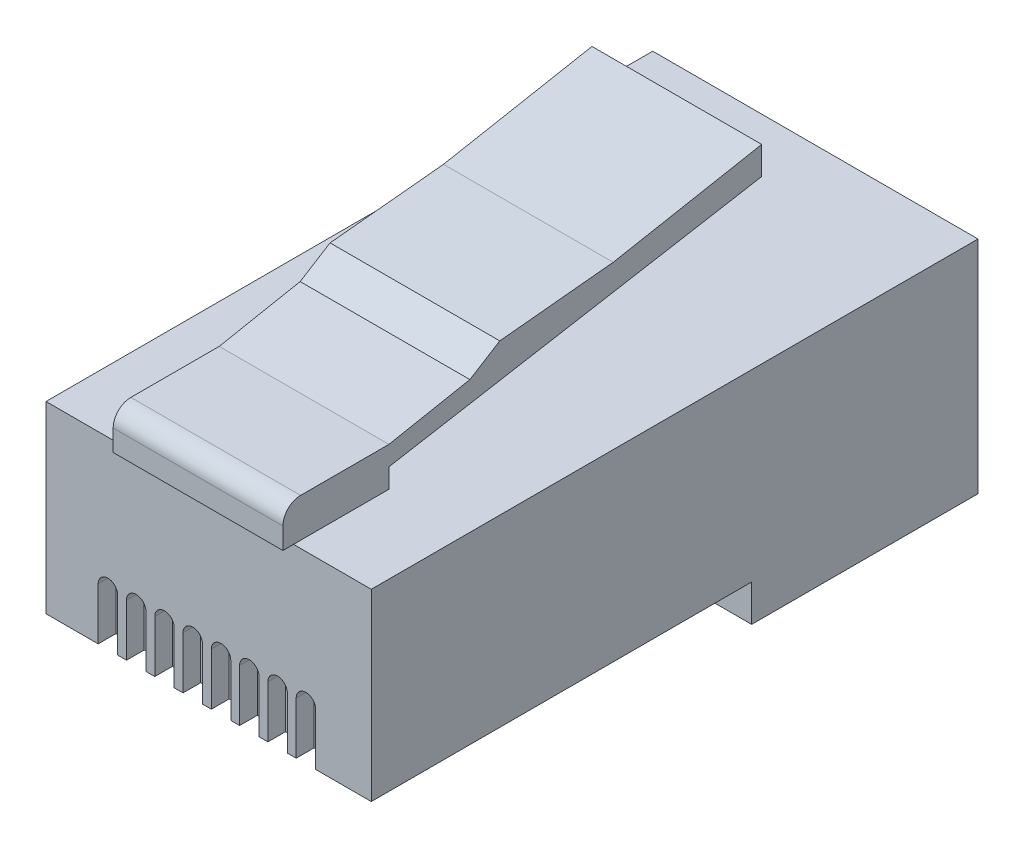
ISO-10303-21;
HEADER;
FILE_DESCRIPTION(('STEP AP214'),'2;1');
FILE_NAME('part.step','',(''),(''),'','','');
FILE_SCHEMA(('AUTOMOTIVE_DESIGN { 1 0 10303 214 1 1 1 1 }'));
ENDSEC;
DATA;
#1=APPLICATION_CONTEXT('core data for automotive mechanical design processes');
#2=APPLICATION_PROTOCOL_DEFINITION('international standard','automotive_design',2000,#1);
#3=PRODUCT_CONTEXT('',#1,'mechanical');
#4=PRODUCT('Part','Part','',(#3));
#5=PRODUCT_RELATED_PRODUCT_CATEGORY('part','',(#4));
#6=PRODUCT_DEFINITION_FORMATION('','',#4);
#7=PRODUCT_DEFINITION_CONTEXT('part definition',#1,'design');
#8=PRODUCT_DEFINITION('design','',#6,#7);
#9=PRODUCT_DEFINITION_SHAPE('','',#8);
#10=(LENGTH_UNIT() NAMED_UNIT(*) SI_UNIT(.MILLI.,.METRE.));
#11=(NAMED_UNIT(*) PLANE_ANGLE_UNIT() SI_UNIT($,.RADIAN.));
#12=(NAMED_UNIT(*) SI_UNIT($,.STERADIAN.) SOLID_ANGLE_UNIT());
#13=UNCERTAINTY_MEASURE_WITH_UNIT(LENGTH_MEASURE(1.E-05),#10,'distance_accuracy_value','');
#14=(GEOMETRIC_REPRESENTATION_CONTEXT(3) GLOBAL_UNCERTAINTY_ASSIGNED_CONTEXT((#13)) GLOBAL_UNIT_ASSIGNED_CONTEXT((#10,
#11,#12)) REPRESENTATION_CONTEXT('',''));
#15=CARTESIAN_POINT('',(0.,0.,0.));
#16=DIRECTION('',(0.,0.,1.));
#17=DIRECTION('',(1.,0.,0.));
#18=AXIS2_PLACEMENT_3D('',#15,#16,#17);
#19=CARTESIAN_POINT('',(-3.61823,-1.43002,17.4752));
#20=DIRECTION('',(0.,0.,1.));
#21=DIRECTION('',(1.,0.,0.));
#22=AXIS2_PLACEMENT_3D('',#19,#20,#21);
#23=CYLINDRICAL_SURFACE('',#22,0.34925);
#24=DIRECTION('',(0.,0.,-1.));
#25=VECTOR('',#24,1.);
#26=CARTESIAN_POINT('',(-3.84048,-1.16061231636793,23.9340828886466));
#27=LINE('',#26,#25);
#28=CARTESIAN_POINT('',(-3.84048,-1.16061231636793,21.2852));
#29=VERTEX_POINT('',#28);
#30=CARTESIAN_POINT('',(-3.84048,-1.16061231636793,17.4752));
#31=VERTEX_POINT('',#30);
#32=EDGE_CURVE('E812',#29,#31,#27,.T.);
#33=ORIENTED_EDGE('',*,*,#32,.F.);
#34=CARTESIAN_POINT('',(-3.61823,-1.43002,21.2852));
#35=DIRECTION('',(0.,0.,1.));
#36=DIRECTION('',(1.,0.,0.));
#37=AXIS2_PLACEMENT_3D('',#34,#35,#36);
#38=CIRCLE('',#37,0.34925);
#39=CARTESIAN_POINT('',(-3.39597999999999,-1.16061231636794,21.2852));
#40=VERTEX_POINT('',#39);
#41=EDGE_CURVE('E845',#40,#29,#38,.T.);
#42=ORIENTED_EDGE('',*,*,#41,.F.);
#43=DIRECTION('',(0.,0.,-1.));
#44=VECTOR('',#43,1.);
#45=CARTESIAN_POINT('',(-3.39597999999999,-1.16061231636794,23.9340828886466));
#46=LINE('',#45,#44);
#47=CARTESIAN_POINT('',(-3.39597999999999,-1.16061231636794,17.4752));
#48=VERTEX_POINT('',#47);
#49=EDGE_CURVE('E826',#40,#48,#46,.T.);
#50=ORIENTED_EDGE('',*,*,#49,.T.);
#51=CARTESIAN_POINT('',(-3.61823,-1.43002,17.4752));
#52=DIRECTION('',(0.,0.,1.));
#53=DIRECTION('',(-1.,0.,0.));
#54=AXIS2_PLACEMENT_3D('',#51,#52,#53);
#55=CIRCLE('',#54,0.34925);
#56=CARTESIAN_POINT('',(-3.26898,-1.43002,17.4752));
#57=VERTEX_POINT('',#56);
#58=EDGE_CURVE('E1068',#57,#48,#55,.T.);
#59=ORIENTED_EDGE('',*,*,#58,.F.);
#60=DIRECTION('',(0.,0.,1.));
#61=VECTOR('',#60,1.);
#62=CARTESIAN_POINT('',(-3.26898,-1.43002,17.4752));
#63=LINE('',#62,#61);
#64=CARTESIAN_POINT('',(-3.26898,-1.43002,21.7932));
#65=VERTEX_POINT('',#64);
#66=EDGE_CURVE('E1080',#57,#65,#63,.T.);
#67=ORIENTED_EDGE('',*,*,#66,.T.);
#68=CARTESIAN_POINT('',(-3.61823,-1.43002,21.7932));
#69=DIRECTION('',(0.,0.,1.));
#70=DIRECTION('',(-1.,0.,0.));
#71=AXIS2_PLACEMENT_3D('',#68,#69,#70);
#72=CIRCLE('',#71,0.34925);
#73=CARTESIAN_POINT('',(-3.96748,-1.43002,21.7932));
#74=VERTEX_POINT('',#73);
#75=EDGE_CURVE('E1056',#65,#74,#72,.T.);
#76=ORIENTED_EDGE('',*,*,#75,.T.);
#77=DIRECTION('',(0.,0.,1.));
#78=VECTOR('',#77,1.);
#79=CARTESIAN_POINT('',(-3.96748,-1.43002,17.4752));
#80=LINE('',#79,#78);
#81=CARTESIAN_POINT('',(-3.96748,-1.43002,17.4752));
#82=VERTEX_POINT('',#81);
#83=EDGE_CURVE('E1078',#82,#74,#80,.T.);
#84=ORIENTED_EDGE('',*,*,#83,.F.);
#85=EDGE_CURVE('E1067',#31,#82,#55,.T.);
#86=ORIENTED_EDGE('',*,*,#85,.F.);
#87=EDGE_LOOP('',(#33,#42,#50,#59,#67,#76,#84,#86));
#88=FACE_BOUND('',#87,.T.);
#89=ADVANCED_FACE('F40',(#88),#23,.F.);
#90=CARTESIAN_POINT('',(-3.61823,-1.43002,17.4752));
#91=DIRECTION('',(0.,0.,-1.));
#92=DIRECTION('',(-1.,0.,0.));
#93=AXIS2_PLACEMENT_3D('',#90,#91,#92);
#94=PLANE('',#93);
#95=DIRECTION('',(0.,-1.,0.));
#96=VECTOR('',#95,1.);
#97=CARTESIAN_POINT('',(-3.84048,-3.175,17.4752));
#98=LINE('',#97,#96);
#99=CARTESIAN_POINT('',(-3.84048,-3.175,17.4752));
#100=VERTEX_POINT('',#99);
#101=EDGE_CURVE('E832',#31,#100,#98,.T.);
#102=ORIENTED_EDGE('',*,*,#101,.F.);
#103=ORIENTED_EDGE('',*,*,#85,.T.);
#104=DIRECTION('',(0.,-1.,0.));
#105=VECTOR('',#104,1.);
#106=CARTESIAN_POINT('',(-3.96747999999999,-3.302,17.4752));
#107=LINE('',#106,#105);
#108=CARTESIAN_POINT('',(-3.96747999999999,-3.302,17.4752));
#109=VERTEX_POINT('',#108);
#110=EDGE_CURVE('E1070',#82,#109,#107,.T.);
#111=ORIENTED_EDGE('',*,*,#110,.T.);
#112=DIRECTION('',(1.,0.,0.));
#113=VECTOR('',#112,1.);
#114=CARTESIAN_POINT('',(-3.96747999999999,-3.302,17.4752));
#115=LINE('',#114,#113);
#116=CARTESIAN_POINT('',(-3.26897999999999,-3.302,17.4752));
#117=VERTEX_POINT('',#116);
#118=EDGE_CURVE('E1061',#109,#117,#115,.T.);
#119=ORIENTED_EDGE('',*,*,#118,.T.);
#120=DIRECTION('',(0.,1.,0.));
#121=VECTOR('',#120,1.);
#122=CARTESIAN_POINT('',(-3.26898,-1.43002,17.4752));
#123=LINE('',#122,#121);
#124=EDGE_CURVE('E1064',#117,#57,#123,.T.);
#125=ORIENTED_EDGE('',*,*,#124,.T.);
#126=ORIENTED_EDGE('',*,*,#58,.T.);
#127=DIRECTION('',(0.,1.,0.));
#128=VECTOR('',#127,1.);
#129=CARTESIAN_POINT('',(-3.39597999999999,-3.175,17.4752));
#130=LINE('',#129,#128);
#131=CARTESIAN_POINT('',(-3.39597999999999,-3.175,17.4752));
#132=VERTEX_POINT('',#131);
#133=EDGE_CURVE('E823',#132,#48,#130,.T.);
#134=ORIENTED_EDGE('',*,*,#133,.F.);
#135=DIRECTION('',(1.,0.,0.));
#136=VECTOR('',#135,1.);
#137=CARTESIAN_POINT('',(-3.84048,-3.175,17.4752));
#138=LINE('',#137,#136);
#139=EDGE_CURVE('E828',#100,#132,#138,.T.);
#140=ORIENTED_EDGE('',*,*,#139,.F.);
#141=EDGE_LOOP('',(#102,#103,#111,#119,#125,#126,#134,#140));
#142=FACE_BOUND('',#141,.T.);
#143=ADVANCED_FACE('F1516',(#142),#94,.F.);
#144=CARTESIAN_POINT('',(-2.60223,-1.43002000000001,17.4752));
#145=DIRECTION('',(0.,0.,1.));
#146=DIRECTION('',(1.,0.,0.));
#147=AXIS2_PLACEMENT_3D('',#144,#145,#146);
#148=CYLINDRICAL_SURFACE('',#147,0.34925);
#149=DIRECTION('',(0.,0.,-1.));
#150=VECTOR('',#149,1.);
#151=CARTESIAN_POINT('',(-2.82448,-1.16061231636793,23.9340828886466));
#152=LINE('',#151,#150);
#153=CARTESIAN_POINT('',(-2.82448,-1.16061231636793,21.2852));
#154=VERTEX_POINT('',#153);
#155=CARTESIAN_POINT('',(-2.82448,-1.16061231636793,17.4752));
#156=VERTEX_POINT('',#155);
#157=EDGE_CURVE('E838',#154,#156,#152,.T.);
#158=ORIENTED_EDGE('',*,*,#157,.F.);
#159=CARTESIAN_POINT('',(-2.60223,-1.43002000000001,21.2852));
#160=DIRECTION('',(0.,0.,1.));
#161=DIRECTION('',(1.,0.,0.));
#162=AXIS2_PLACEMENT_3D('',#159,#160,#161);
#163=CIRCLE('',#162,0.34925);
#164=CARTESIAN_POINT('',(-2.37997999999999,-1.16061231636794,21.2852));
#165=VERTEX_POINT('',#164);
#166=EDGE_CURVE('E878',#165,#154,#163,.T.);
#167=ORIENTED_EDGE('',*,*,#166,.F.);
#168=DIRECTION('',(0.,0.,-1.));
#169=VECTOR('',#168,1.);
#170=CARTESIAN_POINT('',(-2.37997999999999,-1.16061231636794,23.9340828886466));
#171=LINE('',#170,#169);
#172=CARTESIAN_POINT('',(-2.37997999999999,-1.16061231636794,17.4752));
#173=VERTEX_POINT('',#172);
#174=EDGE_CURVE('E859',#165,#173,#171,.T.);
#175=ORIENTED_EDGE('',*,*,#174,.T.);
#176=CARTESIAN_POINT('',(-2.60223,-1.43002000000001,17.4752));
#177=DIRECTION('',(0.,0.,1.));
#178=DIRECTION('',(-1.,0.,0.));
#179=AXIS2_PLACEMENT_3D('',#176,#177,#178);
#180=CIRCLE('',#179,0.34925);
#181=CARTESIAN_POINT('',(-2.25298,-1.43002000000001,17.4752));
#182=VERTEX_POINT('',#181);
#183=EDGE_CURVE('E1098',#182,#173,#180,.T.);
#184=ORIENTED_EDGE('',*,*,#183,.F.);
#185=DIRECTION('',(0.,0.,1.));
#186=VECTOR('',#185,1.);
#187=CARTESIAN_POINT('',(-2.25298,-1.43002000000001,17.4752));
#188=LINE('',#187,#186);
#189=CARTESIAN_POINT('',(-2.25298,-1.43002000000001,21.7932));
#190=VERTEX_POINT('',#189);
#191=EDGE_CURVE('E1110',#182,#190,#188,.T.);
#192=ORIENTED_EDGE('',*,*,#191,.T.);
#193=CARTESIAN_POINT('',(-2.60223,-1.43002000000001,21.7932));
#194=DIRECTION('',(0.,0.,1.));
#195=DIRECTION('',(-1.,0.,0.));
#196=AXIS2_PLACEMENT_3D('',#193,#194,#195);
#197=CIRCLE('',#196,0.34925);
#198=CARTESIAN_POINT('',(-2.95148,-1.43002000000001,21.7932));
#199=VERTEX_POINT('',#198);
#200=EDGE_CURVE('E1085',#190,#199,#197,.T.);
#201=ORIENTED_EDGE('',*,*,#200,.T.);
#202=DIRECTION('',(0.,0.,1.));
#203=VECTOR('',#202,1.);
#204=CARTESIAN_POINT('',(-2.95148,-1.43002000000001,17.4752));
#205=LINE('',#204,#203);
#206=CARTESIAN_POINT('',(-2.95148,-1.43002000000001,17.4752));
#207=VERTEX_POINT('',#206);
#208=EDGE_CURVE('E1108',#207,#199,#205,.T.);
#209=ORIENTED_EDGE('',*,*,#208,.F.);
#210=EDGE_CURVE('E1097',#156,#207,#180,.T.);
#211=ORIENTED_EDGE('',*,*,#210,.F.);
#212=EDGE_LOOP('',(#158,#167,#175,#184,#192,#201,#209,#211));
#213=FACE_BOUND('',#212,.T.);
#214=ADVANCED_FACE('F1522',(#213),#148,.F.);
#215=CARTESIAN_POINT('',(-2.60223,-1.43002000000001,17.4752));
#216=DIRECTION('',(0.,0.,-1.));
#217=DIRECTION('',(-1.,0.,0.));
#218=AXIS2_PLACEMENT_3D('',#215,#216,#217);
#219=PLANE('',#218);
#220=DIRECTION('',(0.,-1.,0.));
#221=VECTOR('',#220,1.);
#222=CARTESIAN_POINT('',(-2.82448,-3.175,17.4752));
#223=LINE('',#222,#221);
#224=CARTESIAN_POINT('',(-2.82448,-3.175,17.4752));
#225=VERTEX_POINT('',#224);
#226=EDGE_CURVE('E865',#156,#225,#223,.T.);
#227=ORIENTED_EDGE('',*,*,#226,.F.);
#228=ORIENTED_EDGE('',*,*,#210,.T.);
#229=DIRECTION('',(0.,-1.,0.));
#230=VECTOR('',#229,1.);
#231=CARTESIAN_POINT('',(-2.95147999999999,-3.302,17.4752));
#232=LINE('',#231,#230);
#233=CARTESIAN_POINT('',(-2.95147999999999,-3.302,17.4752));
#234=VERTEX_POINT('',#233);
#235=EDGE_CURVE('E1100',#207,#234,#232,.T.);
#236=ORIENTED_EDGE('',*,*,#235,.T.);
#237=DIRECTION('',(1.,0.,0.));
#238=VECTOR('',#237,1.);
#239=CARTESIAN_POINT('',(-2.95147999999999,-3.302,17.4752));
#240=LINE('',#239,#238);
#241=CARTESIAN_POINT('',(-2.25297999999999,-3.302,17.4752));
#242=VERTEX_POINT('',#241);
#243=EDGE_CURVE('E1091',#234,#242,#240,.T.);
#244=ORIENTED_EDGE('',*,*,#243,.T.);
#245=DIRECTION('',(0.,1.,0.));
#246=VECTOR('',#245,1.);
#247=CARTESIAN_POINT('',(-2.25298,-1.43002000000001,17.4752));
#248=LINE('',#247,#246);
#249=EDGE_CURVE('E1094',#242,#182,#248,.T.);
#250=ORIENTED_EDGE('',*,*,#249,.T.);
#251=ORIENTED_EDGE('',*,*,#183,.T.);
#252=DIRECTION('',(0.,1.,0.));
#253=VECTOR('',#252,1.);
#254=CARTESIAN_POINT('',(-2.37997999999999,-3.175,17.4752));
#255=LINE('',#254,#253);
#256=CARTESIAN_POINT('',(-2.37997999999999,-3.175,17.4752));
#257=VERTEX_POINT('',#256);
#258=EDGE_CURVE('E856',#257,#173,#255,.T.);
#259=ORIENTED_EDGE('',*,*,#258,.F.);
#260=DIRECTION('',(1.,0.,0.));
#261=VECTOR('',#260,1.);
#262=CARTESIAN_POINT('',(-2.82448,-3.175,17.4752));
#263=LINE('',#262,#261);
#264=EDGE_CURVE('E861',#225,#257,#263,.T.);
#265=ORIENTED_EDGE('',*,*,#264,.F.);
#266=EDGE_LOOP('',(#227,#228,#236,#244,#250,#251,#259,#265));
#267=FACE_BOUND('',#266,.T.);
#268=ADVANCED_FACE('F1533',(#267),#219,.F.);
#269=CARTESIAN_POINT('',(-1.58623,-1.43002000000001,17.4752));
#270=DIRECTION('',(0.,0.,1.));
#271=DIRECTION('',(1.,0.,0.));
#272=AXIS2_PLACEMENT_3D('',#269,#270,#271);
#273=CYLINDRICAL_SURFACE('',#272,0.34925);
#274=DIRECTION('',(0.,0.,-1.));
#275=VECTOR('',#274,1.);
#276=CARTESIAN_POINT('',(-1.80848,-1.16061231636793,23.9340828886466));
#277=LINE('',#276,#275);
#278=CARTESIAN_POINT('',(-1.80848,-1.16061231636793,21.2852));
#279=VERTEX_POINT('',#278);
#280=CARTESIAN_POINT('',(-1.80848,-1.16061231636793,17.4752));
#281=VERTEX_POINT('',#280);
#282=EDGE_CURVE('E871',#279,#281,#277,.T.);
#283=ORIENTED_EDGE('',*,*,#282,.F.);
#284=CARTESIAN_POINT('',(-1.58623,-1.43002000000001,21.2852));
#285=DIRECTION('',(0.,0.,1.));
#286=DIRECTION('',(1.,0.,0.));
#287=AXIS2_PLACEMENT_3D('',#284,#285,#286);
#288=CIRCLE('',#287,0.34925);
#289=CARTESIAN_POINT('',(-1.36397999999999,-1.16061231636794,21.2852));
#290=VERTEX_POINT('',#289);
#291=EDGE_CURVE('E911',#290,#279,#288,.T.);
#292=ORIENTED_EDGE('',*,*,#291,.F.);
#293=DIRECTION('',(0.,0.,-1.));
#294=VECTOR('',#293,1.);
#295=CARTESIAN_POINT('',(-1.36397999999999,-1.16061231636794,23.9340828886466));
#296=LINE('',#295,#294);
#297=CARTESIAN_POINT('',(-1.36397999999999,-1.16061231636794,17.4752));
#298=VERTEX_POINT('',#297);
#299=EDGE_CURVE('E892',#290,#298,#296,.T.);
#300=ORIENTED_EDGE('',*,*,#299,.T.);
#301=CARTESIAN_POINT('',(-1.58623,-1.43002000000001,17.4752));
#302=DIRECTION('',(0.,0.,1.));
#303=DIRECTION('',(-1.,0.,0.));
#304=AXIS2_PLACEMENT_3D('',#301,#302,#303);
#305=CIRCLE('',#304,0.34925);
#306=CARTESIAN_POINT('',(-1.23698,-1.43002000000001,17.4752));
#307=VERTEX_POINT('',#306);
#308=EDGE_CURVE('E1128',#307,#298,#305,.T.);
#309=ORIENTED_EDGE('',*,*,#308,.F.);
#310=DIRECTION('',(0.,0.,1.));
#311=VECTOR('',#310,1.);
#312=CARTESIAN_POINT('',(-1.23698,-1.43002000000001,17.4752));
#313=LINE('',#312,#311);
#314=CARTESIAN_POINT('',(-1.23698,-1.43002000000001,21.7932));
#315=VERTEX_POINT('',#314);
#316=EDGE_CURVE('E1140',#307,#315,#313,.T.);
#317=ORIENTED_EDGE('',*,*,#316,.T.);
#318=CARTESIAN_POINT('',(-1.58623,-1.43002000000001,21.7932));
#319=DIRECTION('',(0.,0.,1.));
#320=DIRECTION('',(-1.,0.,0.));
#321=AXIS2_PLACEMENT_3D('',#318,#319,#320);
#322=CIRCLE('',#321,0.34925);
#323=CARTESIAN_POINT('',(-1.93548,-1.43002000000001,21.7932));
#324=VERTEX_POINT('',#323);
#325=EDGE_CURVE('E1115',#315,#324,#322,.T.);
#326=ORIENTED_EDGE('',*,*,#325,.T.);
#327=DIRECTION('',(0.,0.,1.));
#328=VECTOR('',#327,1.);
#329=CARTESIAN_POINT('',(-1.93548,-1.43002000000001,17.4752));
#330=LINE('',#329,#328);
#331=CARTESIAN_POINT('',(-1.93548,-1.43002000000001,17.4752));
#332=VERTEX_POINT('',#331);
#333=EDGE_CURVE('E1138',#332,#324,#330,.T.);
#334=ORIENTED_EDGE('',*,*,#333,.F.);
#335=EDGE_CURVE('E1127',#281,#332,#305,.T.);
#336=ORIENTED_EDGE('',*,*,#335,.F.);
#337=EDGE_LOOP('',(#283,#292,#300,#309,#317,#326,#334,#336));
#338=FACE_BOUND('',#337,.T.);
#339=ADVANCED_FACE('F1536',(#338),#273,.F.);
#340=CARTESIAN_POINT('',(-1.58623,-1.43002000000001,17.4752));
#341=DIRECTION('',(0.,0.,-1.));
#342=DIRECTION('',(-1.,0.,0.));
#343=AXIS2_PLACEMENT_3D('',#340,#341,#342);
#344=PLANE('',#343);
#345=DIRECTION('',(0.,-1.,0.));
#346=VECTOR('',#345,1.);
#347=CARTESIAN_POINT('',(-1.80848,-3.175,17.4752));
#348=LINE('',#347,#346);
#349=CARTESIAN_POINT('',(-1.80848,-3.175,17.4752));
#350=VERTEX_POINT('',#349);
#351=EDGE_CURVE('E898',#281,#350,#348,.T.);
#352=ORIENTED_EDGE('',*,*,#351,.F.);
#353=ORIENTED_EDGE('',*,*,#335,.T.);
#354=DIRECTION('',(0.,-1.,0.));
#355=VECTOR('',#354,1.);
#356=CARTESIAN_POINT('',(-1.93547999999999,-3.302,17.4752));
#357=LINE('',#356,#355);
#358=CARTESIAN_POINT('',(-1.93547999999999,-3.302,17.4752));
#359=VERTEX_POINT('',#358);
#360=EDGE_CURVE('E1130',#332,#359,#357,.T.);
#361=ORIENTED_EDGE('',*,*,#360,.T.);
#362=DIRECTION('',(1.,0.,0.));
#363=VECTOR('',#362,1.);
#364=CARTESIAN_POINT('',(-1.93547999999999,-3.302,17.4752));
#365=LINE('',#364,#363);
#366=CARTESIAN_POINT('',(-1.23697999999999,-3.302,17.4752));
#367=VERTEX_POINT('',#366);
#368=EDGE_CURVE('E1121',#359,#367,#365,.T.);
#369=ORIENTED_EDGE('',*,*,#368,.T.);
#370=DIRECTION('',(0.,1.,0.));
#371=VECTOR('',#370,1.);
#372=CARTESIAN_POINT('',(-1.23698,-1.43002000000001,17.4752));
#373=LINE('',#372,#371);
#374=EDGE_CURVE('E1124',#367,#307,#373,.T.);
#375=ORIENTED_EDGE('',*,*,#374,.T.);
#376=ORIENTED_EDGE('',*,*,#308,.T.);
#377=DIRECTION('',(0.,1.,0.));
#378=VECTOR('',#377,1.);
#379=CARTESIAN_POINT('',(-1.36397999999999,-3.175,17.4752));
#380=LINE('',#379,#378);
#381=CARTESIAN_POINT('',(-1.36397999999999,-3.175,17.4752));
#382=VERTEX_POINT('',#381);
#383=EDGE_CURVE('E889',#382,#298,#380,.T.);
#384=ORIENTED_EDGE('',*,*,#383,.F.);
#385=DIRECTION('',(1.,0.,0.));
#386=VECTOR('',#385,1.);
#387=CARTESIAN_POINT('',(-1.80848,-3.175,17.4752));
#388=LINE('',#387,#386);
#389=EDGE_CURVE('E894',#350,#382,#388,.T.);
#390=ORIENTED_EDGE('',*,*,#389,.F.);
#391=EDGE_LOOP('',(#352,#353,#361,#369,#375,#376,#384,#390));
#392=FACE_BOUND('',#391,.T.);
#393=ADVANCED_FACE('F1550',(#392),#344,.F.);
#394=CARTESIAN_POINT('',(-0.57023,-1.43002000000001,17.4752));
#395=DIRECTION('',(0.,0.,1.));
#396=DIRECTION('',(1.,0.,0.));
#397=AXIS2_PLACEMENT_3D('',#394,#395,#396);
#398=CYLINDRICAL_SURFACE('',#397,0.34925);
#399=DIRECTION('',(0.,0.,-1.));
#400=VECTOR('',#399,1.);
#401=CARTESIAN_POINT('',(-0.79248,-1.16061231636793,23.9340828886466));
#402=LINE('',#401,#400);
#403=CARTESIAN_POINT('',(-0.79248,-1.16061231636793,21.2852));
#404=VERTEX_POINT('',#403);
#405=CARTESIAN_POINT('',(-0.79248,-1.16061231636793,17.4752));
#406=VERTEX_POINT('',#405);
#407=EDGE_CURVE('E904',#404,#406,#402,.T.);
#408=ORIENTED_EDGE('',*,*,#407,.F.);
#409=CARTESIAN_POINT('',(-0.57023,-1.43002000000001,21.2852));
#410=DIRECTION('',(0.,0.,1.));
#411=DIRECTION('',(1.,0.,0.));
#412=AXIS2_PLACEMENT_3D('',#409,#410,#411);
#413=CIRCLE('',#412,0.34925);
#414=CARTESIAN_POINT('',(-0.347979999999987,-1.16061231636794,21.2852));
#415=VERTEX_POINT('',#414);
#416=EDGE_CURVE('E944',#415,#404,#413,.T.);
#417=ORIENTED_EDGE('',*,*,#416,.F.);
#418=DIRECTION('',(0.,0.,-1.));
#419=VECTOR('',#418,1.);
#420=CARTESIAN_POINT('',(-0.347979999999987,-1.16061231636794,23.9340828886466));
#421=LINE('',#420,#419);
#422=CARTESIAN_POINT('',(-0.347979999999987,-1.16061231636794,17.4752));
#423=VERTEX_POINT('',#422);
#424=EDGE_CURVE('E925',#415,#423,#421,.T.);
#425=ORIENTED_EDGE('',*,*,#424,.T.);
#426=CARTESIAN_POINT('',(-0.57023,-1.43002000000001,17.4752));
#427=DIRECTION('',(0.,0.,1.));
#428=DIRECTION('',(-1.,0.,0.));
#429=AXIS2_PLACEMENT_3D('',#426,#427,#428);
#430=CIRCLE('',#429,0.34925);
#431=CARTESIAN_POINT('',(-0.22098,-1.43002000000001,17.4752));
#432=VERTEX_POINT('',#431);
#433=EDGE_CURVE('E1158',#432,#423,#430,.T.);
#434=ORIENTED_EDGE('',*,*,#433,.F.);
#435=DIRECTION('',(0.,0.,1.));
#436=VECTOR('',#435,1.);
#437=CARTESIAN_POINT('',(-0.22098,-1.43002000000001,17.4752));
#438=LINE('',#437,#436);
#439=CARTESIAN_POINT('',(-0.22098,-1.43002000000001,21.7932));
#440=VERTEX_POINT('',#439);
#441=EDGE_CURVE('E1170',#432,#440,#438,.T.);
#442=ORIENTED_EDGE('',*,*,#441,.T.);
#443=CARTESIAN_POINT('',(-0.57023,-1.43002000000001,21.7932));
#444=DIRECTION('',(0.,0.,1.));
#445=DIRECTION('',(-1.,0.,0.));
#446=AXIS2_PLACEMENT_3D('',#443,#444,#445);
#447=CIRCLE('',#446,0.34925);
#448=CARTESIAN_POINT('',(-0.919479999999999,-1.43002000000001,21.7932));
#449=VERTEX_POINT('',#448);
#450=EDGE_CURVE('E1145',#440,#449,#447,.T.);
#451=ORIENTED_EDGE('',*,*,#450,.T.);
#452=DIRECTION('',(0.,0.,1.));
#453=VECTOR('',#452,1.);
#454=CARTESIAN_POINT('',(-0.919479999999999,-1.43002000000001,17.4752));
#455=LINE('',#454,#453);
#456=CARTESIAN_POINT('',(-0.919479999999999,-1.43002000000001,17.4752));
#457=VERTEX_POINT('',#456);
#458=EDGE_CURVE('E1168',#457,#449,#455,.T.);
#459=ORIENTED_EDGE('',*,*,#458,.F.);
#460=EDGE_CURVE('E1157',#406,#457,#430,.T.);
#461=ORIENTED_EDGE('',*,*,#460,.F.);
#462=EDGE_LOOP('',(#408,#417,#425,#434,#442,#451,#459,#461));
#463=FACE_BOUND('',#462,.T.);
#464=ADVANCED_FACE('F1553',(#463),#398,.F.);
#465=CARTESIAN_POINT('',(-0.57023,-1.43002000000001,17.4752));
#466=DIRECTION('',(0.,0.,-1.));
#467=DIRECTION('',(-1.,0.,0.));
#468=AXIS2_PLACEMENT_3D('',#465,#466,#467);
#469=PLANE('',#468);
#470=DIRECTION('',(0.,-1.,0.));
#471=VECTOR('',#470,1.);
#472=CARTESIAN_POINT('',(-0.79248,-3.175,17.4752));
#473=LINE('',#472,#471);
#474=CARTESIAN_POINT('',(-0.79248,-3.175,17.4752));
#475=VERTEX_POINT('',#474);
#476=EDGE_CURVE('E931',#406,#475,#473,.T.);
#477=ORIENTED_EDGE('',*,*,#476,.F.);
#478=ORIENTED_EDGE('',*,*,#460,.T.);
#479=DIRECTION('',(0.,-1.,0.));
#480=VECTOR('',#479,1.);
#481=CARTESIAN_POINT('',(-0.919479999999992,-3.302,17.4752));
#482=LINE('',#481,#480);
#483=CARTESIAN_POINT('',(-0.919479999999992,-3.302,17.4752));
#484=VERTEX_POINT('',#483);
#485=EDGE_CURVE('E1160',#457,#484,#482,.T.);
#486=ORIENTED_EDGE('',*,*,#485,.T.);
#487=DIRECTION('',(1.,0.,0.));
#488=VECTOR('',#487,1.);
#489=CARTESIAN_POINT('',(-0.919479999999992,-3.302,17.4752));
#490=LINE('',#489,#488);
#491=CARTESIAN_POINT('',(-0.220979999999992,-3.302,17.4752));
#492=VERTEX_POINT('',#491);
#493=EDGE_CURVE('E1151',#484,#492,#490,.T.);
#494=ORIENTED_EDGE('',*,*,#493,.T.);
#495=DIRECTION('',(0.,1.,0.));
#496=VECTOR('',#495,1.);
#497=CARTESIAN_POINT('',(-0.22098,-1.43002000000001,17.4752));
#498=LINE('',#497,#496);
#499=EDGE_CURVE('E1154',#492,#432,#498,.T.);
#500=ORIENTED_EDGE('',*,*,#499,.T.);
#501=ORIENTED_EDGE('',*,*,#433,.T.);
#502=DIRECTION('',(0.,1.,0.));
#503=VECTOR('',#502,1.);
#504=CARTESIAN_POINT('',(-0.347979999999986,-3.175,17.4752));
#505=LINE('',#504,#503);
#506=CARTESIAN_POINT('',(-0.347979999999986,-3.175,17.4752));
#507=VERTEX_POINT('',#506);
#508=EDGE_CURVE('E922',#507,#423,#505,.T.);
#509=ORIENTED_EDGE('',*,*,#508,.F.);
#510=DIRECTION('',(1.,0.,0.));
#511=VECTOR('',#510,1.);
#512=CARTESIAN_POINT('',(-0.79248,-3.175,17.4752));
#513=LINE('',#512,#511);
#514=EDGE_CURVE('E927',#475,#507,#513,.T.);
#515=ORIENTED_EDGE('',*,*,#514,.F.);
#516=EDGE_LOOP('',(#477,#478,#486,#494,#500,#501,#509,#515));
#517=FACE_BOUND('',#516,.T.);
#518=ADVANCED_FACE('F1566',(#517),#469,.F.);
#519=CARTESIAN_POINT('',(0.44577,-1.43002000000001,17.4752));
#520=DIRECTION('',(0.,0.,1.));
#521=DIRECTION('',(1.,0.,0.));
#522=AXIS2_PLACEMENT_3D('',#519,#520,#521);
#523=CYLINDRICAL_SURFACE('',#522,0.34925);
#524=DIRECTION('',(0.,0.,-1.));
#525=VECTOR('',#524,1.);
#526=CARTESIAN_POINT('',(0.22352,-1.16061231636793,23.9340828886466));
#527=LINE('',#526,#525);
#528=CARTESIAN_POINT('',(0.22352,-1.16061231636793,21.2852));
#529=VERTEX_POINT('',#528);
#530=CARTESIAN_POINT('',(0.22352,-1.16061231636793,17.4752));
#531=VERTEX_POINT('',#530);
#532=EDGE_CURVE('E937',#529,#531,#527,.T.);
#533=ORIENTED_EDGE('',*,*,#532,.F.);
#534=CARTESIAN_POINT('',(0.44577,-1.43002000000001,21.2852));
#535=DIRECTION('',(0.,0.,1.));
#536=DIRECTION('',(1.,0.,0.));
#537=AXIS2_PLACEMENT_3D('',#534,#535,#536);
#538=CIRCLE('',#537,0.34925);
#539=CARTESIAN_POINT('',(0.668020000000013,-1.16061231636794,21.2852));
#540=VERTEX_POINT('',#539);
#541=EDGE_CURVE('E977',#540,#529,#538,.T.);
#542=ORIENTED_EDGE('',*,*,#541,.F.);
#543=DIRECTION('',(0.,0.,-1.));
#544=VECTOR('',#543,1.);
#545=CARTESIAN_POINT('',(0.668020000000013,-1.16061231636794,23.9340828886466));
#546=LINE('',#545,#544);
#547=CARTESIAN_POINT('',(0.668020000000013,-1.16061231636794,17.4752));
#548=VERTEX_POINT('',#547);
#549=EDGE_CURVE('E958',#540,#548,#546,.T.);
#550=ORIENTED_EDGE('',*,*,#549,.T.);
#551=CARTESIAN_POINT('',(0.44577,-1.43002000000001,17.4752));
#552=DIRECTION('',(0.,0.,1.));
#553=DIRECTION('',(-1.,0.,0.));
#554=AXIS2_PLACEMENT_3D('',#551,#552,#553);
#555=CIRCLE('',#554,0.34925);
#556=CARTESIAN_POINT('',(0.79502,-1.43002000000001,17.4752));
#557=VERTEX_POINT('',#556);
#558=EDGE_CURVE('E1188',#557,#548,#555,.T.);
#559=ORIENTED_EDGE('',*,*,#558,.F.);
#560=DIRECTION('',(0.,0.,1.));
#561=VECTOR('',#560,1.);
#562=CARTESIAN_POINT('',(0.79502,-1.43002000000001,17.4752));
#563=LINE('',#562,#561);
#564=CARTESIAN_POINT('',(0.79502,-1.43002000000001,21.7932));
#565=VERTEX_POINT('',#564);
#566=EDGE_CURVE('E1200',#557,#565,#563,.T.);
#567=ORIENTED_EDGE('',*,*,#566,.T.);
#568=CARTESIAN_POINT('',(0.44577,-1.43002000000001,21.7932));
#569=DIRECTION('',(0.,0.,1.));
#570=DIRECTION('',(-1.,0.,0.));
#571=AXIS2_PLACEMENT_3D('',#568,#569,#570);
#572=CIRCLE('',#571,0.34925);
#573=CARTESIAN_POINT('',(0.0965200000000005,-1.43002000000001,21.7932));
#574=VERTEX_POINT('',#573);
#575=EDGE_CURVE('E1175',#565,#574,#572,.T.);
#576=ORIENTED_EDGE('',*,*,#575,.T.);
#577=DIRECTION('',(0.,0.,1.));
#578=VECTOR('',#577,1.);
#579=CARTESIAN_POINT('',(0.0965200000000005,-1.43002000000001,17.4752));
#580=LINE('',#579,#578);
#581=CARTESIAN_POINT('',(0.0965200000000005,-1.43002000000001,17.4752));
#582=VERTEX_POINT('',#581);
#583=EDGE_CURVE('E1198',#582,#574,#580,.T.);
#584=ORIENTED_EDGE('',*,*,#583,.F.);
#585=EDGE_CURVE('E1187',#531,#582,#555,.T.);
#586=ORIENTED_EDGE('',*,*,#585,.F.);
#587=EDGE_LOOP('',(#533,#542,#550,#559,#567,#576,#584,#586));
#588=FACE_BOUND('',#587,.T.);
#589=ADVANCED_FACE('F1569',(#588),#523,.F.);
#590=CARTESIAN_POINT('',(0.44577,-1.43002000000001,17.4752));
#591=DIRECTION('',(0.,0.,-1.));
#592=DIRECTION('',(-1.,0.,0.));
#593=AXIS2_PLACEMENT_3D('',#590,#591,#592);
#594=PLANE('',#593);
#595=DIRECTION('',(0.,-1.,0.));
#596=VECTOR('',#595,1.);
#597=CARTESIAN_POINT('',(0.22352,-3.175,17.4752));
#598=LINE('',#597,#596);
#599=CARTESIAN_POINT('',(0.223520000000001,-3.175,17.4752));
#600=VERTEX_POINT('',#599);
#601=EDGE_CURVE('E964',#531,#600,#598,.T.);
#602=ORIENTED_EDGE('',*,*,#601,.F.);
#603=ORIENTED_EDGE('',*,*,#585,.T.);
#604=DIRECTION('',(0.,-1.,0.));
#605=VECTOR('',#604,1.);
#606=CARTESIAN_POINT('',(0.0965200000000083,-3.302,17.4752));
#607=LINE('',#606,#605);
#608=CARTESIAN_POINT('',(0.0965200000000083,-3.302,17.4752));
#609=VERTEX_POINT('',#608);
#610=EDGE_CURVE('E1190',#582,#609,#607,.T.);
#611=ORIENTED_EDGE('',*,*,#610,.T.);
#612=DIRECTION('',(1.,0.,0.));
#613=VECTOR('',#612,1.);
#614=CARTESIAN_POINT('',(0.0965200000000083,-3.302,17.4752));
#615=LINE('',#614,#613);
#616=CARTESIAN_POINT('',(0.795020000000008,-3.302,17.4752));
#617=VERTEX_POINT('',#616);
#618=EDGE_CURVE('E1181',#609,#617,#615,.T.);
#619=ORIENTED_EDGE('',*,*,#618,.T.);
#620=DIRECTION('',(0.,1.,0.));
#621=VECTOR('',#620,1.);
#622=CARTESIAN_POINT('',(0.79502,-1.43002000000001,17.4752));
#623=LINE('',#622,#621);
#624=EDGE_CURVE('E1184',#617,#557,#623,.T.);
#625=ORIENTED_EDGE('',*,*,#624,.T.);
#626=ORIENTED_EDGE('',*,*,#558,.T.);
#627=DIRECTION('',(0.,1.,0.));
#628=VECTOR('',#627,1.);
#629=CARTESIAN_POINT('',(0.668020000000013,-3.175,17.4752));
#630=LINE('',#629,#628);
#631=CARTESIAN_POINT('',(0.668020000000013,-3.175,17.4752));
#632=VERTEX_POINT('',#631);
#633=EDGE_CURVE('E955',#632,#548,#630,.T.);
#634=ORIENTED_EDGE('',*,*,#633,.F.);
#635=DIRECTION('',(1.,0.,0.));
#636=VECTOR('',#635,1.);
#637=CARTESIAN_POINT('',(0.22352,-3.175,17.4752));
#638=LINE('',#637,#636);
#639=EDGE_CURVE('E960',#600,#632,#638,.T.);
#640=ORIENTED_EDGE('',*,*,#639,.F.);
#641=EDGE_LOOP('',(#602,#603,#611,#619,#625,#626,#634,#640));
#642=FACE_BOUND('',#641,.T.);
#643=ADVANCED_FACE('F1582',(#642),#594,.F.);
#644=CARTESIAN_POINT('',(1.46177,-1.43002000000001,17.4752));
#645=DIRECTION('',(0.,0.,1.));
#646=DIRECTION('',(1.,0.,0.));
#647=AXIS2_PLACEMENT_3D('',#644,#645,#646);
#648=CYLINDRICAL_SURFACE('',#647,0.34925);
#649=DIRECTION('',(0.,0.,-1.));
#650=VECTOR('',#649,1.);
#651=CARTESIAN_POINT('',(1.23952,-1.16061231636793,23.9340828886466));
#652=LINE('',#651,#650);
#653=CARTESIAN_POINT('',(1.23952,-1.16061231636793,21.2852));
#654=VERTEX_POINT('',#653);
#655=CARTESIAN_POINT('',(1.23952,-1.16061231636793,17.4752));
#656=VERTEX_POINT('',#655);
#657=EDGE_CURVE('E970',#654,#656,#652,.T.);
#658=ORIENTED_EDGE('',*,*,#657,.F.);
#659=CARTESIAN_POINT('',(1.46177,-1.43002000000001,21.2852));
#660=DIRECTION('',(0.,0.,1.));
#661=DIRECTION('',(1.,0.,0.));
#662=AXIS2_PLACEMENT_3D('',#659,#660,#661);
#663=CIRCLE('',#662,0.34925);
#664=CARTESIAN_POINT('',(1.68402000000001,-1.16061231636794,21.2852));
#665=VERTEX_POINT('',#664);
#666=EDGE_CURVE('E1010',#665,#654,#663,.T.);
#667=ORIENTED_EDGE('',*,*,#666,.F.);
#668=DIRECTION('',(0.,0.,-1.));
#669=VECTOR('',#668,1.);
#670=CARTESIAN_POINT('',(1.68402000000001,-1.16061231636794,23.9340828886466));
#671=LINE('',#670,#669);
#672=CARTESIAN_POINT('',(1.68402000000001,-1.16061231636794,17.4752));
#673=VERTEX_POINT('',#672);
#674=EDGE_CURVE('E991',#665,#673,#671,.T.);
#675=ORIENTED_EDGE('',*,*,#674,.T.);
#676=CARTESIAN_POINT('',(1.46177,-1.43002000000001,17.4752));
#677=DIRECTION('',(0.,0.,1.));
#678=DIRECTION('',(-1.,0.,0.));
#679=AXIS2_PLACEMENT_3D('',#676,#677,#678);
#680=CIRCLE('',#679,0.34925);
#681=CARTESIAN_POINT('',(1.81102,-1.43002000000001,17.4752));
#682=VERTEX_POINT('',#681);
#683=EDGE_CURVE('E1218',#682,#673,#680,.T.);
#684=ORIENTED_EDGE('',*,*,#683,.F.);
#685=DIRECTION('',(0.,0.,1.));
#686=VECTOR('',#685,1.);
#687=CARTESIAN_POINT('',(1.81102,-1.43002000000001,17.4752));
#688=LINE('',#687,#686);
#689=CARTESIAN_POINT('',(1.81102,-1.43002000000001,21.7932));
#690=VERTEX_POINT('',#689);
#691=EDGE_CURVE('E1230',#682,#690,#688,.T.);
#692=ORIENTED_EDGE('',*,*,#691,.T.);
#693=CARTESIAN_POINT('',(1.46177,-1.43002000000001,21.7932));
#694=DIRECTION('',(0.,0.,1.));
#695=DIRECTION('',(-1.,0.,0.));
#696=AXIS2_PLACEMENT_3D('',#693,#694,#695);
#697=CIRCLE('',#696,0.34925);
#698=CARTESIAN_POINT('',(1.11252,-1.43002000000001,21.7932));
#699=VERTEX_POINT('',#698);
#700=EDGE_CURVE('E1205',#690,#699,#697,.T.);
#701=ORIENTED_EDGE('',*,*,#700,.T.);
#702=DIRECTION('',(0.,0.,1.));
#703=VECTOR('',#702,1.);
#704=CARTESIAN_POINT('',(1.11252,-1.43002000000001,17.4752));
#705=LINE('',#704,#703);
#706=CARTESIAN_POINT('',(1.11252,-1.43002000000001,17.4752));
#707=VERTEX_POINT('',#706);
#708=EDGE_CURVE('E1228',#707,#699,#705,.T.);
#709=ORIENTED_EDGE('',*,*,#708,.F.);
#710=EDGE_CURVE('E1217',#656,#707,#680,.T.);
#711=ORIENTED_EDGE('',*,*,#710,.F.);
#712=EDGE_LOOP('',(#658,#667,#675,#684,#692,#701,#709,#711));
#713=FACE_BOUND('',#712,.T.);
#714=ADVANCED_FACE('F1585',(#713),#648,.F.);
#715=CARTESIAN_POINT('',(1.46177,-1.43002000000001,17.4752));
#716=DIRECTION('',(0.,0.,-1.));
#717=DIRECTION('',(-1.,0.,0.));
#718=AXIS2_PLACEMENT_3D('',#715,#716,#717);
#719=PLANE('',#718);
#720=DIRECTION('',(0.,-1.,0.));
#721=VECTOR('',#720,1.);
#722=CARTESIAN_POINT('',(1.23952,-3.17500000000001,17.4752));
#723=LINE('',#722,#721);
#724=CARTESIAN_POINT('',(1.23952,-3.17500000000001,17.4752));
#725=VERTEX_POINT('',#724);
#726=EDGE_CURVE('E997',#656,#725,#723,.T.);
#727=ORIENTED_EDGE('',*,*,#726,.F.);
#728=ORIENTED_EDGE('',*,*,#710,.T.);
#729=DIRECTION('',(0.,-1.,0.));
#730=VECTOR('',#729,1.);
#731=CARTESIAN_POINT('',(1.11252000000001,-3.302,17.4752));
#732=LINE('',#731,#730);
#733=CARTESIAN_POINT('',(1.11252000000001,-3.302,17.4752));
#734=VERTEX_POINT('',#733);
#735=EDGE_CURVE('E1220',#707,#734,#732,.T.);
#736=ORIENTED_EDGE('',*,*,#735,.T.);
#737=DIRECTION('',(1.,0.,0.));
#738=VECTOR('',#737,1.);
#739=CARTESIAN_POINT('',(1.11252000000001,-3.302,17.4752));
#740=LINE('',#739,#738);
#741=CARTESIAN_POINT('',(1.81102000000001,-3.302,17.4752));
#742=VERTEX_POINT('',#741);
#743=EDGE_CURVE('E1211',#734,#742,#740,.T.);
#744=ORIENTED_EDGE('',*,*,#743,.T.);
#745=DIRECTION('',(0.,1.,0.));
#746=VECTOR('',#745,1.);
#747=CARTESIAN_POINT('',(1.81102,-1.43002000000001,17.4752));
#748=LINE('',#747,#746);
#749=EDGE_CURVE('E1214',#742,#682,#748,.T.);
#750=ORIENTED_EDGE('',*,*,#749,.T.);
#751=ORIENTED_EDGE('',*,*,#683,.T.);
#752=DIRECTION('',(0.,1.,0.));
#753=VECTOR('',#752,1.);
#754=CARTESIAN_POINT('',(1.68402000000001,-3.17500000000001,17.4752));
#755=LINE('',#754,#753);
#756=CARTESIAN_POINT('',(1.68402000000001,-3.17500000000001,17.4752));
#757=VERTEX_POINT('',#756);
#758=EDGE_CURVE('E988',#757,#673,#755,.T.);
#759=ORIENTED_EDGE('',*,*,#758,.F.);
#760=DIRECTION('',(1.,0.,0.));
#761=VECTOR('',#760,1.);
#762=CARTESIAN_POINT('',(1.23952,-3.17500000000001,17.4752));
#763=LINE('',#762,#761);
#764=EDGE_CURVE('E993',#725,#757,#763,.T.);
#765=ORIENTED_EDGE('',*,*,#764,.F.);
#766=EDGE_LOOP('',(#727,#728,#736,#744,#750,#751,#759,#765));
#767=FACE_BOUND('',#766,.T.);
#768=ADVANCED_FACE('F1598',(#767),#719,.F.);
#769=CARTESIAN_POINT('',(2.47777,-1.43002000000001,17.4752));
#770=DIRECTION('',(0.,0.,1.));
#771=DIRECTION('',(1.,0.,0.));
#772=AXIS2_PLACEMENT_3D('',#769,#770,#771);
#773=CYLINDRICAL_SURFACE('',#772,0.34925);
#774=DIRECTION('',(0.,0.,-1.));
#775=VECTOR('',#774,1.);
#776=CARTESIAN_POINT('',(2.25552,-1.16061231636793,23.9340828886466));
#777=LINE('',#776,#775);
#778=CARTESIAN_POINT('',(2.25552,-1.16061231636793,21.2852));
#779=VERTEX_POINT('',#778);
#780=CARTESIAN_POINT('',(2.25552,-1.16061231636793,17.4752));
#781=VERTEX_POINT('',#780);
#782=EDGE_CURVE('E1003',#779,#781,#777,.T.);
#783=ORIENTED_EDGE('',*,*,#782,.F.);
#784=CARTESIAN_POINT('',(2.47777,-1.43002000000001,21.2852));
#785=DIRECTION('',(0.,0.,1.));
#786=DIRECTION('',(1.,0.,0.));
#787=AXIS2_PLACEMENT_3D('',#784,#785,#786);
#788=CIRCLE('',#787,0.34925);
#789=CARTESIAN_POINT('',(2.70002000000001,-1.16061231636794,21.2852));
#790=VERTEX_POINT('',#789);
#791=EDGE_CURVE('E1043',#790,#779,#788,.T.);
#792=ORIENTED_EDGE('',*,*,#791,.F.);
#793=DIRECTION('',(0.,0.,-1.));
#794=VECTOR('',#793,1.);
#795=CARTESIAN_POINT('',(2.70002000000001,-1.16061231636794,23.9340828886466));
#796=LINE('',#795,#794);
#797=CARTESIAN_POINT('',(2.70002000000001,-1.16061231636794,17.4752));
#798=VERTEX_POINT('',#797);
#799=EDGE_CURVE('E1024',#790,#798,#796,.T.);
#800=ORIENTED_EDGE('',*,*,#799,.T.);
#801=CARTESIAN_POINT('',(2.47777,-1.43002000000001,17.4752));
#802=DIRECTION('',(0.,0.,1.));
#803=DIRECTION('',(-1.,0.,0.));
#804=AXIS2_PLACEMENT_3D('',#801,#802,#803);
#805=CIRCLE('',#804,0.34925);
#806=CARTESIAN_POINT('',(2.82702,-1.43002000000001,17.4752));
#807=VERTEX_POINT('',#806);
#808=EDGE_CURVE('E1248',#807,#798,#805,.T.);
#809=ORIENTED_EDGE('',*,*,#808,.F.);
#810=DIRECTION('',(0.,0.,1.));
#811=VECTOR('',#810,1.);
#812=CARTESIAN_POINT('',(2.82702,-1.43002000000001,17.4752));
#813=LINE('',#812,#811);
#814=CARTESIAN_POINT('',(2.82702,-1.43002000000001,21.7932));
#815=VERTEX_POINT('',#814);
#816=EDGE_CURVE('E1260',#807,#815,#813,.T.);
#817=ORIENTED_EDGE('',*,*,#816,.T.);
#818=CARTESIAN_POINT('',(2.47777,-1.43002000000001,21.7932));
#819=DIRECTION('',(0.,0.,1.));
#820=DIRECTION('',(-1.,0.,0.));
#821=AXIS2_PLACEMENT_3D('',#818,#819,#820);
#822=CIRCLE('',#821,0.34925);
#823=CARTESIAN_POINT('',(2.12852,-1.43002000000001,21.7932));
#824=VERTEX_POINT('',#823);
#825=EDGE_CURVE('E1235',#815,#824,#822,.T.);
#826=ORIENTED_EDGE('',*,*,#825,.T.);
#827=DIRECTION('',(0.,0.,1.));
#828=VECTOR('',#827,1.);
#829=CARTESIAN_POINT('',(2.12852,-1.43002000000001,17.4752));
#830=LINE('',#829,#828);
#831=CARTESIAN_POINT('',(2.12852,-1.43002000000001,17.4752));
#832=VERTEX_POINT('',#831);
#833=EDGE_CURVE('E1258',#832,#824,#830,.T.);
#834=ORIENTED_EDGE('',*,*,#833,.F.);
#835=EDGE_CURVE('E1247',#781,#832,#805,.T.);
#836=ORIENTED_EDGE('',*,*,#835,.F.);
#837=EDGE_LOOP('',(#783,#792,#800,#809,#817,#826,#834,#836));
#838=FACE_BOUND('',#837,.T.);
#839=ADVANCED_FACE('F1601',(#838),#773,.F.);
#840=CARTESIAN_POINT('',(2.47777,-1.43002000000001,17.4752));
#841=DIRECTION('',(0.,0.,-1.));
#842=DIRECTION('',(-1.,0.,0.));
#843=AXIS2_PLACEMENT_3D('',#840,#841,#842);
#844=PLANE('',#843);
#845=DIRECTION('',(0.,-1.,0.));
#846=VECTOR('',#845,1.);
#847=CARTESIAN_POINT('',(2.25552,-3.17500000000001,17.4752));
#848=LINE('',#847,#846);
#849=CARTESIAN_POINT('',(2.25552,-3.17500000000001,17.4752));
#850=VERTEX_POINT('',#849);
#851=EDGE_CURVE('E1030',#781,#850,#848,.T.);
#852=ORIENTED_EDGE('',*,*,#851,.F.);
#853=ORIENTED_EDGE('',*,*,#835,.T.);
#854=DIRECTION('',(0.,-1.,0.));
#855=VECTOR('',#854,1.);
#856=CARTESIAN_POINT('',(2.12852000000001,-3.302,17.4752));
#857=LINE('',#856,#855);
#858=CARTESIAN_POINT('',(2.12852000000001,-3.302,17.4752));
#859=VERTEX_POINT('',#858);
#860=EDGE_CURVE('E1250',#832,#859,#857,.T.);
#861=ORIENTED_EDGE('',*,*,#860,.T.);
#862=DIRECTION('',(1.,0.,0.));
#863=VECTOR('',#862,1.);
#864=CARTESIAN_POINT('',(2.12852000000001,-3.302,17.4752));
#865=LINE('',#864,#863);
#866=CARTESIAN_POINT('',(2.82702000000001,-3.302,17.4752));
#867=VERTEX_POINT('',#866);
#868=EDGE_CURVE('E1241',#859,#867,#865,.T.);
#869=ORIENTED_EDGE('',*,*,#868,.T.);
#870=DIRECTION('',(0.,1.,0.));
#871=VECTOR('',#870,1.);
#872=CARTESIAN_POINT('',(2.82702,-1.43002000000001,17.4752));
#873=LINE('',#872,#871);
#874=EDGE_CURVE('E1244',#867,#807,#873,.T.);
#875=ORIENTED_EDGE('',*,*,#874,.T.);
#876=ORIENTED_EDGE('',*,*,#808,.T.);
#877=DIRECTION('',(0.,1.,0.));
#878=VECTOR('',#877,1.);
#879=CARTESIAN_POINT('',(2.70002000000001,-3.17500000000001,17.4752));
#880=LINE('',#879,#878);
#881=CARTESIAN_POINT('',(2.70002000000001,-3.17500000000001,17.4752));
#882=VERTEX_POINT('',#881);
#883=EDGE_CURVE('E1021',#882,#798,#880,.T.);
#884=ORIENTED_EDGE('',*,*,#883,.F.);
#885=DIRECTION('',(1.,0.,0.));
#886=VECTOR('',#885,1.);
#887=CARTESIAN_POINT('',(2.25552,-3.17500000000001,17.4752));
#888=LINE('',#887,#886);
#889=EDGE_CURVE('E1026',#850,#882,#888,.T.);
#890=ORIENTED_EDGE('',*,*,#889,.F.);
#891=EDGE_LOOP('',(#852,#853,#861,#869,#875,#876,#884,#890));
#892=FACE_BOUND('',#891,.T.);
#893=ADVANCED_FACE('F1614',(#892),#844,.F.);
#894=CARTESIAN_POINT('',(3.49377,-1.43002000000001,17.4752));
#895=DIRECTION('',(0.,0.,1.));
#896=DIRECTION('',(1.,0.,0.));
#897=AXIS2_PLACEMENT_3D('',#894,#895,#896);
#898=CYLINDRICAL_SURFACE('',#897,0.34925);
#899=DIRECTION('',(0.,0.,-1.));
#900=VECTOR('',#899,1.);
#901=CARTESIAN_POINT('',(3.27152,-1.16061231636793,23.9340828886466));
#902=LINE('',#901,#900);
#903=CARTESIAN_POINT('',(3.27152,-1.16061231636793,21.2852));
#904=VERTEX_POINT('',#903);
#905=CARTESIAN_POINT('',(3.27152,-1.16061231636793,17.4752));
#906=VERTEX_POINT('',#905);
#907=EDGE_CURVE('E1257',#904,#906,#902,.T.);
#908=ORIENTED_EDGE('',*,*,#907,.F.);
#909=CARTESIAN_POINT('',(3.49377,-1.43002000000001,21.2852));
#910=DIRECTION('',(0.,0.,1.));
#911=DIRECTION('',(1.,0.,0.));
#912=AXIS2_PLACEMENT_3D('',#909,#910,#911);
#913=CIRCLE('',#912,0.34925);
#914=CARTESIAN_POINT('',(3.71602000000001,-1.16061231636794,21.2852));
#915=VERTEX_POINT('',#914);
#916=EDGE_CURVE('E1285',#915,#904,#913,.T.);
#917=ORIENTED_EDGE('',*,*,#916,.F.);
#918=DIRECTION('',(0.,0.,-1.));
#919=VECTOR('',#918,1.);
#920=CARTESIAN_POINT('',(3.71602000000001,-1.16061231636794,23.9340828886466));
#921=LINE('',#920,#919);
#922=CARTESIAN_POINT('',(3.71602000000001,-1.16061231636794,17.4752));
#923=VERTEX_POINT('',#922);
#924=EDGE_CURVE('E1266',#915,#923,#921,.T.);
#925=ORIENTED_EDGE('',*,*,#924,.T.);
#926=CARTESIAN_POINT('',(3.49377,-1.43002000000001,17.4752));
#927=DIRECTION('',(0.,0.,1.));
#928=DIRECTION('',(-1.,0.,0.));
#929=AXIS2_PLACEMENT_3D('',#926,#927,#928);
#930=CIRCLE('',#929,0.34925);
#931=CARTESIAN_POINT('',(3.84302,-1.43002000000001,17.4752));
#932=VERTEX_POINT('',#931);
#933=EDGE_CURVE('E1311',#932,#923,#930,.T.);
#934=ORIENTED_EDGE('',*,*,#933,.F.);
#935=DIRECTION('',(0.,0.,1.));
#936=VECTOR('',#935,1.);
#937=CARTESIAN_POINT('',(3.84302,-1.43002000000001,17.4752));
#938=LINE('',#937,#936);
#939=CARTESIAN_POINT('',(3.84302,-1.43002000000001,21.7932));
#940=VERTEX_POINT('',#939);
#941=EDGE_CURVE('E1323',#932,#940,#938,.T.);
#942=ORIENTED_EDGE('',*,*,#941,.T.);
#943=CARTESIAN_POINT('',(3.49377,-1.43002000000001,21.7932));
#944=DIRECTION('',(0.,0.,1.));
#945=DIRECTION('',(-1.,0.,0.));
#946=AXIS2_PLACEMENT_3D('',#943,#944,#945);
#947=CIRCLE('',#946,0.34925);
#948=CARTESIAN_POINT('',(3.14452,-1.43002000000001,21.7932));
#949=VERTEX_POINT('',#948);
#950=EDGE_CURVE('E1298',#940,#949,#947,.T.);
#951=ORIENTED_EDGE('',*,*,#950,.T.);
#952=DIRECTION('',(0.,0.,1.));
#953=VECTOR('',#952,1.);
#954=CARTESIAN_POINT('',(3.14452,-1.43002000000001,17.4752));
#955=LINE('',#954,#953);
#956=CARTESIAN_POINT('',(3.14452,-1.43002000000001,17.4752));
#957=VERTEX_POINT('',#956);
#958=EDGE_CURVE('E1321',#957,#949,#955,.T.);
#959=ORIENTED_EDGE('',*,*,#958,.F.);
#960=EDGE_CURVE('E1310',#906,#957,#930,.T.);
#961=ORIENTED_EDGE('',*,*,#960,.F.);
#962=EDGE_LOOP('',(#908,#917,#925,#934,#942,#951,#959,#961));
#963=FACE_BOUND('',#962,.T.);
#964=ADVANCED_FACE('F1617',(#963),#898,.F.);
#965=CARTESIAN_POINT('',(3.49377,-1.43002000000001,17.4752));
#966=DIRECTION('',(0.,0.,-1.));
#967=DIRECTION('',(-1.,0.,0.));
#968=AXIS2_PLACEMENT_3D('',#965,#966,#967);
#969=PLANE('',#968);
#970=DIRECTION('',(0.,-1.,0.));
#971=VECTOR('',#970,1.);
#972=CARTESIAN_POINT('',(3.27152,-3.17500000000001,17.4752));
#973=LINE('',#972,#971);
#974=CARTESIAN_POINT('',(3.27152,-3.17500000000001,17.4752));
#975=VERTEX_POINT('',#974);
#976=EDGE_CURVE('E1272',#906,#975,#973,.T.);
#977=ORIENTED_EDGE('',*,*,#976,.F.);
#978=ORIENTED_EDGE('',*,*,#960,.T.);
#979=DIRECTION('',(0.,-1.,0.));
#980=VECTOR('',#979,1.);
#981=CARTESIAN_POINT('',(3.14452000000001,-3.302,17.4752));
#982=LINE('',#981,#980);
#983=CARTESIAN_POINT('',(3.14452000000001,-3.302,17.4752));
#984=VERTEX_POINT('',#983);
#985=EDGE_CURVE('E1313',#957,#984,#982,.T.);
#986=ORIENTED_EDGE('',*,*,#985,.T.);
#987=DIRECTION('',(1.,0.,0.));
#988=VECTOR('',#987,1.);
#989=CARTESIAN_POINT('',(3.14452000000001,-3.302,17.4752));
#990=LINE('',#989,#988);
#991=CARTESIAN_POINT('',(3.84302000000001,-3.302,17.4752));
#992=VERTEX_POINT('',#991);
#993=EDGE_CURVE('E1304',#984,#992,#990,.T.);
#994=ORIENTED_EDGE('',*,*,#993,.T.);
#995=DIRECTION('',(0.,1.,0.));
#996=VECTOR('',#995,1.);
#997=CARTESIAN_POINT('',(3.84302,-1.43002000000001,17.4752));
#998=LINE('',#997,#996);
#999=EDGE_CURVE('E1307',#992,#932,#998,.T.);
#1000=ORIENTED_EDGE('',*,*,#999,.T.);
#1001=ORIENTED_EDGE('',*,*,#933,.T.);
#1002=DIRECTION('',(0.,1.,0.));
#1003=VECTOR('',#1002,1.);
#1004=CARTESIAN_POINT('',(3.71602000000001,-3.17500000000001,17.4752));
#1005=LINE('',#1004,#1003);
#1006=CARTESIAN_POINT('',(3.71602000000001,-3.17500000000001,17.4752));
#1007=VERTEX_POINT('',#1006);
#1008=EDGE_CURVE('E1263',#1007,#923,#1005,.T.);
#1009=ORIENTED_EDGE('',*,*,#1008,.F.);
#1010=DIRECTION('',(1.,0.,0.));
#1011=VECTOR('',#1010,1.);
#1012=CARTESIAN_POINT('',(3.27152,-3.17500000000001,17.4752));
#1013=LINE('',#1012,#1011);
#1014=EDGE_CURVE('E1268',#975,#1007,#1013,.T.);
#1015=ORIENTED_EDGE('',*,*,#1014,.F.);
#1016=EDGE_LOOP('',(#977,#978,#986,#994,#1000,#1001,#1009,#1015));
#1017=FACE_BOUND('',#1016,.T.);
#1018=ADVANCED_FACE('F1646',(#1017),#969,.F.);
#1019=CARTESIAN_POINT('',(-5.842,3.30199999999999,21.7932));
#1020=DIRECTION('',(0.,-1.,0.));
#1021=DIRECTION('',(0.,0.,-1.));
#1022=AXIS2_PLACEMENT_3D('',#1019,#1020,#1021);
#1023=PLANE('',#1022);
#1024=DIRECTION('',(0.,0.,1.));
#1025=VECTOR('',#1024,1.);
#1026=CARTESIAN_POINT('',(-3.048,3.30199999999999,18.3642));
#1027=LINE('',#1026,#1025);
#1028=CARTESIAN_POINT('',(-3.048,3.30199999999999,18.3642));
#1029=VERTEX_POINT('',#1028);
#1030=CARTESIAN_POINT('',(-3.048,3.30199999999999,21.7932));
#1031=VERTEX_POINT('',#1030);
#1032=EDGE_CURVE('E1336',#1029,#1031,#1027,.T.);
#1033=ORIENTED_EDGE('',*,*,#1032,.F.);
#1034=DIRECTION('',(-1.,0.,0.));
#1035=VECTOR('',#1034,1.);
#1036=CARTESIAN_POINT('',(3.048,3.30199999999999,18.3642));
#1037=LINE('',#1036,#1035);
#1038=CARTESIAN_POINT('',(3.048,3.30199999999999,18.3642));
#1039=VERTEX_POINT('',#1038);
#1040=EDGE_CURVE('E1331',#1039,#1029,#1037,.T.);
#1041=ORIENTED_EDGE('',*,*,#1040,.F.);
#1042=DIRECTION('',(0.,0.,-1.));
#1043=VECTOR('',#1042,1.);
#1044=CARTESIAN_POINT('',(3.048,3.30199999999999,18.3642));
#1045=LINE('',#1044,#1043);
#1046=CARTESIAN_POINT('',(3.048,3.30199999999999,21.7932));
#1047=VERTEX_POINT('',#1046);
#1048=EDGE_CURVE('E1332',#1047,#1039,#1045,.T.);
#1049=ORIENTED_EDGE('',*,*,#1048,.F.);
#1050=DIRECTION('',(-1.,0.,0.));
#1051=VECTOR('',#1050,1.);
#1052=CARTESIAN_POINT('',(-5.842,3.30199999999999,21.7932));
#1053=LINE('',#1052,#1051);
#1054=CARTESIAN_POINT('',(5.842,3.30199999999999,21.7932));
#1055=VERTEX_POINT('',#1054);
#1056=EDGE_CURVE('E1458',#1055,#1047,#1053,.T.);
#1057=ORIENTED_EDGE('',*,*,#1056,.F.);
#1058=DIRECTION('',(0.,0.,-1.));
#1059=VECTOR('',#1058,1.);
#1060=CARTESIAN_POINT('',(5.842,3.30199999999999,21.7932));
#1061=LINE('',#1060,#1059);
#1062=CARTESIAN_POINT('',(5.842,3.30199999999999,0.));
#1063=VERTEX_POINT('',#1062);
#1064=EDGE_CURVE('E1437',#1055,#1063,#1061,.T.);
#1065=ORIENTED_EDGE('',*,*,#1064,.T.);
#1066=DIRECTION('',(-1.,0.,0.));
#1067=VECTOR('',#1066,1.);
#1068=CARTESIAN_POINT('',(-5.842,3.30199999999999,0.));
#1069=LINE('',#1068,#1067);
#1070=CARTESIAN_POINT('',(-5.842,3.30199999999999,0.));
#1071=VERTEX_POINT('',#1070);
#1072=EDGE_CURVE('E1467',#1063,#1071,#1069,.T.);
#1073=ORIENTED_EDGE('',*,*,#1072,.T.);
#1074=DIRECTION('',(0.,0.,-1.));
#1075=VECTOR('',#1074,1.);
#1076=CARTESIAN_POINT('',(-5.842,3.30199999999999,21.7932));
#1077=LINE('',#1076,#1075);
#1078=CARTESIAN_POINT('',(-5.842,3.30199999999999,21.7932));
#1079=VERTEX_POINT('',#1078);
#1080=EDGE_CURVE('E1439',#1079,#1071,#1077,.T.);
#1081=ORIENTED_EDGE('',*,*,#1080,.F.);
#1082=EDGE_CURVE('E1461',#1031,#1079,#1053,.T.);
#1083=ORIENTED_EDGE('',*,*,#1082,.F.);
#1084=EDGE_LOOP('',(#1033,#1041,#1049,#1057,#1065,#1073,#1081,#1083));
#1085=FACE_BOUND('',#1084,.T.);
#1086=ADVANCED_FACE('F1434',(#1085),#1023,.F.);
#1087=CARTESIAN_POINT('',(-5.842,-3.302,21.7932));
#1088=DIRECTION('',(0.,1.,0.));
#1089=DIRECTION('',(-1.,0.,0.));
#1090=AXIS2_PLACEMENT_3D('',#1087,#1088,#1089);
#1091=PLANE('',#1090);
#1092=DIRECTION('',(1.,0.,0.));
#1093=VECTOR('',#1092,1.);
#1094=CARTESIAN_POINT('',(-4.0894,-3.302,10.4902));
#1095=LINE('',#1094,#1093);
#1096=CARTESIAN_POINT('',(-4.0894,-3.302,10.4902));
#1097=VERTEX_POINT('',#1096);
#1098=CARTESIAN_POINT('',(4.0894,-3.30200000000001,10.4902));
#1099=VERTEX_POINT('',#1098);
#1100=EDGE_CURVE('E725',#1097,#1099,#1095,.T.);
#1101=ORIENTED_EDGE('',*,*,#1100,.F.);
#1102=DIRECTION('',(0.,0.,-1.));
#1103=VECTOR('',#1102,1.);
#1104=CARTESIAN_POINT('',(-4.0894,-3.302,10.4902));
#1105=LINE('',#1104,#1103);
#1106=CARTESIAN_POINT('',(-4.0894,-3.302,13.7922));
#1107=VERTEX_POINT('',#1106);
#1108=EDGE_CURVE('E717',#1107,#1097,#1105,.T.);
#1109=ORIENTED_EDGE('',*,*,#1108,.F.);
#1110=DIRECTION('',(-1.,0.,0.));
#1111=VECTOR('',#1110,1.);
#1112=CARTESIAN_POINT('',(-4.0894,-3.302,13.7922));
#1113=LINE('',#1112,#1111);
#1114=CARTESIAN_POINT('',(4.0894,-3.30200000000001,13.7922));
#1115=VERTEX_POINT('',#1114);
#1116=EDGE_CURVE('E731',#1115,#1107,#1113,.T.);
#1117=ORIENTED_EDGE('',*,*,#1116,.F.);
#1118=DIRECTION('',(0.,0.,1.));
#1119=VECTOR('',#1118,1.);
#1120=CARTESIAN_POINT('',(4.0894,-3.30200000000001,10.4902));
#1121=LINE('',#1120,#1119);
#1122=EDGE_CURVE('E728',#1099,#1115,#1121,.T.);
#1123=ORIENTED_EDGE('',*,*,#1122,.F.);
#1124=EDGE_LOOP('',(#1101,#1109,#1117,#1123));
#1125=FACE_BOUND('',#1124,.T.);
#1126=DIRECTION('',(1.,0.,0.));
#1127=VECTOR('',#1126,1.);
#1128=CARTESIAN_POINT('',(5.207,-3.30200000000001,16.0782));
#1129=LINE('',#1128,#1127);
#1130=CARTESIAN_POINT('',(-5.207,-3.302,16.0782));
#1131=VERTEX_POINT('',#1130);
#1132=CARTESIAN_POINT('',(5.207,-3.30200000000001,16.0782));
#1133=VERTEX_POINT('',#1132);
#1134=EDGE_CURVE('E744',#1131,#1133,#1129,.T.);
#1135=ORIENTED_EDGE('',*,*,#1134,.F.);
#1136=DIRECTION('',(0.,0.,-1.));
#1137=VECTOR('',#1136,1.);
#1138=CARTESIAN_POINT('',(-5.207,-3.302,16.7132));
#1139=LINE('',#1138,#1137);
#1140=CARTESIAN_POINT('',(-5.207,-3.302,16.7132));
#1141=VERTEX_POINT('',#1140);
#1142=EDGE_CURVE('E737',#1141,#1131,#1139,.T.);
#1143=ORIENTED_EDGE('',*,*,#1142,.F.);
#1144=DIRECTION('',(-1.,0.,0.));
#1145=VECTOR('',#1144,1.);
#1146=CARTESIAN_POINT('',(5.207,-3.30200000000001,16.7132));
#1147=LINE('',#1146,#1145);
#1148=CARTESIAN_POINT('',(5.207,-3.30200000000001,16.7132));
#1149=VERTEX_POINT('',#1148);
#1150=EDGE_CURVE('E750',#1149,#1141,#1147,.T.);
#1151=ORIENTED_EDGE('',*,*,#1150,.F.);
#1152=DIRECTION('',(0.,0.,1.));
#1153=VECTOR('',#1152,1.);
#1154=CARTESIAN_POINT('',(5.207,-3.30200000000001,16.7132));
#1155=LINE('',#1154,#1153);
#1156=EDGE_CURVE('E747',#1133,#1149,#1155,.T.);
#1157=ORIENTED_EDGE('',*,*,#1156,.F.);
#1158=EDGE_LOOP('',(#1135,#1143,#1151,#1157));
#1159=FACE_BOUND('',#1158,.T.);
#1160=ORIENTED_EDGE('',*,*,#118,.F.);
#1161=DIRECTION('',(0.,0.,1.));
#1162=VECTOR('',#1161,1.);
#1163=CARTESIAN_POINT('',(-3.96747999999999,-3.302,17.4752));
#1164=LINE('',#1163,#1162);
#1165=CARTESIAN_POINT('',(-3.96747999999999,-3.302,21.7932));
#1166=VERTEX_POINT('',#1165);
#1167=EDGE_CURVE('E1074',#109,#1166,#1164,.T.);
#1168=ORIENTED_EDGE('',*,*,#1167,.T.);
#1169=DIRECTION('',(1.,0.,0.));
#1170=VECTOR('',#1169,1.);
#1171=CARTESIAN_POINT('',(-5.842,-3.302,21.7932));
#1172=LINE('',#1171,#1170);
#1173=CARTESIAN_POINT('',(-5.842,-3.302,21.7932));
#1174=VERTEX_POINT('',#1173);
#1175=EDGE_CURVE('E1448',#1174,#1166,#1172,.T.);
#1176=ORIENTED_EDGE('',*,*,#1175,.F.);
#1177=DIRECTION('',(0.,0.,-1.));
#1178=VECTOR('',#1177,1.);
#1179=CARTESIAN_POINT('',(-5.842,-3.302,21.7932));
#1180=LINE('',#1179,#1178);
#1181=CARTESIAN_POINT('',(-5.842,-3.302,8.12994370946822));
#1182=VERTEX_POINT('',#1181);
#1183=EDGE_CURVE('E1365',#1174,#1182,#1180,.T.);
#1184=ORIENTED_EDGE('',*,*,#1183,.T.);
#1185=DIRECTION('',(-1.,0.,0.));
#1186=VECTOR('',#1185,1.);
#1187=CARTESIAN_POINT('',(-5.842,-3.302,8.12994370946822));
#1188=LINE('',#1187,#1186);
#1189=CARTESIAN_POINT('',(5.842,-3.30200000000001,8.12994370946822));
#1190=VERTEX_POINT('',#1189);
#1191=EDGE_CURVE('E1356',#1190,#1182,#1188,.T.);
#1192=ORIENTED_EDGE('',*,*,#1191,.F.);
#1193=DIRECTION('',(0.,0.,-1.));
#1194=VECTOR('',#1193,1.);
#1195=CARTESIAN_POINT('',(5.842,-3.30200000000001,21.7932));
#1196=LINE('',#1195,#1194);
#1197=CARTESIAN_POINT('',(5.842,-3.30200000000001,21.7932));
#1198=VERTEX_POINT('',#1197);
#1199=EDGE_CURVE('E1445',#1198,#1190,#1196,.T.);
#1200=ORIENTED_EDGE('',*,*,#1199,.F.);
#1201=CARTESIAN_POINT('',(3.84302,-3.30200000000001,21.7932));
#1202=VERTEX_POINT('',#1201);
#1203=EDGE_CURVE('E1455',#1202,#1198,#1172,.T.);
#1204=ORIENTED_EDGE('',*,*,#1203,.F.);
#1205=DIRECTION('',(0.,0.,1.));
#1206=VECTOR('',#1205,1.);
#1207=CARTESIAN_POINT('',(3.84302000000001,-3.302,17.4752));
#1208=LINE('',#1207,#1206);
#1209=EDGE_CURVE('E1316',#992,#1202,#1208,.T.);
#1210=ORIENTED_EDGE('',*,*,#1209,.F.);
#1211=ORIENTED_EDGE('',*,*,#993,.F.);
#1212=DIRECTION('',(0.,0.,1.));
#1213=VECTOR('',#1212,1.);
#1214=CARTESIAN_POINT('',(3.14452000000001,-3.302,17.4752));
#1215=LINE('',#1214,#1213);
#1216=CARTESIAN_POINT('',(3.14452000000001,-3.302,21.7932));
#1217=VERTEX_POINT('',#1216);
#1218=EDGE_CURVE('E1317',#984,#1217,#1215,.T.);
#1219=ORIENTED_EDGE('',*,*,#1218,.T.);
#1220=CARTESIAN_POINT('',(2.82702,-3.30200000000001,21.7932));
#1221=VERTEX_POINT('',#1220);
#1222=EDGE_CURVE('E1670',#1221,#1217,#1172,.T.);
#1223=ORIENTED_EDGE('',*,*,#1222,.F.);
#1224=DIRECTION('',(0.,0.,1.));
#1225=VECTOR('',#1224,1.);
#1226=CARTESIAN_POINT('',(2.82702000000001,-3.302,17.4752));
#1227=LINE('',#1226,#1225);
#1228=EDGE_CURVE('E1253',#867,#1221,#1227,.T.);
#1229=ORIENTED_EDGE('',*,*,#1228,.F.);
#1230=ORIENTED_EDGE('',*,*,#868,.F.);
#1231=DIRECTION('',(0.,0.,1.));
#1232=VECTOR('',#1231,1.);
#1233=CARTESIAN_POINT('',(2.12852000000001,-3.302,17.4752));
#1234=LINE('',#1233,#1232);
#1235=CARTESIAN_POINT('',(2.12852000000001,-3.302,21.7932));
#1236=VERTEX_POINT('',#1235);
#1237=EDGE_CURVE('E1254',#859,#1236,#1234,.T.);
#1238=ORIENTED_EDGE('',*,*,#1237,.T.);
#1239=CARTESIAN_POINT('',(1.81102,-3.302,21.7932));
#1240=VERTEX_POINT('',#1239);
#1241=EDGE_CURVE('E1671',#1240,#1236,#1172,.T.);
#1242=ORIENTED_EDGE('',*,*,#1241,.F.);
#1243=DIRECTION('',(0.,0.,1.));
#1244=VECTOR('',#1243,1.);
#1245=CARTESIAN_POINT('',(1.81102000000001,-3.302,17.4752));
#1246=LINE('',#1245,#1244);
#1247=EDGE_CURVE('E1223',#742,#1240,#1246,.T.);
#1248=ORIENTED_EDGE('',*,*,#1247,.F.);
#1249=ORIENTED_EDGE('',*,*,#743,.F.);
#1250=DIRECTION('',(0.,0.,1.));
#1251=VECTOR('',#1250,1.);
#1252=CARTESIAN_POINT('',(1.11252000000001,-3.302,17.4752));
#1253=LINE('',#1252,#1251);
#1254=CARTESIAN_POINT('',(1.11252000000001,-3.302,21.7932));
#1255=VERTEX_POINT('',#1254);
#1256=EDGE_CURVE('E1224',#734,#1255,#1253,.T.);
#1257=ORIENTED_EDGE('',*,*,#1256,.T.);
#1258=CARTESIAN_POINT('',(0.795020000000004,-3.302,21.7932));
#1259=VERTEX_POINT('',#1258);
#1260=EDGE_CURVE('E1674',#1259,#1255,#1172,.T.);
#1261=ORIENTED_EDGE('',*,*,#1260,.F.);
#1262=DIRECTION('',(0.,0.,1.));
#1263=VECTOR('',#1262,1.);
#1264=CARTESIAN_POINT('',(0.795020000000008,-3.302,17.4752));
#1265=LINE('',#1264,#1263);
#1266=EDGE_CURVE('E1193',#617,#1259,#1265,.T.);
#1267=ORIENTED_EDGE('',*,*,#1266,.F.);
#1268=ORIENTED_EDGE('',*,*,#618,.F.);
#1269=DIRECTION('',(0.,0.,1.));
#1270=VECTOR('',#1269,1.);
#1271=CARTESIAN_POINT('',(0.0965200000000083,-3.302,17.4752));
#1272=LINE('',#1271,#1270);
#1273=CARTESIAN_POINT('',(0.0965200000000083,-3.302,21.7932));
#1274=VERTEX_POINT('',#1273);
#1275=EDGE_CURVE('E1194',#609,#1274,#1272,.T.);
#1276=ORIENTED_EDGE('',*,*,#1275,.T.);
#1277=CARTESIAN_POINT('',(-0.220979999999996,-3.302,21.7932));
#1278=VERTEX_POINT('',#1277);
#1279=EDGE_CURVE('E1678',#1278,#1274,#1172,.T.);
#1280=ORIENTED_EDGE('',*,*,#1279,.F.);
#1281=DIRECTION('',(0.,0.,1.));
#1282=VECTOR('',#1281,1.);
#1283=CARTESIAN_POINT('',(-0.220979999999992,-3.302,17.4752));
#1284=LINE('',#1283,#1282);
#1285=EDGE_CURVE('E1163',#492,#1278,#1284,.T.);
#1286=ORIENTED_EDGE('',*,*,#1285,.F.);
#1287=ORIENTED_EDGE('',*,*,#493,.F.);
#1288=DIRECTION('',(0.,0.,1.));
#1289=VECTOR('',#1288,1.);
#1290=CARTESIAN_POINT('',(-0.919479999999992,-3.302,17.4752));
#1291=LINE('',#1290,#1289);
#1292=CARTESIAN_POINT('',(-0.919479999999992,-3.302,21.7932));
#1293=VERTEX_POINT('',#1292);
#1294=EDGE_CURVE('E1164',#484,#1293,#1291,.T.);
#1295=ORIENTED_EDGE('',*,*,#1294,.T.);
#1296=CARTESIAN_POINT('',(-1.23698,-3.302,21.7932));
#1297=VERTEX_POINT('',#1296);
#1298=EDGE_CURVE('E1682',#1297,#1293,#1172,.T.);
#1299=ORIENTED_EDGE('',*,*,#1298,.F.);
#1300=DIRECTION('',(0.,0.,1.));
#1301=VECTOR('',#1300,1.);
#1302=CARTESIAN_POINT('',(-1.23697999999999,-3.302,17.4752));
#1303=LINE('',#1302,#1301);
#1304=EDGE_CURVE('E1133',#367,#1297,#1303,.T.);
#1305=ORIENTED_EDGE('',*,*,#1304,.F.);
#1306=ORIENTED_EDGE('',*,*,#368,.F.);
#1307=DIRECTION('',(0.,0.,1.));
#1308=VECTOR('',#1307,1.);
#1309=CARTESIAN_POINT('',(-1.93547999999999,-3.302,17.4752));
#1310=LINE('',#1309,#1308);
#1311=CARTESIAN_POINT('',(-1.93547999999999,-3.302,21.7932));
#1312=VERTEX_POINT('',#1311);
#1313=EDGE_CURVE('E1134',#359,#1312,#1310,.T.);
#1314=ORIENTED_EDGE('',*,*,#1313,.T.);
#1315=CARTESIAN_POINT('',(-2.25298,-3.302,21.7932));
#1316=VERTEX_POINT('',#1315);
#1317=EDGE_CURVE('E1686',#1316,#1312,#1172,.T.);
#1318=ORIENTED_EDGE('',*,*,#1317,.F.);
#1319=DIRECTION('',(0.,0.,1.));
#1320=VECTOR('',#1319,1.);
#1321=CARTESIAN_POINT('',(-2.25297999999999,-3.302,17.4752));
#1322=LINE('',#1321,#1320);
#1323=EDGE_CURVE('E1103',#242,#1316,#1322,.T.);
#1324=ORIENTED_EDGE('',*,*,#1323,.F.);
#1325=ORIENTED_EDGE('',*,*,#243,.F.);
#1326=DIRECTION('',(0.,0.,1.));
#1327=VECTOR('',#1326,1.);
#1328=CARTESIAN_POINT('',(-2.95147999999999,-3.302,17.4752));
#1329=LINE('',#1328,#1327);
#1330=CARTESIAN_POINT('',(-2.95147999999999,-3.302,21.7932));
#1331=VERTEX_POINT('',#1330);
#1332=EDGE_CURVE('E1104',#234,#1331,#1329,.T.);
#1333=ORIENTED_EDGE('',*,*,#1332,.T.);
#1334=CARTESIAN_POINT('',(-3.26898,-3.302,21.7932));
#1335=VERTEX_POINT('',#1334);
#1336=EDGE_CURVE('E1454',#1335,#1331,#1172,.T.);
#1337=ORIENTED_EDGE('',*,*,#1336,.F.);
#1338=DIRECTION('',(0.,0.,1.));
#1339=VECTOR('',#1338,1.);
#1340=CARTESIAN_POINT('',(-3.26897999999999,-3.302,17.4752));
#1341=LINE('',#1340,#1339);
#1342=EDGE_CURVE('E1073',#117,#1335,#1341,.T.);
#1343=ORIENTED_EDGE('',*,*,#1342,.F.);
#1344=EDGE_LOOP('',(#1160,#1168,#1176,#1184,#1192,#1200,#1204,#1210,#1211,#1219,#1223,#1229,
#1230,#1238,#1242,#1248,#1249,#1257,#1261,#1267,#1268,#1276,#1280,#1286,#1287,#1295,#1299,#1305,
#1306,#1314,#1318,#1324,#1325,#1333,#1337,#1343));
#1345=FACE_BOUND('',#1344,.T.);
#1346=ADVANCED_FACE('F1496',(#1125,#1159,#1345),#1091,.F.);
#1347=CARTESIAN_POINT('',(5.842,3.30199999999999,21.7932));
#1348=DIRECTION('',(-1.,0.,0.));
#1349=DIRECTION('',(0.,0.,1.));
#1350=AXIS2_PLACEMENT_3D('',#1347,#1348,#1349);
#1351=PLANE('',#1350);
#1352=DIRECTION('',(0.,1.,0.));
#1353=VECTOR('',#1352,1.);
#1354=CARTESIAN_POINT('',(5.842,3.30199999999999,0.));
#1355=LINE('',#1354,#1353);
#1356=CARTESIAN_POINT('',(5.842,-4.62280000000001,0.));
#1357=VERTEX_POINT('',#1356);
#1358=EDGE_CURVE('E1377',#1357,#1063,#1355,.T.);
#1359=ORIENTED_EDGE('',*,*,#1358,.T.);
#1360=ORIENTED_EDGE('',*,*,#1064,.F.);
#1361=DIRECTION('',(0.,1.,0.));
#1362=VECTOR('',#1361,1.);
#1363=CARTESIAN_POINT('',(5.842,3.30199999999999,21.7932));
#1364=LINE('',#1363,#1362);
#1365=EDGE_CURVE('E1462',#1198,#1055,#1364,.T.);
#1366=ORIENTED_EDGE('',*,*,#1365,.F.);
#1367=ORIENTED_EDGE('',*,*,#1199,.T.);
#1368=DIRECTION('',(0.,1.,0.));
#1369=VECTOR('',#1368,1.);
#1370=CARTESIAN_POINT('',(5.842,-4.62280000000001,8.12994370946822));
#1371=LINE('',#1370,#1369);
#1372=CARTESIAN_POINT('',(5.842,-4.62280000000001,8.12994370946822));
#1373=VERTEX_POINT('',#1372);
#1374=EDGE_CURVE('E1371',#1373,#1190,#1371,.T.);
#1375=ORIENTED_EDGE('',*,*,#1374,.F.);
#1376=DIRECTION('',(0.,0.,1.));
#1377=VECTOR('',#1376,1.);
#1378=CARTESIAN_POINT('',(5.842,-4.62280000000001,0.));
#1379=LINE('',#1378,#1377);
#1380=EDGE_CURVE('E1471',#1357,#1373,#1379,.T.);
#1381=ORIENTED_EDGE('',*,*,#1380,.F.);
#1382=EDGE_LOOP('',(#1359,#1360,#1366,#1367,#1375,#1381));
#1383=FACE_BOUND('',#1382,.T.);
#1384=ADVANCED_FACE('F42',(#1383),#1351,.F.);
#1385=CARTESIAN_POINT('',(-5.842,3.30199999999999,21.7932));
#1386=DIRECTION('',(1.,0.,0.));
#1387=DIRECTION('',(0.,0.,-1.));
#1388=AXIS2_PLACEMENT_3D('',#1385,#1386,#1387);
#1389=PLANE('',#1388);
#1390=DIRECTION('',(0.,-1.,0.));
#1391=VECTOR('',#1390,1.);
#1392=CARTESIAN_POINT('',(-5.842,3.30199999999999,0.));
#1393=LINE('',#1392,#1391);
#1394=CARTESIAN_POINT('',(-5.842,-4.6228,0.));
#1395=VERTEX_POINT('',#1394);
#1396=EDGE_CURVE('E1465',#1071,#1395,#1393,.T.);
#1397=ORIENTED_EDGE('',*,*,#1396,.T.);
#1398=DIRECTION('',(0.,0.,-1.));
#1399=VECTOR('',#1398,1.);
#1400=CARTESIAN_POINT('',(-5.842,-4.6228,0.));
#1401=LINE('',#1400,#1399);
#1402=CARTESIAN_POINT('',(-5.842,-4.6228,8.12994370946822));
#1403=VERTEX_POINT('',#1402);
#1404=EDGE_CURVE('E1359',#1403,#1395,#1401,.T.);
#1405=ORIENTED_EDGE('',*,*,#1404,.F.);
#1406=DIRECTION('',(0.,1.,0.));
#1407=VECTOR('',#1406,1.);
#1408=CARTESIAN_POINT('',(-5.842,-4.6228,8.12994370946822));
#1409=LINE('',#1408,#1407);
#1410=EDGE_CURVE('E1368',#1403,#1182,#1409,.T.);
#1411=ORIENTED_EDGE('',*,*,#1410,.T.);
#1412=ORIENTED_EDGE('',*,*,#1183,.F.);
#1413=DIRECTION('',(0.,-1.,0.));
#1414=VECTOR('',#1413,1.);
#1415=CARTESIAN_POINT('',(-5.842,3.30199999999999,21.7932));
#1416=LINE('',#1415,#1414);
#1417=EDGE_CURVE('E1456',#1079,#1174,#1416,.T.);
#1418=ORIENTED_EDGE('',*,*,#1417,.F.);
#1419=ORIENTED_EDGE('',*,*,#1080,.T.);
#1420=EDGE_LOOP('',(#1397,#1405,#1411,#1412,#1418,#1419));
#1421=FACE_BOUND('',#1420,.T.);
#1422=ADVANCED_FACE('F1483',(#1421),#1389,.F.);
#1423=CARTESIAN_POINT('',(5.842,3.30199999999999,21.7932));
#1424=DIRECTION('',(0.,0.,1.));
#1425=DIRECTION('',(1.,0.,0.));
#1426=AXIS2_PLACEMENT_3D('',#1423,#1424,#1425);
#1427=PLANE('',#1426);
#1428=DIRECTION('',(0.,-1.,0.));
#1429=VECTOR('',#1428,1.);
#1430=CARTESIAN_POINT('',(-3.96747999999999,-3.302,21.7932));
#1431=LINE('',#1430,#1429);
#1432=EDGE_CURVE('E1059',#74,#1166,#1431,.T.);
#1433=ORIENTED_EDGE('',*,*,#1432,.F.);
#1434=ORIENTED_EDGE('',*,*,#75,.F.);
#1435=DIRECTION('',(0.,1.,0.));
#1436=VECTOR('',#1435,1.);
#1437=CARTESIAN_POINT('',(-3.26898,-1.43002,21.7932));
#1438=LINE('',#1437,#1436);
#1439=EDGE_CURVE('E1036',#1335,#65,#1438,.T.);
#1440=ORIENTED_EDGE('',*,*,#1439,.F.);
#1441=ORIENTED_EDGE('',*,*,#1336,.T.);
#1442=DIRECTION('',(0.,-1.,0.));
#1443=VECTOR('',#1442,1.);
#1444=CARTESIAN_POINT('',(-2.95147999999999,-3.302,21.7932));
#1445=LINE('',#1444,#1443);
#1446=EDGE_CURVE('E1088',#199,#1331,#1445,.T.);
#1447=ORIENTED_EDGE('',*,*,#1446,.F.);
#1448=ORIENTED_EDGE('',*,*,#200,.F.);
#1449=DIRECTION('',(0.,1.,0.));
#1450=VECTOR('',#1449,1.);
#1451=CARTESIAN_POINT('',(-2.25298,-1.43002000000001,21.7932));
#1452=LINE('',#1451,#1450);
#1453=EDGE_CURVE('E1077',#1316,#190,#1452,.T.);
#1454=ORIENTED_EDGE('',*,*,#1453,.F.);
#1455=ORIENTED_EDGE('',*,*,#1317,.T.);
#1456=DIRECTION('',(0.,-1.,0.));
#1457=VECTOR('',#1456,1.);
#1458=CARTESIAN_POINT('',(-1.93547999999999,-3.302,21.7932));
#1459=LINE('',#1458,#1457);
#1460=EDGE_CURVE('E1118',#324,#1312,#1459,.T.);
#1461=ORIENTED_EDGE('',*,*,#1460,.F.);
#1462=ORIENTED_EDGE('',*,*,#325,.F.);
#1463=DIRECTION('',(0.,1.,0.));
#1464=VECTOR('',#1463,1.);
#1465=CARTESIAN_POINT('',(-1.23698,-1.43002000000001,21.7932));
#1466=LINE('',#1465,#1464);
#1467=EDGE_CURVE('E1107',#1297,#315,#1466,.T.);
#1468=ORIENTED_EDGE('',*,*,#1467,.F.);
#1469=ORIENTED_EDGE('',*,*,#1298,.T.);
#1470=DIRECTION('',(0.,-1.,0.));
#1471=VECTOR('',#1470,1.);
#1472=CARTESIAN_POINT('',(-0.919479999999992,-3.302,21.7932));
#1473=LINE('',#1472,#1471);
#1474=EDGE_CURVE('E1148',#449,#1293,#1473,.T.);
#1475=ORIENTED_EDGE('',*,*,#1474,.F.);
#1476=ORIENTED_EDGE('',*,*,#450,.F.);
#1477=DIRECTION('',(0.,1.,0.));
#1478=VECTOR('',#1477,1.);
#1479=CARTESIAN_POINT('',(-0.22098,-1.43002000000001,21.7932));
#1480=LINE('',#1479,#1478);
#1481=EDGE_CURVE('E1137',#1278,#440,#1480,.T.);
#1482=ORIENTED_EDGE('',*,*,#1481,.F.);
#1483=ORIENTED_EDGE('',*,*,#1279,.T.);
#1484=DIRECTION('',(0.,-1.,0.));
#1485=VECTOR('',#1484,1.);
#1486=CARTESIAN_POINT('',(0.0965200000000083,-3.302,21.7932));
#1487=LINE('',#1486,#1485);
#1488=EDGE_CURVE('E1178',#574,#1274,#1487,.T.);
#1489=ORIENTED_EDGE('',*,*,#1488,.F.);
#1490=ORIENTED_EDGE('',*,*,#575,.F.);
#1491=DIRECTION('',(0.,1.,0.));
#1492=VECTOR('',#1491,1.);
#1493=CARTESIAN_POINT('',(0.79502,-1.43002000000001,21.7932));
#1494=LINE('',#1493,#1492);
#1495=EDGE_CURVE('E1167',#1259,#565,#1494,.T.);
#1496=ORIENTED_EDGE('',*,*,#1495,.F.);
#1497=ORIENTED_EDGE('',*,*,#1260,.T.);
#1498=DIRECTION('',(0.,-1.,0.));
#1499=VECTOR('',#1498,1.);
#1500=CARTESIAN_POINT('',(1.11252000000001,-3.302,21.7932));
#1501=LINE('',#1500,#1499);
#1502=EDGE_CURVE('E1208',#699,#1255,#1501,.T.);
#1503=ORIENTED_EDGE('',*,*,#1502,.F.);
#1504=ORIENTED_EDGE('',*,*,#700,.F.);
#1505=DIRECTION('',(0.,1.,0.));
#1506=VECTOR('',#1505,1.);
#1507=CARTESIAN_POINT('',(1.81102,-1.43002000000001,21.7932));
#1508=LINE('',#1507,#1506);
#1509=EDGE_CURVE('E1197',#1240,#690,#1508,.T.);
#1510=ORIENTED_EDGE('',*,*,#1509,.F.);
#1511=ORIENTED_EDGE('',*,*,#1241,.T.);
#1512=DIRECTION('',(0.,-1.,0.));
#1513=VECTOR('',#1512,1.);
#1514=CARTESIAN_POINT('',(2.12852000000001,-3.302,21.7932));
#1515=LINE('',#1514,#1513);
#1516=EDGE_CURVE('E1238',#824,#1236,#1515,.T.);
#1517=ORIENTED_EDGE('',*,*,#1516,.F.);
#1518=ORIENTED_EDGE('',*,*,#825,.F.);
#1519=DIRECTION('',(0.,1.,0.));
#1520=VECTOR('',#1519,1.);
#1521=CARTESIAN_POINT('',(2.82702,-1.43002000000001,21.7932));
#1522=LINE('',#1521,#1520);
#1523=EDGE_CURVE('E1227',#1221,#815,#1522,.T.);
#1524=ORIENTED_EDGE('',*,*,#1523,.F.);
#1525=ORIENTED_EDGE('',*,*,#1222,.T.);
#1526=DIRECTION('',(0.,-1.,0.));
#1527=VECTOR('',#1526,1.);
#1528=CARTESIAN_POINT('',(3.14452000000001,-3.302,21.7932));
#1529=LINE('',#1528,#1527);
#1530=EDGE_CURVE('E1301',#949,#1217,#1529,.T.);
#1531=ORIENTED_EDGE('',*,*,#1530,.F.);
#1532=ORIENTED_EDGE('',*,*,#950,.F.);
#1533=DIRECTION('',(0.,1.,0.));
#1534=VECTOR('',#1533,1.);
#1535=CARTESIAN_POINT('',(3.84302,-1.43002000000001,21.7932));
#1536=LINE('',#1535,#1534);
#1537=EDGE_CURVE('E1278',#1202,#940,#1536,.T.);
#1538=ORIENTED_EDGE('',*,*,#1537,.F.);
#1539=ORIENTED_EDGE('',*,*,#1203,.T.);
#1540=ORIENTED_EDGE('',*,*,#1365,.T.);
#1541=ORIENTED_EDGE('',*,*,#1056,.T.);
#1542=EDGE_CURVE('E1460',#1047,#1031,#1053,.T.);
#1543=ORIENTED_EDGE('',*,*,#1542,.T.);
#1544=ORIENTED_EDGE('',*,*,#1082,.T.);
#1545=ORIENTED_EDGE('',*,*,#1417,.T.);
#1546=ORIENTED_EDGE('',*,*,#1175,.T.);
#1547=EDGE_LOOP('',(#1433,#1434,#1440,#1441,#1447,#1448,#1454,#1455,#1461,#1462,#1468,#1469,
#1475,#1476,#1482,#1483,#1489,#1490,#1496,#1497,#1503,#1504,#1510,#1511,#1517,#1518,#1524,#1525,
#1531,#1532,#1538,#1539,#1540,#1541,#1543,#1544,#1545,#1546));
#1548=FACE_BOUND('',#1547,.T.);
#1549=ADVANCED_FACE('F1501',(#1548),#1427,.T.);
#1550=CARTESIAN_POINT('',(5.842,3.30199999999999,0.));
#1551=DIRECTION('',(0.,0.,1.));
#1552=DIRECTION('',(1.,0.,0.));
#1553=AXIS2_PLACEMENT_3D('',#1550,#1551,#1552);
#1554=PLANE('',#1553);
#1555=DIRECTION('',(0.,-1.,0.));
#1556=VECTOR('',#1555,1.);
#1557=CARTESIAN_POINT('',(4.0894,1.47319999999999,0.));
#1558=LINE('',#1557,#1556);
#1559=CARTESIAN_POINT('',(4.0894,1.47319999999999,0.));
#1560=VERTEX_POINT('',#1559);
#1561=CARTESIAN_POINT('',(4.0894,-2.38760000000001,0.));
#1562=VERTEX_POINT('',#1561);
#1563=EDGE_CURVE('E661',#1560,#1562,#1558,.T.);
#1564=ORIENTED_EDGE('',*,*,#1563,.F.);
#1565=CARTESIAN_POINT('',(0.,-15.3375595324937,0.));
#1566=DIRECTION('',(0.,0.,-1.));
#1567=DIRECTION('',(1.,0.,0.));
#1568=AXIS2_PLACEMENT_3D('',#1565,#1566,#1567);
#1569=CIRCLE('',#1568,17.3010065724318);
#1570=CARTESIAN_POINT('',(-4.0894,1.47319999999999,0.));
#1571=VERTEX_POINT('',#1570);
#1572=EDGE_CURVE('E55',#1571,#1560,#1569,.T.);
#1573=ORIENTED_EDGE('',*,*,#1572,.F.);
#1574=DIRECTION('',(0.,1.,0.));
#1575=VECTOR('',#1574,1.);
#1576=CARTESIAN_POINT('',(-4.0894,1.47319999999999,0.));
#1577=LINE('',#1576,#1575);
#1578=CARTESIAN_POINT('',(-4.0894,-2.38760000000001,0.));
#1579=VERTEX_POINT('',#1578);
#1580=EDGE_CURVE('E670',#1579,#1571,#1577,.T.);
#1581=ORIENTED_EDGE('',*,*,#1580,.F.);
#1582=DIRECTION('',(-1.,0.,0.));
#1583=VECTOR('',#1582,1.);
#1584=CARTESIAN_POINT('',(4.0894,-2.38760000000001,0.));
#1585=LINE('',#1584,#1583);
#1586=EDGE_CURVE('E650',#1562,#1579,#1585,.T.);
#1587=ORIENTED_EDGE('',*,*,#1586,.F.);
#1588=EDGE_LOOP('',(#1564,#1573,#1581,#1587));
#1589=FACE_BOUND('',#1588,.T.);
#1590=ORIENTED_EDGE('',*,*,#1358,.F.);
#1591=DIRECTION('',(1.,0.,0.));
#1592=VECTOR('',#1591,1.);
#1593=CARTESIAN_POINT('',(-5.842,-4.6228,0.));
#1594=LINE('',#1593,#1592);
#1595=EDGE_CURVE('E1472',#1395,#1357,#1594,.T.);
#1596=ORIENTED_EDGE('',*,*,#1595,.F.);
#1597=ORIENTED_EDGE('',*,*,#1396,.F.);
#1598=ORIENTED_EDGE('',*,*,#1072,.F.);
#1599=EDGE_LOOP('',(#1590,#1596,#1597,#1598));
#1600=FACE_BOUND('',#1599,.T.);
#1601=ADVANCED_FACE('F667',(#1589,#1600),#1554,.F.);
#1602=CARTESIAN_POINT('',(-5.842,-4.6228,8.12994370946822));
#1603=DIRECTION('',(0.,0.,-1.));
#1604=DIRECTION('',(-1.,0.,0.));
#1605=AXIS2_PLACEMENT_3D('',#1602,#1603,#1604);
#1606=PLANE('',#1605);
#1607=ORIENTED_EDGE('',*,*,#1191,.T.);
#1608=ORIENTED_EDGE('',*,*,#1410,.F.);
#1609=DIRECTION('',(-1.,0.,0.));
#1610=VECTOR('',#1609,1.);
#1611=CARTESIAN_POINT('',(-5.842,-4.6228,8.12994370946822));
#1612=LINE('',#1611,#1610);
#1613=EDGE_CURVE('E1372',#1373,#1403,#1612,.T.);
#1614=ORIENTED_EDGE('',*,*,#1613,.F.);
#1615=ORIENTED_EDGE('',*,*,#1374,.T.);
#1616=EDGE_LOOP('',(#1607,#1608,#1614,#1615));
#1617=FACE_BOUND('',#1616,.T.);
#1618=ADVANCED_FACE('F1493',(#1617),#1606,.F.);
#1619=CARTESIAN_POINT('',(-5.842,-4.6228,8.12994370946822));
#1620=DIRECTION('',(0.,1.,0.));
#1621=DIRECTION('',(-1.,0.,0.));
#1622=AXIS2_PLACEMENT_3D('',#1619,#1620,#1621);
#1623=PLANE('',#1622);
#1624=DIRECTION('',(0.,0.,-1.));
#1625=VECTOR('',#1624,1.);
#1626=CARTESIAN_POINT('',(-4.0894,-4.6228,6.35));
#1627=LINE('',#1626,#1625);
#1628=CARTESIAN_POINT('',(-4.0894,-4.6228,6.35));
#1629=VERTEX_POINT('',#1628);
#1630=CARTESIAN_POINT('',(-4.0894,-4.6228,2.54));
#1631=VERTEX_POINT('',#1630);
#1632=EDGE_CURVE('E707',#1629,#1631,#1627,.T.);
#1633=ORIENTED_EDGE('',*,*,#1632,.F.);
#1634=DIRECTION('',(-1.,0.,0.));
#1635=VECTOR('',#1634,1.);
#1636=CARTESIAN_POINT('',(-4.0894,-4.6228,6.35));
#1637=LINE('',#1636,#1635);
#1638=CARTESIAN_POINT('',(4.0894,-4.62280000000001,6.35));
#1639=VERTEX_POINT('',#1638);
#1640=EDGE_CURVE('E705',#1639,#1629,#1637,.T.);
#1641=ORIENTED_EDGE('',*,*,#1640,.F.);
#1642=DIRECTION('',(0.,0.,1.));
#1643=VECTOR('',#1642,1.);
#1644=CARTESIAN_POINT('',(4.0894,-4.62280000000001,6.35));
#1645=LINE('',#1644,#1643);
#1646=CARTESIAN_POINT('',(4.0894,-4.62280000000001,2.54));
#1647=VERTEX_POINT('',#1646);
#1648=EDGE_CURVE('E712',#1647,#1639,#1645,.T.);
#1649=ORIENTED_EDGE('',*,*,#1648,.F.);
#1650=DIRECTION('',(1.,0.,0.));
#1651=VECTOR('',#1650,1.);
#1652=CARTESIAN_POINT('',(-4.0894,-4.6228,2.54));
#1653=LINE('',#1652,#1651);
#1654=EDGE_CURVE('E709',#1631,#1647,#1653,.T.);
#1655=ORIENTED_EDGE('',*,*,#1654,.F.);
#1656=EDGE_LOOP('',(#1633,#1641,#1649,#1655));
#1657=FACE_BOUND('',#1656,.T.);
#1658=ORIENTED_EDGE('',*,*,#1404,.T.);
#1659=ORIENTED_EDGE('',*,*,#1595,.T.);
#1660=ORIENTED_EDGE('',*,*,#1380,.T.);
#1661=ORIENTED_EDGE('',*,*,#1613,.T.);
#1662=EDGE_LOOP('',(#1658,#1659,#1660,#1661));
#1663=FACE_BOUND('',#1662,.T.);
#1664=ADVANCED_FACE('F1479',(#1657,#1663),#1623,.F.);
#1665=CARTESIAN_POINT('',(3.048,4.69899999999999,22.1742));
#1666=DIRECTION('',(0.,0.,-1.));
#1667=DIRECTION('',(-1.,0.,0.));
#1668=AXIS2_PLACEMENT_3D('',#1665,#1666,#1667);
#1669=PLANE('',#1668);
#1670=DIRECTION('',(0.,-1.,0.));
#1671=VECTOR('',#1670,1.);
#1672=CARTESIAN_POINT('',(3.048,4.69899999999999,22.1742));
#1673=LINE('',#1672,#1671);
#1674=CARTESIAN_POINT('',(3.048,4.06399999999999,22.1742));
#1675=VERTEX_POINT('',#1674);
#1676=CARTESIAN_POINT('',(3.048,3.30199999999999,22.1742));
#1677=VERTEX_POINT('',#1676);
#1678=EDGE_CURVE('E1354',#1675,#1677,#1673,.T.);
#1679=ORIENTED_EDGE('',*,*,#1678,.F.);
#1680=DIRECTION('',(1.,0.,0.));
#1681=VECTOR('',#1680,1.);
#1682=CARTESIAN_POINT('',(-3.048,4.06399999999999,22.1742));
#1683=LINE('',#1682,#1681);
#1684=CARTESIAN_POINT('',(-3.048,4.06399999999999,22.1742));
#1685=VERTEX_POINT('',#1684);
#1686=EDGE_CURVE('E48',#1675,#1685,#1683,.F.);
#1687=ORIENTED_EDGE('',*,*,#1686,.T.);
#1688=DIRECTION('',(0.,-1.,0.));
#1689=VECTOR('',#1688,1.);
#1690=CARTESIAN_POINT('',(-3.048,4.69899999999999,22.1742));
#1691=LINE('',#1690,#1689);
#1692=CARTESIAN_POINT('',(-3.048,3.30199999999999,22.1742));
#1693=VERTEX_POINT('',#1692);
#1694=EDGE_CURVE('E1348',#1685,#1693,#1691,.T.);
#1695=ORIENTED_EDGE('',*,*,#1694,.T.);
#1696=DIRECTION('',(1.,0.,0.));
#1697=VECTOR('',#1696,1.);
#1698=CARTESIAN_POINT('',(3.048,3.30199999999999,22.1742));
#1699=LINE('',#1698,#1697);
#1700=EDGE_CURVE('E1320',#1693,#1677,#1699,.T.);
#1701=ORIENTED_EDGE('',*,*,#1700,.T.);
#1702=EDGE_LOOP('',(#1679,#1687,#1695,#1701));
#1703=FACE_BOUND('',#1702,.T.);
#1704=ADVANCED_FACE('F1388',(#1703),#1669,.F.);
#1705=CARTESIAN_POINT('',(3.048,4.69899999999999,18.3642));
#1706=DIRECTION('',(-1.,0.,0.));
#1707=DIRECTION('',(0.,0.,1.));
#1708=AXIS2_PLACEMENT_3D('',#1705,#1706,#1707);
#1709=PLANE('',#1708);
#1710=DIRECTION('',(0.,0.,-1.));
#1711=VECTOR('',#1710,1.);
#1712=CARTESIAN_POINT('',(3.048,4.69899999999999,18.3642));
#1713=LINE('',#1712,#1711);
#1714=CARTESIAN_POINT('',(3.048,4.69899999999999,21.5392));
#1715=VERTEX_POINT('',#1714);
#1716=CARTESIAN_POINT('',(3.048,4.69899999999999,18.3642));
#1717=VERTEX_POINT('',#1716);
#1718=EDGE_CURVE('E1339',#1715,#1717,#1713,.T.);
#1719=ORIENTED_EDGE('',*,*,#1718,.F.);
#1720=CARTESIAN_POINT('',(3.048,4.06399999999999,21.5392));
#1721=DIRECTION('',(-1.,0.,0.));
#1722=DIRECTION('',(0.,0.,1.));
#1723=AXIS2_PLACEMENT_3D('',#1720,#1721,#1722);
#1724=CIRCLE('',#1723,0.635);
#1725=EDGE_CURVE('E1383',#1715,#1675,#1724,.F.);
#1726=ORIENTED_EDGE('',*,*,#1725,.T.);
#1727=ORIENTED_EDGE('',*,*,#1678,.T.);
#1728=EDGE_CURVE('E1328',#1677,#1047,#1045,.T.);
#1729=ORIENTED_EDGE('',*,*,#1728,.T.);
#1730=ORIENTED_EDGE('',*,*,#1048,.T.);
#1731=DIRECTION('',(0.,-1.,0.));
#1732=VECTOR('',#1731,1.);
#1733=CARTESIAN_POINT('',(3.048,4.69899999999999,18.3642));
#1734=LINE('',#1733,#1732);
#1735=CARTESIAN_POINT('',(3.048,4.00049999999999,18.3642));
#1736=VERTEX_POINT('',#1735);
#1737=EDGE_CURVE('E1352',#1736,#1039,#1734,.T.);
#1738=ORIENTED_EDGE('',*,*,#1737,.F.);
#1739=DIRECTION('',(0.,0.171762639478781,-0.98513836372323));
#1740=VECTOR('',#1739,1.);
#1741=CARTESIAN_POINT('',(3.048,4.00049999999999,18.3642));
#1742=LINE('',#1741,#1740);
#1743=CARTESIAN_POINT('',(3.048,6.33486512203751,4.97553385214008));
#1744=VERTEX_POINT('',#1743);
#1745=EDGE_CURVE('E768',#1736,#1744,#1742,.T.);
#1746=ORIENTED_EDGE('',*,*,#1745,.T.);
#1747=DIRECTION('',(0.,1.,0.));
#1748=VECTOR('',#1747,1.);
#1749=CARTESIAN_POINT('',(3.048,6.33486512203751,4.97553385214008));
#1750=LINE('',#1749,#1748);
#1751=CARTESIAN_POINT('',(3.048,7.33493958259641,4.97553385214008));
#1752=VERTEX_POINT('',#1751);
#1753=EDGE_CURVE('E777',#1744,#1752,#1750,.T.);
#1754=ORIENTED_EDGE('',*,*,#1753,.T.);
#1755=DIRECTION('',(0.,-0.184288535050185,0.982872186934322));
#1756=VECTOR('',#1755,1.);
#1757=CARTESIAN_POINT('',(3.048,7.33493958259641,4.97553385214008));
#1758=LINE('',#1757,#1756);
#1759=CARTESIAN_POINT('',(3.048,6.33486512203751,10.3092643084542));
#1760=VERTEX_POINT('',#1759);
#1761=EDGE_CURVE('E780',#1752,#1760,#1758,.T.);
#1762=ORIENTED_EDGE('',*,*,#1761,.T.);
#1763=DIRECTION('',(0.,-0.0995037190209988,0.995037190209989));
#1764=VECTOR('',#1763,1.);
#1765=CARTESIAN_POINT('',(3.048,6.33486512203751,10.3092643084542));
#1766=LINE('',#1765,#1764);
#1767=CARTESIAN_POINT('',(3.048,5.92742737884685,14.3836417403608));
#1768=VERTEX_POINT('',#1767);
#1769=EDGE_CURVE('E783',#1760,#1768,#1766,.T.);
#1770=ORIENTED_EDGE('',*,*,#1769,.T.);
#1771=DIRECTION('',(0.,-0.527362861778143,0.849640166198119));
#1772=VECTOR('',#1771,1.);
#1773=CARTESIAN_POINT('',(3.048,5.92742737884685,14.3836417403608));
#1774=LINE('',#1773,#1772);
#1775=CARTESIAN_POINT('',(3.048,5.26071107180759,15.4577957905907));
#1776=VERTEX_POINT('',#1775);
#1777=EDGE_CURVE('E786',#1768,#1776,#1774,.T.);
#1778=ORIENTED_EDGE('',*,*,#1777,.T.);
#1779=DIRECTION('',(0.,-0.189755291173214,0.981831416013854));
#1780=VECTOR('',#1779,1.);
#1781=CARTESIAN_POINT('',(3.048,5.26071107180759,15.4577957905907));
#1782=LINE('',#1781,#1780);
#1783=EDGE_CURVE('E789',#1776,#1717,#1782,.T.);
#1784=ORIENTED_EDGE('',*,*,#1783,.T.);
#1785=EDGE_LOOP('',(#1719,#1726,#1727,#1729,#1730,#1738,#1746,#1754,#1762,#1770,#1778,#1784));
#1786=FACE_BOUND('',#1785,.T.);
#1787=ADVANCED_FACE('F1403',(#1786),#1709,.F.);
#1788=CARTESIAN_POINT('',(3.048,4.69899999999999,18.3642));
#1789=DIRECTION('',(0.,0.,1.));
#1790=DIRECTION('',(1.,0.,0.));
#1791=AXIS2_PLACEMENT_3D('',#1788,#1789,#1790);
#1792=PLANE('',#1791);
#1793=DIRECTION('',(0.,-1.,0.));
#1794=VECTOR('',#1793,1.);
#1795=CARTESIAN_POINT('',(-3.048,4.69899999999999,18.3642));
#1796=LINE('',#1795,#1794);
#1797=CARTESIAN_POINT('',(-3.048,4.00049999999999,18.3642));
#1798=VERTEX_POINT('',#1797);
#1799=EDGE_CURVE('E1350',#1798,#1029,#1796,.T.);
#1800=ORIENTED_EDGE('',*,*,#1799,.F.);
#1801=DIRECTION('',(1.,0.,0.));
#1802=VECTOR('',#1801,1.);
#1803=CARTESIAN_POINT('',(-3.048,4.00049999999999,18.3642));
#1804=LINE('',#1803,#1802);
#1805=EDGE_CURVE('E809',#1798,#1736,#1804,.T.);
#1806=ORIENTED_EDGE('',*,*,#1805,.T.);
#1807=ORIENTED_EDGE('',*,*,#1737,.T.);
#1808=ORIENTED_EDGE('',*,*,#1040,.T.);
#1809=EDGE_LOOP('',(#1800,#1806,#1807,#1808));
#1810=FACE_BOUND('',#1809,.T.);
#1811=ADVANCED_FACE('F1429',(#1810),#1792,.F.);
#1812=CARTESIAN_POINT('',(-3.048,4.69899999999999,18.3642));
#1813=DIRECTION('',(1.,0.,0.));
#1814=DIRECTION('',(0.,0.,-1.));
#1815=AXIS2_PLACEMENT_3D('',#1812,#1813,#1814);
#1816=PLANE('',#1815);
#1817=ORIENTED_EDGE('',*,*,#1694,.F.);
#1818=CARTESIAN_POINT('',(-3.048,4.06399999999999,21.5392));
#1819=DIRECTION('',(1.,0.,0.));
#1820=DIRECTION('',(0.,0.,-1.));
#1821=AXIS2_PLACEMENT_3D('',#1818,#1819,#1820);
#1822=CIRCLE('',#1821,0.635);
#1823=CARTESIAN_POINT('',(-3.048,4.69899999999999,21.5392));
#1824=VERTEX_POINT('',#1823);
#1825=EDGE_CURVE('E12',#1685,#1824,#1822,.F.);
#1826=ORIENTED_EDGE('',*,*,#1825,.T.);
#1827=DIRECTION('',(0.,0.,1.));
#1828=VECTOR('',#1827,1.);
#1829=CARTESIAN_POINT('',(-3.048,4.69899999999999,18.3642));
#1830=LINE('',#1829,#1828);
#1831=CARTESIAN_POINT('',(-3.048,4.69899999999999,18.3642));
#1832=VERTEX_POINT('',#1831);
#1833=EDGE_CURVE('E1345',#1832,#1824,#1830,.T.);
#1834=ORIENTED_EDGE('',*,*,#1833,.F.);
#1835=DIRECTION('',(0.,-0.189755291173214,0.981831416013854));
#1836=VECTOR('',#1835,1.);
#1837=CARTESIAN_POINT('',(-3.048,5.26071107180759,15.4577957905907));
#1838=LINE('',#1837,#1836);
#1839=CARTESIAN_POINT('',(-3.048,5.26071107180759,15.4577957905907));
#1840=VERTEX_POINT('',#1839);
#1841=EDGE_CURVE('E807',#1840,#1832,#1838,.T.);
#1842=ORIENTED_EDGE('',*,*,#1841,.F.);
#1843=DIRECTION('',(0.,-0.527362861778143,0.849640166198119));
#1844=VECTOR('',#1843,1.);
#1845=CARTESIAN_POINT('',(-3.048,5.92742737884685,14.3836417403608));
#1846=LINE('',#1845,#1844);
#1847=CARTESIAN_POINT('',(-3.048,5.92742737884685,14.3836417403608));
#1848=VERTEX_POINT('',#1847);
#1849=EDGE_CURVE('E804',#1848,#1840,#1846,.T.);
#1850=ORIENTED_EDGE('',*,*,#1849,.F.);
#1851=DIRECTION('',(0.,-0.0995037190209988,0.995037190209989));
#1852=VECTOR('',#1851,1.);
#1853=CARTESIAN_POINT('',(-3.048,6.33486512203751,10.3092643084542));
#1854=LINE('',#1853,#1852);
#1855=CARTESIAN_POINT('',(-3.048,6.33486512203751,10.3092643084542));
#1856=VERTEX_POINT('',#1855);
#1857=EDGE_CURVE('E801',#1856,#1848,#1854,.T.);
#1858=ORIENTED_EDGE('',*,*,#1857,.F.);
#1859=DIRECTION('',(0.,-0.184288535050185,0.982872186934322));
#1860=VECTOR('',#1859,1.);
#1861=CARTESIAN_POINT('',(-3.048,7.33493958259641,4.97553385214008));
#1862=LINE('',#1861,#1860);
#1863=CARTESIAN_POINT('',(-3.048,7.33493958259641,4.97553385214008));
#1864=VERTEX_POINT('',#1863);
#1865=EDGE_CURVE('E798',#1864,#1856,#1862,.T.);
#1866=ORIENTED_EDGE('',*,*,#1865,.F.);
#1867=DIRECTION('',(0.,1.,0.));
#1868=VECTOR('',#1867,1.);
#1869=CARTESIAN_POINT('',(-3.048,6.33486512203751,4.97553385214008));
#1870=LINE('',#1869,#1868);
#1871=CARTESIAN_POINT('',(-3.048,6.33486512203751,4.97553385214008));
#1872=VERTEX_POINT('',#1871);
#1873=EDGE_CURVE('E795',#1872,#1864,#1870,.T.);
#1874=ORIENTED_EDGE('',*,*,#1873,.F.);
#1875=DIRECTION('',(0.,0.171762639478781,-0.98513836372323));
#1876=VECTOR('',#1875,1.);
#1877=CARTESIAN_POINT('',(-3.048,4.00049999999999,18.3642));
#1878=LINE('',#1877,#1876);
#1879=EDGE_CURVE('E792',#1798,#1872,#1878,.T.);
#1880=ORIENTED_EDGE('',*,*,#1879,.F.);
#1881=ORIENTED_EDGE('',*,*,#1799,.T.);
#1882=ORIENTED_EDGE('',*,*,#1032,.T.);
#1883=EDGE_CURVE('E1335',#1031,#1693,#1027,.T.);
#1884=ORIENTED_EDGE('',*,*,#1883,.T.);
#1885=EDGE_LOOP('',(#1817,#1826,#1834,#1842,#1850,#1858,#1866,#1874,#1880,#1881,#1882,#1884));
#1886=FACE_BOUND('',#1885,.T.);
#1887=ADVANCED_FACE('F1393',(#1886),#1816,.F.);
#1888=CARTESIAN_POINT('',(-3.048,4.69899999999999,22.1742));
#1889=DIRECTION('',(0.,1.,0.));
#1890=DIRECTION('',(0.,0.,1.));
#1891=AXIS2_PLACEMENT_3D('',#1888,#1889,#1890);
#1892=PLANE('',#1891);
#1893=ORIENTED_EDGE('',*,*,#1833,.T.);
#1894=DIRECTION('',(1.,0.,0.));
#1895=VECTOR('',#1894,1.);
#1896=CARTESIAN_POINT('',(3.048,4.69899999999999,21.5392));
#1897=LINE('',#1896,#1895);
#1898=EDGE_CURVE('E1380',#1824,#1715,#1897,.T.);
#1899=ORIENTED_EDGE('',*,*,#1898,.T.);
#1900=ORIENTED_EDGE('',*,*,#1718,.T.);
#1901=DIRECTION('',(-1.,0.,0.));
#1902=VECTOR('',#1901,1.);
#1903=CARTESIAN_POINT('',(3.048,4.69899999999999,18.3642));
#1904=LINE('',#1903,#1902);
#1905=EDGE_CURVE('E1342',#1717,#1832,#1904,.T.);
#1906=ORIENTED_EDGE('',*,*,#1905,.T.);
#1907=EDGE_LOOP('',(#1893,#1899,#1900,#1906));
#1908=FACE_BOUND('',#1907,.T.);
#1909=ADVANCED_FACE('F1401',(#1908),#1892,.T.);
#1910=CARTESIAN_POINT('',(-3.048,3.30199999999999,22.1742));
#1911=DIRECTION('',(0.,1.,0.));
#1912=DIRECTION('',(0.,0.,1.));
#1913=AXIS2_PLACEMENT_3D('',#1910,#1911,#1912);
#1914=PLANE('',#1913);
#1915=ORIENTED_EDGE('',*,*,#1542,.F.);
#1916=ORIENTED_EDGE('',*,*,#1728,.F.);
#1917=ORIENTED_EDGE('',*,*,#1700,.F.);
#1918=ORIENTED_EDGE('',*,*,#1883,.F.);
#1919=EDGE_LOOP('',(#1915,#1916,#1917,#1918));
#1920=FACE_BOUND('',#1919,.T.);
#1921=ADVANCED_FACE('F1505',(#1920),#1914,.F.);
#1922=CARTESIAN_POINT('',(-3.048,4.06399999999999,21.5392));
#1923=DIRECTION('',(-1.,0.,0.));
#1924=DIRECTION('',(0.,0.,1.));
#1925=AXIS2_PLACEMENT_3D('',#1922,#1923,#1924);
#1926=CYLINDRICAL_SURFACE('',#1925,0.635);
#1927=ORIENTED_EDGE('',*,*,#1825,.F.);
#1928=ORIENTED_EDGE('',*,*,#1686,.F.);
#1929=ORIENTED_EDGE('',*,*,#1725,.F.);
#1930=ORIENTED_EDGE('',*,*,#1898,.F.);
#1931=EDGE_LOOP('',(#1927,#1928,#1929,#1930));
#1932=FACE_BOUND('',#1931,.T.);
#1933=ADVANCED_FACE('F1398',(#1932),#1926,.T.);
#1934=CARTESIAN_POINT('',(3.14452000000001,-3.302,17.4752));
#1935=DIRECTION('',(-1.,0.,0.));
#1936=DIRECTION('',(0.,-1.,0.));
#1937=AXIS2_PLACEMENT_3D('',#1934,#1935,#1936);
#1938=PLANE('',#1937);
#1939=ORIENTED_EDGE('',*,*,#1530,.T.);
#1940=ORIENTED_EDGE('',*,*,#1218,.F.);
#1941=ORIENTED_EDGE('',*,*,#985,.F.);
#1942=ORIENTED_EDGE('',*,*,#958,.T.);
#1943=EDGE_LOOP('',(#1939,#1940,#1941,#1942));
#1944=FACE_BOUND('',#1943,.T.);
#1945=ADVANCED_FACE('F1512',(#1944),#1938,.F.);
#1946=CARTESIAN_POINT('',(3.84302,-1.43002000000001,17.4752));
#1947=DIRECTION('',(1.,0.,0.));
#1948=DIRECTION('',(0.,1.,0.));
#1949=AXIS2_PLACEMENT_3D('',#1946,#1947,#1948);
#1950=PLANE('',#1949);
#1951=ORIENTED_EDGE('',*,*,#1537,.T.);
#1952=ORIENTED_EDGE('',*,*,#941,.F.);
#1953=ORIENTED_EDGE('',*,*,#999,.F.);
#1954=ORIENTED_EDGE('',*,*,#1209,.T.);
#1955=EDGE_LOOP('',(#1951,#1952,#1953,#1954));
#1956=FACE_BOUND('',#1955,.T.);
#1957=ADVANCED_FACE('F1641',(#1956),#1950,.F.);
#1958=CARTESIAN_POINT('',(3.27152,-3.17500000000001,23.9340828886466));
#1959=DIRECTION('',(1.,0.,0.));
#1960=DIRECTION('',(0.,1.,0.));
#1961=AXIS2_PLACEMENT_3D('',#1958,#1959,#1960);
#1962=PLANE('',#1961);
#1963=DIRECTION('',(0.,-1.,0.));
#1964=VECTOR('',#1963,1.);
#1965=CARTESIAN_POINT('',(3.27152,-3.17500000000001,21.2852));
#1966=LINE('',#1965,#1964);
#1967=CARTESIAN_POINT('',(3.27152,-3.17500000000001,21.2852));
#1968=VERTEX_POINT('',#1967);
#1969=EDGE_CURVE('E1282',#904,#1968,#1966,.T.);
#1970=ORIENTED_EDGE('',*,*,#1969,.F.);
#1971=ORIENTED_EDGE('',*,*,#907,.T.);
#1972=ORIENTED_EDGE('',*,*,#976,.T.);
#1973=DIRECTION('',(0.,0.,-1.));
#1974=VECTOR('',#1973,1.);
#1975=CARTESIAN_POINT('',(3.27152,-3.17500000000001,23.9340828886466));
#1976=LINE('',#1975,#1974);
#1977=EDGE_CURVE('E1271',#1968,#975,#1976,.T.);
#1978=ORIENTED_EDGE('',*,*,#1977,.F.);
#1979=EDGE_LOOP('',(#1970,#1971,#1972,#1978));
#1980=FACE_BOUND('',#1979,.T.);
#1981=ADVANCED_FACE('F1637',(#1980),#1962,.F.);
#1982=CARTESIAN_POINT('',(3.27152,-3.17500000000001,23.9340828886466));
#1983=DIRECTION('',(0.,1.,0.));
#1984=DIRECTION('',(0.,0.,1.));
#1985=AXIS2_PLACEMENT_3D('',#1982,#1983,#1984);
#1986=PLANE('',#1985);
#1987=DIRECTION('',(1.,0.,0.));
#1988=VECTOR('',#1987,1.);
#1989=CARTESIAN_POINT('',(3.27152,-3.17500000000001,21.2852));
#1990=LINE('',#1989,#1988);
#1991=CARTESIAN_POINT('',(3.71602000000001,-3.17500000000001,21.2852));
#1992=VERTEX_POINT('',#1991);
#1993=EDGE_CURVE('E1279',#1968,#1992,#1990,.T.);
#1994=ORIENTED_EDGE('',*,*,#1993,.F.);
#1995=ORIENTED_EDGE('',*,*,#1977,.T.);
#1996=ORIENTED_EDGE('',*,*,#1014,.T.);
#1997=DIRECTION('',(0.,0.,-1.));
#1998=VECTOR('',#1997,1.);
#1999=CARTESIAN_POINT('',(3.71602000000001,-3.17500000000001,23.9340828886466));
#2000=LINE('',#1999,#1998);
#2001=EDGE_CURVE('E1267',#1992,#1007,#2000,.T.);
#2002=ORIENTED_EDGE('',*,*,#2001,.F.);
#2003=EDGE_LOOP('',(#1994,#1995,#1996,#2002));
#2004=FACE_BOUND('',#2003,.T.);
#2005=ADVANCED_FACE('F1633',(#2004),#1986,.F.);
#2006=CARTESIAN_POINT('',(3.71602000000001,-3.17500000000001,23.9340828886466));
#2007=DIRECTION('',(-1.,0.,0.));
#2008=DIRECTION('',(0.,-1.,0.));
#2009=AXIS2_PLACEMENT_3D('',#2006,#2007,#2008);
#2010=PLANE('',#2009);
#2011=DIRECTION('',(0.,1.,0.));
#2012=VECTOR('',#2011,1.);
#2013=CARTESIAN_POINT('',(3.71602000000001,-3.17500000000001,21.2852));
#2014=LINE('',#2013,#2012);
#2015=EDGE_CURVE('E1275',#1992,#915,#2014,.T.);
#2016=ORIENTED_EDGE('',*,*,#2015,.F.);
#2017=ORIENTED_EDGE('',*,*,#2001,.T.);
#2018=ORIENTED_EDGE('',*,*,#1008,.T.);
#2019=ORIENTED_EDGE('',*,*,#924,.F.);
#2020=EDGE_LOOP('',(#2016,#2017,#2018,#2019));
#2021=FACE_BOUND('',#2020,.T.);
#2022=ADVANCED_FACE('F1630',(#2021),#2010,.F.);
#2023=CARTESIAN_POINT('',(5.842,3.30199999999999,21.2852));
#2024=DIRECTION('',(0.,0.,1.));
#2025=DIRECTION('',(1.,0.,0.));
#2026=AXIS2_PLACEMENT_3D('',#2023,#2024,#2025);
#2027=PLANE('',#2026);
#2028=ORIENTED_EDGE('',*,*,#916,.T.);
#2029=ORIENTED_EDGE('',*,*,#1969,.T.);
#2030=ORIENTED_EDGE('',*,*,#1993,.T.);
#2031=ORIENTED_EDGE('',*,*,#2015,.T.);
#2032=EDGE_LOOP('',(#2028,#2029,#2030,#2031));
#2033=FACE_BOUND('',#2032,.T.);
#2034=ADVANCED_FACE('F1622',(#2033),#2027,.T.);
#2035=CARTESIAN_POINT('',(2.12852000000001,-3.302,17.4752));
#2036=DIRECTION('',(-1.,0.,0.));
#2037=DIRECTION('',(0.,-1.,0.));
#2038=AXIS2_PLACEMENT_3D('',#2035,#2036,#2037);
#2039=PLANE('',#2038);
#2040=ORIENTED_EDGE('',*,*,#1516,.T.);
#2041=ORIENTED_EDGE('',*,*,#1237,.F.);
#2042=ORIENTED_EDGE('',*,*,#860,.F.);
#2043=ORIENTED_EDGE('',*,*,#833,.T.);
#2044=EDGE_LOOP('',(#2040,#2041,#2042,#2043));
#2045=FACE_BOUND('',#2044,.T.);
#2046=ADVANCED_FACE('F1619',(#2045),#2039,.F.);
#2047=CARTESIAN_POINT('',(2.82702,-1.43002000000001,17.4752));
#2048=DIRECTION('',(1.,0.,0.));
#2049=DIRECTION('',(0.,1.,0.));
#2050=AXIS2_PLACEMENT_3D('',#2047,#2048,#2049);
#2051=PLANE('',#2050);
#2052=ORIENTED_EDGE('',*,*,#1523,.T.);
#2053=ORIENTED_EDGE('',*,*,#816,.F.);
#2054=ORIENTED_EDGE('',*,*,#874,.F.);
#2055=ORIENTED_EDGE('',*,*,#1228,.T.);
#2056=EDGE_LOOP('',(#2052,#2053,#2054,#2055));
#2057=FACE_BOUND('',#2056,.T.);
#2058=ADVANCED_FACE('F1606',(#2057),#2051,.F.);
#2059=CARTESIAN_POINT('',(1.11252000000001,-3.302,17.4752));
#2060=DIRECTION('',(-1.,0.,0.));
#2061=DIRECTION('',(0.,-1.,0.));
#2062=AXIS2_PLACEMENT_3D('',#2059,#2060,#2061);
#2063=PLANE('',#2062);
#2064=ORIENTED_EDGE('',*,*,#1502,.T.);
#2065=ORIENTED_EDGE('',*,*,#1256,.F.);
#2066=ORIENTED_EDGE('',*,*,#735,.F.);
#2067=ORIENTED_EDGE('',*,*,#708,.T.);
#2068=EDGE_LOOP('',(#2064,#2065,#2066,#2067));
#2069=FACE_BOUND('',#2068,.T.);
#2070=ADVANCED_FACE('F1603',(#2069),#2063,.F.);
#2071=CARTESIAN_POINT('',(1.81102,-1.43002000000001,17.4752));
#2072=DIRECTION('',(1.,0.,0.));
#2073=DIRECTION('',(0.,1.,0.));
#2074=AXIS2_PLACEMENT_3D('',#2071,#2072,#2073);
#2075=PLANE('',#2074);
#2076=ORIENTED_EDGE('',*,*,#1509,.T.);
#2077=ORIENTED_EDGE('',*,*,#691,.F.);
#2078=ORIENTED_EDGE('',*,*,#749,.F.);
#2079=ORIENTED_EDGE('',*,*,#1247,.T.);
#2080=EDGE_LOOP('',(#2076,#2077,#2078,#2079));
#2081=FACE_BOUND('',#2080,.T.);
#2082=ADVANCED_FACE('F1590',(#2081),#2075,.F.);
#2083=CARTESIAN_POINT('',(0.0965200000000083,-3.302,17.4752));
#2084=DIRECTION('',(-1.,0.,0.));
#2085=DIRECTION('',(0.,-1.,0.));
#2086=AXIS2_PLACEMENT_3D('',#2083,#2084,#2085);
#2087=PLANE('',#2086);
#2088=ORIENTED_EDGE('',*,*,#1488,.T.);
#2089=ORIENTED_EDGE('',*,*,#1275,.F.);
#2090=ORIENTED_EDGE('',*,*,#610,.F.);
#2091=ORIENTED_EDGE('',*,*,#583,.T.);
#2092=EDGE_LOOP('',(#2088,#2089,#2090,#2091));
#2093=FACE_BOUND('',#2092,.T.);
#2094=ADVANCED_FACE('F1587',(#2093),#2087,.F.);
#2095=CARTESIAN_POINT('',(0.79502,-1.43002000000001,17.4752));
#2096=DIRECTION('',(1.,0.,0.));
#2097=DIRECTION('',(0.,1.,0.));
#2098=AXIS2_PLACEMENT_3D('',#2095,#2096,#2097);
#2099=PLANE('',#2098);
#2100=ORIENTED_EDGE('',*,*,#1495,.T.);
#2101=ORIENTED_EDGE('',*,*,#566,.F.);
#2102=ORIENTED_EDGE('',*,*,#624,.F.);
#2103=ORIENTED_EDGE('',*,*,#1266,.T.);
#2104=EDGE_LOOP('',(#2100,#2101,#2102,#2103));
#2105=FACE_BOUND('',#2104,.T.);
#2106=ADVANCED_FACE('F1574',(#2105),#2099,.F.);
#2107=CARTESIAN_POINT('',(-0.919479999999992,-3.302,17.4752));
#2108=DIRECTION('',(-1.,0.,0.));
#2109=DIRECTION('',(0.,-1.,0.));
#2110=AXIS2_PLACEMENT_3D('',#2107,#2108,#2109);
#2111=PLANE('',#2110);
#2112=ORIENTED_EDGE('',*,*,#1474,.T.);
#2113=ORIENTED_EDGE('',*,*,#1294,.F.);
#2114=ORIENTED_EDGE('',*,*,#485,.F.);
#2115=ORIENTED_EDGE('',*,*,#458,.T.);
#2116=EDGE_LOOP('',(#2112,#2113,#2114,#2115));
#2117=FACE_BOUND('',#2116,.T.);
#2118=ADVANCED_FACE('F1571',(#2117),#2111,.F.);
#2119=CARTESIAN_POINT('',(-0.22098,-1.43002000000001,17.4752));
#2120=DIRECTION('',(1.,0.,0.));
#2121=DIRECTION('',(0.,1.,0.));
#2122=AXIS2_PLACEMENT_3D('',#2119,#2120,#2121);
#2123=PLANE('',#2122);
#2124=ORIENTED_EDGE('',*,*,#1481,.T.);
#2125=ORIENTED_EDGE('',*,*,#441,.F.);
#2126=ORIENTED_EDGE('',*,*,#499,.F.);
#2127=ORIENTED_EDGE('',*,*,#1285,.T.);
#2128=EDGE_LOOP('',(#2124,#2125,#2126,#2127));
#2129=FACE_BOUND('',#2128,.T.);
#2130=ADVANCED_FACE('F1558',(#2129),#2123,.F.);
#2131=CARTESIAN_POINT('',(-1.93547999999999,-3.302,17.4752));
#2132=DIRECTION('',(-1.,0.,0.));
#2133=DIRECTION('',(0.,-1.,0.));
#2134=AXIS2_PLACEMENT_3D('',#2131,#2132,#2133);
#2135=PLANE('',#2134);
#2136=ORIENTED_EDGE('',*,*,#1460,.T.);
#2137=ORIENTED_EDGE('',*,*,#1313,.F.);
#2138=ORIENTED_EDGE('',*,*,#360,.F.);
#2139=ORIENTED_EDGE('',*,*,#333,.T.);
#2140=EDGE_LOOP('',(#2136,#2137,#2138,#2139));
#2141=FACE_BOUND('',#2140,.T.);
#2142=ADVANCED_FACE('F1555',(#2141),#2135,.F.);
#2143=CARTESIAN_POINT('',(-1.23698,-1.43002000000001,17.4752));
#2144=DIRECTION('',(1.,0.,0.));
#2145=DIRECTION('',(0.,1.,0.));
#2146=AXIS2_PLACEMENT_3D('',#2143,#2144,#2145);
#2147=PLANE('',#2146);
#2148=ORIENTED_EDGE('',*,*,#1467,.T.);
#2149=ORIENTED_EDGE('',*,*,#316,.F.);
#2150=ORIENTED_EDGE('',*,*,#374,.F.);
#2151=ORIENTED_EDGE('',*,*,#1304,.T.);
#2152=EDGE_LOOP('',(#2148,#2149,#2150,#2151));
#2153=FACE_BOUND('',#2152,.T.);
#2154=ADVANCED_FACE('F1542',(#2153),#2147,.F.);
#2155=CARTESIAN_POINT('',(-2.95147999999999,-3.302,17.4752));
#2156=DIRECTION('',(-1.,0.,0.));
#2157=DIRECTION('',(0.,-1.,0.));
#2158=AXIS2_PLACEMENT_3D('',#2155,#2156,#2157);
#2159=PLANE('',#2158);
#2160=ORIENTED_EDGE('',*,*,#1446,.T.);
#2161=ORIENTED_EDGE('',*,*,#1332,.F.);
#2162=ORIENTED_EDGE('',*,*,#235,.F.);
#2163=ORIENTED_EDGE('',*,*,#208,.T.);
#2164=EDGE_LOOP('',(#2160,#2161,#2162,#2163));
#2165=FACE_BOUND('',#2164,.T.);
#2166=ADVANCED_FACE('F1538',(#2165),#2159,.F.);
#2167=CARTESIAN_POINT('',(-2.25298,-1.43002000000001,17.4752));
#2168=DIRECTION('',(1.,0.,0.));
#2169=DIRECTION('',(0.,1.,0.));
#2170=AXIS2_PLACEMENT_3D('',#2167,#2168,#2169);
#2171=PLANE('',#2170);
#2172=ORIENTED_EDGE('',*,*,#1453,.T.);
#2173=ORIENTED_EDGE('',*,*,#191,.F.);
#2174=ORIENTED_EDGE('',*,*,#249,.F.);
#2175=ORIENTED_EDGE('',*,*,#1323,.T.);
#2176=EDGE_LOOP('',(#2172,#2173,#2174,#2175));
#2177=FACE_BOUND('',#2176,.T.);
#2178=ADVANCED_FACE('F1541',(#2177),#2171,.F.);
#2179=CARTESIAN_POINT('',(-3.96747999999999,-3.302,17.4752));
#2180=DIRECTION('',(-1.,0.,0.));
#2181=DIRECTION('',(0.,-1.,0.));
#2182=AXIS2_PLACEMENT_3D('',#2179,#2180,#2181);
#2183=PLANE('',#2182);
#2184=ORIENTED_EDGE('',*,*,#1432,.T.);
#2185=ORIENTED_EDGE('',*,*,#1167,.F.);
#2186=ORIENTED_EDGE('',*,*,#110,.F.);
#2187=ORIENTED_EDGE('',*,*,#83,.T.);
#2188=EDGE_LOOP('',(#2184,#2185,#2186,#2187));
#2189=FACE_BOUND('',#2188,.T.);
#2190=ADVANCED_FACE('F1527',(#2189),#2183,.F.);
#2191=CARTESIAN_POINT('',(-3.26898,-1.43002,17.4752));
#2192=DIRECTION('',(1.,0.,0.));
#2193=DIRECTION('',(0.,1.,0.));
#2194=AXIS2_PLACEMENT_3D('',#2191,#2192,#2193);
#2195=PLANE('',#2194);
#2196=ORIENTED_EDGE('',*,*,#1439,.T.);
#2197=ORIENTED_EDGE('',*,*,#66,.F.);
#2198=ORIENTED_EDGE('',*,*,#124,.F.);
#2199=ORIENTED_EDGE('',*,*,#1342,.T.);
#2200=EDGE_LOOP('',(#2196,#2197,#2198,#2199));
#2201=FACE_BOUND('',#2200,.T.);
#2202=ADVANCED_FACE('F1528',(#2201),#2195,.F.);
#2203=CARTESIAN_POINT('',(2.25552,-3.17500000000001,23.9340828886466));
#2204=DIRECTION('',(1.,0.,0.));
#2205=DIRECTION('',(0.,1.,0.));
#2206=AXIS2_PLACEMENT_3D('',#2203,#2204,#2205);
#2207=PLANE('',#2206);
#2208=DIRECTION('',(0.,-1.,0.));
#2209=VECTOR('',#2208,1.);
#2210=CARTESIAN_POINT('',(2.25552,-3.17500000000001,21.2852));
#2211=LINE('',#2210,#2209);
#2212=CARTESIAN_POINT('',(2.25552,-3.17500000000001,21.2852));
#2213=VERTEX_POINT('',#2212);
#2214=EDGE_CURVE('E1040',#779,#2213,#2211,.T.);
#2215=ORIENTED_EDGE('',*,*,#2214,.F.);
#2216=ORIENTED_EDGE('',*,*,#782,.T.);
#2217=ORIENTED_EDGE('',*,*,#851,.T.);
#2218=DIRECTION('',(0.,0.,-1.));
#2219=VECTOR('',#2218,1.);
#2220=CARTESIAN_POINT('',(2.25552,-3.17500000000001,23.9340828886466));
#2221=LINE('',#2220,#2219);
#2222=EDGE_CURVE('E1029',#2213,#850,#2221,.T.);
#2223=ORIENTED_EDGE('',*,*,#2222,.F.);
#2224=EDGE_LOOP('',(#2215,#2216,#2217,#2223));
#2225=FACE_BOUND('',#2224,.T.);
#2226=ADVANCED_FACE('F1531',(#2225),#2207,.F.);
#2227=CARTESIAN_POINT('',(2.25552,-3.17500000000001,23.9340828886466));
#2228=DIRECTION('',(0.,1.,0.));
#2229=DIRECTION('',(0.,0.,1.));
#2230=AXIS2_PLACEMENT_3D('',#2227,#2228,#2229);
#2231=PLANE('',#2230);
#2232=DIRECTION('',(1.,0.,0.));
#2233=VECTOR('',#2232,1.);
#2234=CARTESIAN_POINT('',(2.25552,-3.17500000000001,21.2852));
#2235=LINE('',#2234,#2233);
#2236=CARTESIAN_POINT('',(2.70002000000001,-3.17500000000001,21.2852));
#2237=VERTEX_POINT('',#2236);
#2238=EDGE_CURVE('E1037',#2213,#2237,#2235,.T.);
#2239=ORIENTED_EDGE('',*,*,#2238,.F.);
#2240=ORIENTED_EDGE('',*,*,#2222,.T.);
#2241=ORIENTED_EDGE('',*,*,#889,.T.);
#2242=DIRECTION('',(0.,0.,-1.));
#2243=VECTOR('',#2242,1.);
#2244=CARTESIAN_POINT('',(2.70002000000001,-3.17500000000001,23.9340828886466));
#2245=LINE('',#2244,#2243);
#2246=EDGE_CURVE('E1025',#2237,#882,#2245,.T.);
#2247=ORIENTED_EDGE('',*,*,#2246,.F.);
#2248=EDGE_LOOP('',(#2239,#2240,#2241,#2247));
#2249=FACE_BOUND('',#2248,.T.);
#2250=ADVANCED_FACE('F1745',(#2249),#2231,.F.);
#2251=CARTESIAN_POINT('',(2.70002000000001,-3.17500000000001,23.9340828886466));
#2252=DIRECTION('',(-1.,0.,0.));
#2253=DIRECTION('',(0.,-1.,0.));
#2254=AXIS2_PLACEMENT_3D('',#2251,#2252,#2253);
#2255=PLANE('',#2254);
#2256=DIRECTION('',(0.,1.,0.));
#2257=VECTOR('',#2256,1.);
#2258=CARTESIAN_POINT('',(2.70002000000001,-3.17500000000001,21.2852));
#2259=LINE('',#2258,#2257);
#2260=EDGE_CURVE('E1033',#2237,#790,#2259,.T.);
#2261=ORIENTED_EDGE('',*,*,#2260,.F.);
#2262=ORIENTED_EDGE('',*,*,#2246,.T.);
#2263=ORIENTED_EDGE('',*,*,#883,.T.);
#2264=ORIENTED_EDGE('',*,*,#799,.F.);
#2265=EDGE_LOOP('',(#2261,#2262,#2263,#2264));
#2266=FACE_BOUND('',#2265,.T.);
#2267=ADVANCED_FACE('F1742',(#2266),#2255,.F.);
#2268=CARTESIAN_POINT('',(5.842,3.30199999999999,21.2852));
#2269=DIRECTION('',(0.,0.,1.));
#2270=DIRECTION('',(1.,0.,0.));
#2271=AXIS2_PLACEMENT_3D('',#2268,#2269,#2270);
#2272=PLANE('',#2271);
#2273=ORIENTED_EDGE('',*,*,#791,.T.);
#2274=ORIENTED_EDGE('',*,*,#2214,.T.);
#2275=ORIENTED_EDGE('',*,*,#2238,.T.);
#2276=ORIENTED_EDGE('',*,*,#2260,.T.);
#2277=EDGE_LOOP('',(#2273,#2274,#2275,#2276));
#2278=FACE_BOUND('',#2277,.T.);
#2279=ADVANCED_FACE('F1750',(#2278),#2272,.T.);
#2280=CARTESIAN_POINT('',(1.23952,-3.17500000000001,23.9340828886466));
#2281=DIRECTION('',(1.,0.,0.));
#2282=DIRECTION('',(0.,1.,0.));
#2283=AXIS2_PLACEMENT_3D('',#2280,#2281,#2282);
#2284=PLANE('',#2283);
#2285=DIRECTION('',(0.,-1.,0.));
#2286=VECTOR('',#2285,1.);
#2287=CARTESIAN_POINT('',(1.23952,-3.17500000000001,21.2852));
#2288=LINE('',#2287,#2286);
#2289=CARTESIAN_POINT('',(1.23952,-3.17500000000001,21.2852));
#2290=VERTEX_POINT('',#2289);
#2291=EDGE_CURVE('E1007',#654,#2290,#2288,.T.);
#2292=ORIENTED_EDGE('',*,*,#2291,.F.);
#2293=ORIENTED_EDGE('',*,*,#657,.T.);
#2294=ORIENTED_EDGE('',*,*,#726,.T.);
#2295=DIRECTION('',(0.,0.,-1.));
#2296=VECTOR('',#2295,1.);
#2297=CARTESIAN_POINT('',(1.23952,-3.17500000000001,23.9340828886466));
#2298=LINE('',#2297,#2296);
#2299=EDGE_CURVE('E996',#2290,#725,#2298,.T.);
#2300=ORIENTED_EDGE('',*,*,#2299,.F.);
#2301=EDGE_LOOP('',(#2292,#2293,#2294,#2300));
#2302=FACE_BOUND('',#2301,.T.);
#2303=ADVANCED_FACE('F1752',(#2302),#2284,.F.);
#2304=CARTESIAN_POINT('',(1.23952,-3.17500000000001,23.9340828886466));
#2305=DIRECTION('',(0.,1.,0.));
#2306=DIRECTION('',(0.,0.,1.));
#2307=AXIS2_PLACEMENT_3D('',#2304,#2305,#2306);
#2308=PLANE('',#2307);
#2309=DIRECTION('',(1.,0.,0.));
#2310=VECTOR('',#2309,1.);
#2311=CARTESIAN_POINT('',(1.23952,-3.17500000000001,21.2852));
#2312=LINE('',#2311,#2310);
#2313=CARTESIAN_POINT('',(1.68402000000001,-3.17500000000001,21.2852));
#2314=VERTEX_POINT('',#2313);
#2315=EDGE_CURVE('E1004',#2290,#2314,#2312,.T.);
#2316=ORIENTED_EDGE('',*,*,#2315,.F.);
#2317=ORIENTED_EDGE('',*,*,#2299,.T.);
#2318=ORIENTED_EDGE('',*,*,#764,.T.);
#2319=DIRECTION('',(0.,0.,-1.));
#2320=VECTOR('',#2319,1.);
#2321=CARTESIAN_POINT('',(1.68402000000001,-3.17500000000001,23.9340828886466));
#2322=LINE('',#2321,#2320);
#2323=EDGE_CURVE('E992',#2314,#757,#2322,.T.);
#2324=ORIENTED_EDGE('',*,*,#2323,.F.);
#2325=EDGE_LOOP('',(#2316,#2317,#2318,#2324));
#2326=FACE_BOUND('',#2325,.T.);
#2327=ADVANCED_FACE('F1758',(#2326),#2308,.F.);
#2328=CARTESIAN_POINT('',(1.68402000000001,-3.17500000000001,23.9340828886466));
#2329=DIRECTION('',(-1.,0.,0.));
#2330=DIRECTION('',(0.,-1.,0.));
#2331=AXIS2_PLACEMENT_3D('',#2328,#2329,#2330);
#2332=PLANE('',#2331);
#2333=DIRECTION('',(0.,1.,0.));
#2334=VECTOR('',#2333,1.);
#2335=CARTESIAN_POINT('',(1.68402000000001,-3.17500000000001,21.2852));
#2336=LINE('',#2335,#2334);
#2337=EDGE_CURVE('E1000',#2314,#665,#2336,.T.);
#2338=ORIENTED_EDGE('',*,*,#2337,.F.);
#2339=ORIENTED_EDGE('',*,*,#2323,.T.);
#2340=ORIENTED_EDGE('',*,*,#758,.T.);
#2341=ORIENTED_EDGE('',*,*,#674,.F.);
#2342=EDGE_LOOP('',(#2338,#2339,#2340,#2341));
#2343=FACE_BOUND('',#2342,.T.);
#2344=ADVANCED_FACE('F1770',(#2343),#2332,.F.);
#2345=CARTESIAN_POINT('',(5.842,3.30199999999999,21.2852));
#2346=DIRECTION('',(0.,0.,1.));
#2347=DIRECTION('',(1.,0.,0.));
#2348=AXIS2_PLACEMENT_3D('',#2345,#2346,#2347);
#2349=PLANE('',#2348);
#2350=ORIENTED_EDGE('',*,*,#666,.T.);
#2351=ORIENTED_EDGE('',*,*,#2291,.T.);
#2352=ORIENTED_EDGE('',*,*,#2315,.T.);
#2353=ORIENTED_EDGE('',*,*,#2337,.T.);
#2354=EDGE_LOOP('',(#2350,#2351,#2352,#2353));
#2355=FACE_BOUND('',#2354,.T.);
#2356=ADVANCED_FACE('F1767',(#2355),#2349,.T.);
#2357=CARTESIAN_POINT('',(0.22352,-3.175,23.9340828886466));
#2358=DIRECTION('',(1.,0.,0.));
#2359=DIRECTION('',(0.,1.,0.));
#2360=AXIS2_PLACEMENT_3D('',#2357,#2358,#2359);
#2361=PLANE('',#2360);
#2362=DIRECTION('',(0.,-1.,0.));
#2363=VECTOR('',#2362,1.);
#2364=CARTESIAN_POINT('',(0.22352,-3.175,21.2852));
#2365=LINE('',#2364,#2363);
#2366=CARTESIAN_POINT('',(0.22352,-3.175,21.2852));
#2367=VERTEX_POINT('',#2366);
#2368=EDGE_CURVE('E974',#529,#2367,#2365,.T.);
#2369=ORIENTED_EDGE('',*,*,#2368,.F.);
#2370=ORIENTED_EDGE('',*,*,#532,.T.);
#2371=ORIENTED_EDGE('',*,*,#601,.T.);
#2372=DIRECTION('',(0.,0.,-1.));
#2373=VECTOR('',#2372,1.);
#2374=CARTESIAN_POINT('',(0.22352,-3.175,23.9340828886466));
#2375=LINE('',#2374,#2373);
#2376=EDGE_CURVE('E963',#2367,#600,#2375,.T.);
#2377=ORIENTED_EDGE('',*,*,#2376,.F.);
#2378=EDGE_LOOP('',(#2369,#2370,#2371,#2377));
#2379=FACE_BOUND('',#2378,.T.);
#2380=ADVANCED_FACE('F1769',(#2379),#2361,.F.);
#2381=CARTESIAN_POINT('',(0.22352,-3.175,23.9340828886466));
#2382=DIRECTION('',(0.,1.,0.));
#2383=DIRECTION('',(0.,0.,1.));
#2384=AXIS2_PLACEMENT_3D('',#2381,#2382,#2383);
#2385=PLANE('',#2384);
#2386=DIRECTION('',(1.,0.,0.));
#2387=VECTOR('',#2386,1.);
#2388=CARTESIAN_POINT('',(0.22352,-3.175,21.2852));
#2389=LINE('',#2388,#2387);
#2390=CARTESIAN_POINT('',(0.668020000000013,-3.175,21.2852));
#2391=VERTEX_POINT('',#2390);
#2392=EDGE_CURVE('E971',#2367,#2391,#2389,.T.);
#2393=ORIENTED_EDGE('',*,*,#2392,.F.);
#2394=ORIENTED_EDGE('',*,*,#2376,.T.);
#2395=ORIENTED_EDGE('',*,*,#639,.T.);
#2396=DIRECTION('',(0.,0.,-1.));
#2397=VECTOR('',#2396,1.);
#2398=CARTESIAN_POINT('',(0.668020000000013,-3.175,23.9340828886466));
#2399=LINE('',#2398,#2397);
#2400=EDGE_CURVE('E959',#2391,#632,#2399,.T.);
#2401=ORIENTED_EDGE('',*,*,#2400,.F.);
#2402=EDGE_LOOP('',(#2393,#2394,#2395,#2401));
#2403=FACE_BOUND('',#2402,.T.);
#2404=ADVANCED_FACE('F1787',(#2403),#2385,.F.);
#2405=CARTESIAN_POINT('',(0.668020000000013,-3.175,23.9340828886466));
#2406=DIRECTION('',(-1.,0.,0.));
#2407=DIRECTION('',(0.,-1.,0.));
#2408=AXIS2_PLACEMENT_3D('',#2405,#2406,#2407);
#2409=PLANE('',#2408);
#2410=DIRECTION('',(0.,1.,0.));
#2411=VECTOR('',#2410,1.);
#2412=CARTESIAN_POINT('',(0.668020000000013,-3.175,21.2852));
#2413=LINE('',#2412,#2411);
#2414=EDGE_CURVE('E967',#2391,#540,#2413,.T.);
#2415=ORIENTED_EDGE('',*,*,#2414,.F.);
#2416=ORIENTED_EDGE('',*,*,#2400,.T.);
#2417=ORIENTED_EDGE('',*,*,#633,.T.);
#2418=ORIENTED_EDGE('',*,*,#549,.F.);
#2419=EDGE_LOOP('',(#2415,#2416,#2417,#2418));
#2420=FACE_BOUND('',#2419,.T.);
#2421=ADVANCED_FACE('F1783',(#2420),#2409,.F.);
#2422=CARTESIAN_POINT('',(5.842,3.30199999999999,21.2852));
#2423=DIRECTION('',(0.,0.,1.));
#2424=DIRECTION('',(1.,0.,0.));
#2425=AXIS2_PLACEMENT_3D('',#2422,#2423,#2424);
#2426=PLANE('',#2425);
#2427=ORIENTED_EDGE('',*,*,#541,.T.);
#2428=ORIENTED_EDGE('',*,*,#2368,.T.);
#2429=ORIENTED_EDGE('',*,*,#2392,.T.);
#2430=ORIENTED_EDGE('',*,*,#2414,.T.);
#2431=EDGE_LOOP('',(#2427,#2428,#2429,#2430));
#2432=FACE_BOUND('',#2431,.T.);
#2433=ADVANCED_FACE('F1779',(#2432),#2426,.T.);
#2434=CARTESIAN_POINT('',(-0.79248,-3.175,23.9340828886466));
#2435=DIRECTION('',(1.,0.,0.));
#2436=DIRECTION('',(0.,1.,0.));
#2437=AXIS2_PLACEMENT_3D('',#2434,#2435,#2436);
#2438=PLANE('',#2437);
#2439=DIRECTION('',(0.,-1.,0.));
#2440=VECTOR('',#2439,1.);
#2441=CARTESIAN_POINT('',(-0.79248,-3.175,21.2852));
#2442=LINE('',#2441,#2440);
#2443=CARTESIAN_POINT('',(-0.79248,-3.175,21.2852));
#2444=VERTEX_POINT('',#2443);
#2445=EDGE_CURVE('E941',#404,#2444,#2442,.T.);
#2446=ORIENTED_EDGE('',*,*,#2445,.F.);
#2447=ORIENTED_EDGE('',*,*,#407,.T.);
#2448=ORIENTED_EDGE('',*,*,#476,.T.);
#2449=DIRECTION('',(0.,0.,-1.));
#2450=VECTOR('',#2449,1.);
#2451=CARTESIAN_POINT('',(-0.79248,-3.175,23.9340828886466));
#2452=LINE('',#2451,#2450);
#2453=EDGE_CURVE('E930',#2444,#475,#2452,.T.);
#2454=ORIENTED_EDGE('',*,*,#2453,.F.);
#2455=EDGE_LOOP('',(#2446,#2447,#2448,#2454));
#2456=FACE_BOUND('',#2455,.T.);
#2457=ADVANCED_FACE('F1782',(#2456),#2438,.F.);
#2458=CARTESIAN_POINT('',(-0.79248,-3.175,23.9340828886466));
#2459=DIRECTION('',(0.,1.,0.));
#2460=DIRECTION('',(0.,0.,1.));
#2461=AXIS2_PLACEMENT_3D('',#2458,#2459,#2460);
#2462=PLANE('',#2461);
#2463=DIRECTION('',(1.,0.,0.));
#2464=VECTOR('',#2463,1.);
#2465=CARTESIAN_POINT('',(-0.79248,-3.175,21.2852));
#2466=LINE('',#2465,#2464);
#2467=CARTESIAN_POINT('',(-0.347979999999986,-3.175,21.2852));
#2468=VERTEX_POINT('',#2467);
#2469=EDGE_CURVE('E938',#2444,#2468,#2466,.T.);
#2470=ORIENTED_EDGE('',*,*,#2469,.F.);
#2471=ORIENTED_EDGE('',*,*,#2453,.T.);
#2472=ORIENTED_EDGE('',*,*,#514,.T.);
#2473=DIRECTION('',(0.,0.,-1.));
#2474=VECTOR('',#2473,1.);
#2475=CARTESIAN_POINT('',(-0.347979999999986,-3.175,23.9340828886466));
#2476=LINE('',#2475,#2474);
#2477=EDGE_CURVE('E926',#2468,#507,#2476,.T.);
#2478=ORIENTED_EDGE('',*,*,#2477,.F.);
#2479=EDGE_LOOP('',(#2470,#2471,#2472,#2478));
#2480=FACE_BOUND('',#2479,.T.);
#2481=ADVANCED_FACE('F1803',(#2480),#2462,.F.);
#2482=CARTESIAN_POINT('',(-0.347979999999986,-3.175,23.9340828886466));
#2483=DIRECTION('',(-1.,0.,0.));
#2484=DIRECTION('',(0.,-1.,0.));
#2485=AXIS2_PLACEMENT_3D('',#2482,#2483,#2484);
#2486=PLANE('',#2485);
#2487=DIRECTION('',(0.,1.,0.));
#2488=VECTOR('',#2487,1.);
#2489=CARTESIAN_POINT('',(-0.347979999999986,-3.175,21.2852));
#2490=LINE('',#2489,#2488);
#2491=EDGE_CURVE('E934',#2468,#415,#2490,.T.);
#2492=ORIENTED_EDGE('',*,*,#2491,.F.);
#2493=ORIENTED_EDGE('',*,*,#2477,.T.);
#2494=ORIENTED_EDGE('',*,*,#508,.T.);
#2495=ORIENTED_EDGE('',*,*,#424,.F.);
#2496=EDGE_LOOP('',(#2492,#2493,#2494,#2495));
#2497=FACE_BOUND('',#2496,.T.);
#2498=ADVANCED_FACE('F1799',(#2497),#2486,.F.);
#2499=CARTESIAN_POINT('',(5.842,3.30199999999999,21.2852));
#2500=DIRECTION('',(0.,0.,1.));
#2501=DIRECTION('',(1.,0.,0.));
#2502=AXIS2_PLACEMENT_3D('',#2499,#2500,#2501);
#2503=PLANE('',#2502);
#2504=ORIENTED_EDGE('',*,*,#416,.T.);
#2505=ORIENTED_EDGE('',*,*,#2445,.T.);
#2506=ORIENTED_EDGE('',*,*,#2469,.T.);
#2507=ORIENTED_EDGE('',*,*,#2491,.T.);
#2508=EDGE_LOOP('',(#2504,#2505,#2506,#2507));
#2509=FACE_BOUND('',#2508,.T.);
#2510=ADVANCED_FACE('F1795',(#2509),#2503,.T.);
#2511=CARTESIAN_POINT('',(-1.80848,-3.175,23.9340828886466));
#2512=DIRECTION('',(1.,0.,0.));
#2513=DIRECTION('',(0.,1.,0.));
#2514=AXIS2_PLACEMENT_3D('',#2511,#2512,#2513);
#2515=PLANE('',#2514);
#2516=DIRECTION('',(0.,-1.,0.));
#2517=VECTOR('',#2516,1.);
#2518=CARTESIAN_POINT('',(-1.80848,-3.175,21.2852));
#2519=LINE('',#2518,#2517);
#2520=CARTESIAN_POINT('',(-1.80848,-3.175,21.2852));
#2521=VERTEX_POINT('',#2520);
#2522=EDGE_CURVE('E908',#279,#2521,#2519,.T.);
#2523=ORIENTED_EDGE('',*,*,#2522,.F.);
#2524=ORIENTED_EDGE('',*,*,#282,.T.);
#2525=ORIENTED_EDGE('',*,*,#351,.T.);
#2526=DIRECTION('',(0.,0.,-1.));
#2527=VECTOR('',#2526,1.);
#2528=CARTESIAN_POINT('',(-1.80848,-3.175,23.9340828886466));
#2529=LINE('',#2528,#2527);
#2530=EDGE_CURVE('E897',#2521,#350,#2529,.T.);
#2531=ORIENTED_EDGE('',*,*,#2530,.F.);
#2532=EDGE_LOOP('',(#2523,#2524,#2525,#2531));
#2533=FACE_BOUND('',#2532,.T.);
#2534=ADVANCED_FACE('F1798',(#2533),#2515,.F.);
#2535=CARTESIAN_POINT('',(-1.80848,-3.175,23.9340828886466));
#2536=DIRECTION('',(0.,1.,0.));
#2537=DIRECTION('',(0.,0.,1.));
#2538=AXIS2_PLACEMENT_3D('',#2535,#2536,#2537);
#2539=PLANE('',#2538);
#2540=DIRECTION('',(1.,0.,0.));
#2541=VECTOR('',#2540,1.);
#2542=CARTESIAN_POINT('',(-1.80848,-3.175,21.2852));
#2543=LINE('',#2542,#2541);
#2544=CARTESIAN_POINT('',(-1.36397999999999,-3.175,21.2852));
#2545=VERTEX_POINT('',#2544);
#2546=EDGE_CURVE('E905',#2521,#2545,#2543,.T.);
#2547=ORIENTED_EDGE('',*,*,#2546,.F.);
#2548=ORIENTED_EDGE('',*,*,#2530,.T.);
#2549=ORIENTED_EDGE('',*,*,#389,.T.);
#2550=DIRECTION('',(0.,0.,-1.));
#2551=VECTOR('',#2550,1.);
#2552=CARTESIAN_POINT('',(-1.36397999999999,-3.175,23.9340828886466));
#2553=LINE('',#2552,#2551);
#2554=EDGE_CURVE('E893',#2545,#382,#2553,.T.);
#2555=ORIENTED_EDGE('',*,*,#2554,.F.);
#2556=EDGE_LOOP('',(#2547,#2548,#2549,#2555));
#2557=FACE_BOUND('',#2556,.T.);
#2558=ADVANCED_FACE('F1819',(#2557),#2539,.F.);
#2559=CARTESIAN_POINT('',(-1.36397999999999,-3.175,23.9340828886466));
#2560=DIRECTION('',(-1.,0.,0.));
#2561=DIRECTION('',(0.,-1.,0.));
#2562=AXIS2_PLACEMENT_3D('',#2559,#2560,#2561);
#2563=PLANE('',#2562);
#2564=DIRECTION('',(0.,1.,0.));
#2565=VECTOR('',#2564,1.);
#2566=CARTESIAN_POINT('',(-1.36397999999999,-3.175,21.2852));
#2567=LINE('',#2566,#2565);
#2568=EDGE_CURVE('E901',#2545,#290,#2567,.T.);
#2569=ORIENTED_EDGE('',*,*,#2568,.F.);
#2570=ORIENTED_EDGE('',*,*,#2554,.T.);
#2571=ORIENTED_EDGE('',*,*,#383,.T.);
#2572=ORIENTED_EDGE('',*,*,#299,.F.);
#2573=EDGE_LOOP('',(#2569,#2570,#2571,#2572));
#2574=FACE_BOUND('',#2573,.T.);
#2575=ADVANCED_FACE('F1815',(#2574),#2563,.F.);
#2576=CARTESIAN_POINT('',(5.842,3.30199999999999,21.2852));
#2577=DIRECTION('',(0.,0.,1.));
#2578=DIRECTION('',(1.,0.,0.));
#2579=AXIS2_PLACEMENT_3D('',#2576,#2577,#2578);
#2580=PLANE('',#2579);
#2581=ORIENTED_EDGE('',*,*,#291,.T.);
#2582=ORIENTED_EDGE('',*,*,#2522,.T.);
#2583=ORIENTED_EDGE('',*,*,#2546,.T.);
#2584=ORIENTED_EDGE('',*,*,#2568,.T.);
#2585=EDGE_LOOP('',(#2581,#2582,#2583,#2584));
#2586=FACE_BOUND('',#2585,.T.);
#2587=ADVANCED_FACE('F1811',(#2586),#2580,.T.);
#2588=CARTESIAN_POINT('',(-2.82448,-3.175,23.9340828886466));
#2589=DIRECTION('',(1.,0.,0.));
#2590=DIRECTION('',(0.,1.,0.));
#2591=AXIS2_PLACEMENT_3D('',#2588,#2589,#2590);
#2592=PLANE('',#2591);
#2593=DIRECTION('',(0.,-1.,0.));
#2594=VECTOR('',#2593,1.);
#2595=CARTESIAN_POINT('',(-2.82448,-3.175,21.2852));
#2596=LINE('',#2595,#2594);
#2597=CARTESIAN_POINT('',(-2.82448,-3.175,21.2852));
#2598=VERTEX_POINT('',#2597);
#2599=EDGE_CURVE('E875',#154,#2598,#2596,.T.);
#2600=ORIENTED_EDGE('',*,*,#2599,.F.);
#2601=ORIENTED_EDGE('',*,*,#157,.T.);
#2602=ORIENTED_EDGE('',*,*,#226,.T.);
#2603=DIRECTION('',(0.,0.,-1.));
#2604=VECTOR('',#2603,1.);
#2605=CARTESIAN_POINT('',(-2.82448,-3.175,23.9340828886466));
#2606=LINE('',#2605,#2604);
#2607=EDGE_CURVE('E864',#2598,#225,#2606,.T.);
#2608=ORIENTED_EDGE('',*,*,#2607,.F.);
#2609=EDGE_LOOP('',(#2600,#2601,#2602,#2608));
#2610=FACE_BOUND('',#2609,.T.);
#2611=ADVANCED_FACE('F1814',(#2610),#2592,.F.);
#2612=CARTESIAN_POINT('',(-2.82448,-3.175,23.9340828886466));
#2613=DIRECTION('',(0.,1.,0.));
#2614=DIRECTION('',(0.,0.,1.));
#2615=AXIS2_PLACEMENT_3D('',#2612,#2613,#2614);
#2616=PLANE('',#2615);
#2617=DIRECTION('',(1.,0.,0.));
#2618=VECTOR('',#2617,1.);
#2619=CARTESIAN_POINT('',(-2.82448,-3.175,21.2852));
#2620=LINE('',#2619,#2618);
#2621=CARTESIAN_POINT('',(-2.37997999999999,-3.175,21.2852));
#2622=VERTEX_POINT('',#2621);
#2623=EDGE_CURVE('E872',#2598,#2622,#2620,.T.);
#2624=ORIENTED_EDGE('',*,*,#2623,.F.);
#2625=ORIENTED_EDGE('',*,*,#2607,.T.);
#2626=ORIENTED_EDGE('',*,*,#264,.T.);
#2627=DIRECTION('',(0.,0.,-1.));
#2628=VECTOR('',#2627,1.);
#2629=CARTESIAN_POINT('',(-2.37997999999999,-3.175,23.9340828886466));
#2630=LINE('',#2629,#2628);
#2631=EDGE_CURVE('E860',#2622,#257,#2630,.T.);
#2632=ORIENTED_EDGE('',*,*,#2631,.F.);
#2633=EDGE_LOOP('',(#2624,#2625,#2626,#2632));
#2634=FACE_BOUND('',#2633,.T.);
#2635=ADVANCED_FACE('F1835',(#2634),#2616,.F.);
#2636=CARTESIAN_POINT('',(-2.37997999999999,-3.175,23.9340828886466));
#2637=DIRECTION('',(-1.,0.,0.));
#2638=DIRECTION('',(0.,-1.,0.));
#2639=AXIS2_PLACEMENT_3D('',#2636,#2637,#2638);
#2640=PLANE('',#2639);
#2641=DIRECTION('',(0.,1.,0.));
#2642=VECTOR('',#2641,1.);
#2643=CARTESIAN_POINT('',(-2.37997999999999,-3.175,21.2852));
#2644=LINE('',#2643,#2642);
#2645=EDGE_CURVE('E868',#2622,#165,#2644,.T.);
#2646=ORIENTED_EDGE('',*,*,#2645,.F.);
#2647=ORIENTED_EDGE('',*,*,#2631,.T.);
#2648=ORIENTED_EDGE('',*,*,#258,.T.);
#2649=ORIENTED_EDGE('',*,*,#174,.F.);
#2650=EDGE_LOOP('',(#2646,#2647,#2648,#2649));
#2651=FACE_BOUND('',#2650,.T.);
#2652=ADVANCED_FACE('F1831',(#2651),#2640,.F.);
#2653=CARTESIAN_POINT('',(5.842,3.30199999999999,21.2852));
#2654=DIRECTION('',(0.,0.,1.));
#2655=DIRECTION('',(1.,0.,0.));
#2656=AXIS2_PLACEMENT_3D('',#2653,#2654,#2655);
#2657=PLANE('',#2656);
#2658=ORIENTED_EDGE('',*,*,#166,.T.);
#2659=ORIENTED_EDGE('',*,*,#2599,.T.);
#2660=ORIENTED_EDGE('',*,*,#2623,.T.);
#2661=ORIENTED_EDGE('',*,*,#2645,.T.);
#2662=EDGE_LOOP('',(#2658,#2659,#2660,#2661));
#2663=FACE_BOUND('',#2662,.T.);
#2664=ADVANCED_FACE('F1827',(#2663),#2657,.T.);
#2665=CARTESIAN_POINT('',(-3.84048,-3.175,23.9340828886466));
#2666=DIRECTION('',(1.,0.,0.));
#2667=DIRECTION('',(0.,1.,0.));
#2668=AXIS2_PLACEMENT_3D('',#2665,#2666,#2667);
#2669=PLANE('',#2668);
#2670=DIRECTION('',(0.,-1.,0.));
#2671=VECTOR('',#2670,1.);
#2672=CARTESIAN_POINT('',(-3.84048,-3.175,21.2852));
#2673=LINE('',#2672,#2671);
#2674=CARTESIAN_POINT('',(-3.84048,-3.175,21.2852));
#2675=VERTEX_POINT('',#2674);
#2676=EDGE_CURVE('E842',#29,#2675,#2673,.T.);
#2677=ORIENTED_EDGE('',*,*,#2676,.F.);
#2678=ORIENTED_EDGE('',*,*,#32,.T.);
#2679=ORIENTED_EDGE('',*,*,#101,.T.);
#2680=DIRECTION('',(0.,0.,-1.));
#2681=VECTOR('',#2680,1.);
#2682=CARTESIAN_POINT('',(-3.84048,-3.175,23.9340828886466));
#2683=LINE('',#2682,#2681);
#2684=EDGE_CURVE('E831',#2675,#100,#2683,.T.);
#2685=ORIENTED_EDGE('',*,*,#2684,.F.);
#2686=EDGE_LOOP('',(#2677,#2678,#2679,#2685));
#2687=FACE_BOUND('',#2686,.T.);
#2688=ADVANCED_FACE('F1830',(#2687),#2669,.F.);
#2689=CARTESIAN_POINT('',(-3.84048,-3.175,23.9340828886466));
#2690=DIRECTION('',(0.,1.,0.));
#2691=DIRECTION('',(0.,0.,1.));
#2692=AXIS2_PLACEMENT_3D('',#2689,#2690,#2691);
#2693=PLANE('',#2692);
#2694=DIRECTION('',(1.,0.,0.));
#2695=VECTOR('',#2694,1.);
#2696=CARTESIAN_POINT('',(-3.84048,-3.175,21.2852));
#2697=LINE('',#2696,#2695);
#2698=CARTESIAN_POINT('',(-3.39597999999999,-3.175,21.2852));
#2699=VERTEX_POINT('',#2698);
#2700=EDGE_CURVE('E839',#2675,#2699,#2697,.T.);
#2701=ORIENTED_EDGE('',*,*,#2700,.F.);
#2702=ORIENTED_EDGE('',*,*,#2684,.T.);
#2703=ORIENTED_EDGE('',*,*,#139,.T.);
#2704=DIRECTION('',(0.,0.,-1.));
#2705=VECTOR('',#2704,1.);
#2706=CARTESIAN_POINT('',(-3.39597999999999,-3.175,23.9340828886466));
#2707=LINE('',#2706,#2705);
#2708=EDGE_CURVE('E827',#2699,#132,#2707,.T.);
#2709=ORIENTED_EDGE('',*,*,#2708,.F.);
#2710=EDGE_LOOP('',(#2701,#2702,#2703,#2709));
#2711=FACE_BOUND('',#2710,.T.);
#2712=ADVANCED_FACE('F1850',(#2711),#2693,.F.);
#2713=CARTESIAN_POINT('',(-3.39597999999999,-3.175,23.9340828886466));
#2714=DIRECTION('',(-1.,0.,0.));
#2715=DIRECTION('',(0.,-1.,0.));
#2716=AXIS2_PLACEMENT_3D('',#2713,#2714,#2715);
#2717=PLANE('',#2716);
#2718=DIRECTION('',(0.,1.,0.));
#2719=VECTOR('',#2718,1.);
#2720=CARTESIAN_POINT('',(-3.39597999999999,-3.175,21.2852));
#2721=LINE('',#2720,#2719);
#2722=EDGE_CURVE('E835',#2699,#40,#2721,.T.);
#2723=ORIENTED_EDGE('',*,*,#2722,.F.);
#2724=ORIENTED_EDGE('',*,*,#2708,.T.);
#2725=ORIENTED_EDGE('',*,*,#133,.T.);
#2726=ORIENTED_EDGE('',*,*,#49,.F.);
#2727=EDGE_LOOP('',(#2723,#2724,#2725,#2726));
#2728=FACE_BOUND('',#2727,.T.);
#2729=ADVANCED_FACE('F1846',(#2728),#2717,.F.);
#2730=CARTESIAN_POINT('',(5.842,3.30199999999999,21.2852));
#2731=DIRECTION('',(0.,0.,1.));
#2732=DIRECTION('',(1.,0.,0.));
#2733=AXIS2_PLACEMENT_3D('',#2730,#2731,#2732);
#2734=PLANE('',#2733);
#2735=ORIENTED_EDGE('',*,*,#41,.T.);
#2736=ORIENTED_EDGE('',*,*,#2676,.T.);
#2737=ORIENTED_EDGE('',*,*,#2700,.T.);
#2738=ORIENTED_EDGE('',*,*,#2722,.T.);
#2739=EDGE_LOOP('',(#2735,#2736,#2737,#2738));
#2740=FACE_BOUND('',#2739,.T.);
#2741=ADVANCED_FACE('F1843',(#2740),#2734,.T.);
#2742=CARTESIAN_POINT('',(-3.048,5.26071107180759,15.4577957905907));
#2743=DIRECTION('',(0.,0.981831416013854,0.189755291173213));
#2744=DIRECTION('',(0.,-0.189755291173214,0.981831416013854));
#2745=AXIS2_PLACEMENT_3D('',#2742,#2743,#2744);
#2746=PLANE('',#2745);
#2747=ORIENTED_EDGE('',*,*,#1783,.F.);
#2748=DIRECTION('',(1.,0.,0.));
#2749=VECTOR('',#2748,1.);
#2750=CARTESIAN_POINT('',(-3.048,5.26071107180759,15.4577957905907));
#2751=LINE('',#2750,#2749);
#2752=EDGE_CURVE('E810',#1840,#1776,#2751,.T.);
#2753=ORIENTED_EDGE('',*,*,#2752,.F.);
#2754=ORIENTED_EDGE('',*,*,#1841,.T.);
#2755=ORIENTED_EDGE('',*,*,#1905,.F.);
#2756=EDGE_LOOP('',(#2747,#2753,#2754,#2755));
#2757=FACE_BOUND('',#2756,.T.);
#2758=ADVANCED_FACE('F1407',(#2757),#2746,.T.);
#2759=CARTESIAN_POINT('',(-3.048,5.92742737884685,14.3836417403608));
#2760=DIRECTION('',(0.,0.849640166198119,0.527362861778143));
#2761=DIRECTION('',(0.,-0.527362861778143,0.849640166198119));
#2762=AXIS2_PLACEMENT_3D('',#2759,#2760,#2761);
#2763=PLANE('',#2762);
#2764=ORIENTED_EDGE('',*,*,#1777,.F.);
#2765=DIRECTION('',(1.,0.,0.));
#2766=VECTOR('',#2765,1.);
#2767=CARTESIAN_POINT('',(-3.048,5.92742737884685,14.3836417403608));
#2768=LINE('',#2767,#2766);
#2769=EDGE_CURVE('E813',#1848,#1768,#2768,.T.);
#2770=ORIENTED_EDGE('',*,*,#2769,.F.);
#2771=ORIENTED_EDGE('',*,*,#1849,.T.);
#2772=ORIENTED_EDGE('',*,*,#2752,.T.);
#2773=EDGE_LOOP('',(#2764,#2770,#2771,#2772));
#2774=FACE_BOUND('',#2773,.T.);
#2775=ADVANCED_FACE('F1867',(#2774),#2763,.T.);
#2776=CARTESIAN_POINT('',(-3.048,6.33486512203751,10.3092643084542));
#2777=DIRECTION('',(0.,0.995037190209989,0.0995037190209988));
#2778=DIRECTION('',(0.,-0.0995037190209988,0.995037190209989));
#2779=AXIS2_PLACEMENT_3D('',#2776,#2777,#2778);
#2780=PLANE('',#2779);
#2781=ORIENTED_EDGE('',*,*,#1769,.F.);
#2782=DIRECTION('',(1.,0.,0.));
#2783=VECTOR('',#2782,1.);
#2784=CARTESIAN_POINT('',(-3.048,6.33486512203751,10.3092643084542));
#2785=LINE('',#2784,#2783);
#2786=EDGE_CURVE('E815',#1856,#1760,#2785,.T.);
#2787=ORIENTED_EDGE('',*,*,#2786,.F.);
#2788=ORIENTED_EDGE('',*,*,#1857,.T.);
#2789=ORIENTED_EDGE('',*,*,#2769,.T.);
#2790=EDGE_LOOP('',(#2781,#2787,#2788,#2789));
#2791=FACE_BOUND('',#2790,.T.);
#2792=ADVANCED_FACE('F1415',(#2791),#2780,.T.);
#2793=CARTESIAN_POINT('',(-3.048,7.33493958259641,4.97553385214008));
#2794=DIRECTION('',(0.,0.982872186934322,0.184288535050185));
#2795=DIRECTION('',(0.,-0.184288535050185,0.982872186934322));
#2796=AXIS2_PLACEMENT_3D('',#2793,#2794,#2795);
#2797=PLANE('',#2796);
#2798=ORIENTED_EDGE('',*,*,#1761,.F.);
#2799=DIRECTION('',(1.,0.,0.));
#2800=VECTOR('',#2799,1.);
#2801=CARTESIAN_POINT('',(-3.048,7.33493958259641,4.97553385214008));
#2802=LINE('',#2801,#2800);
#2803=EDGE_CURVE('E817',#1864,#1752,#2802,.T.);
#2804=ORIENTED_EDGE('',*,*,#2803,.F.);
#2805=ORIENTED_EDGE('',*,*,#1865,.T.);
#2806=ORIENTED_EDGE('',*,*,#2786,.T.);
#2807=EDGE_LOOP('',(#2798,#2804,#2805,#2806));
#2808=FACE_BOUND('',#2807,.T.);
#2809=ADVANCED_FACE('F1418',(#2808),#2797,.T.);
#2810=CARTESIAN_POINT('',(-3.048,6.33486512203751,4.97553385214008));
#2811=DIRECTION('',(0.,0.,-1.));
#2812=DIRECTION('',(-1.,0.,0.));
#2813=AXIS2_PLACEMENT_3D('',#2810,#2811,#2812);
#2814=PLANE('',#2813);
#2815=ORIENTED_EDGE('',*,*,#1753,.F.);
#2816=DIRECTION('',(1.,0.,0.));
#2817=VECTOR('',#2816,1.);
#2818=CARTESIAN_POINT('',(-3.048,6.33486512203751,4.97553385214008));
#2819=LINE('',#2818,#2817);
#2820=EDGE_CURVE('E819',#1872,#1744,#2819,.T.);
#2821=ORIENTED_EDGE('',*,*,#2820,.F.);
#2822=ORIENTED_EDGE('',*,*,#1873,.T.);
#2823=ORIENTED_EDGE('',*,*,#2803,.T.);
#2824=EDGE_LOOP('',(#2815,#2821,#2822,#2823));
#2825=FACE_BOUND('',#2824,.T.);
#2826=ADVANCED_FACE('F1423',(#2825),#2814,.T.);
#2827=CARTESIAN_POINT('',(-3.048,4.00049999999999,18.3642));
#2828=DIRECTION('',(0.,-0.98513836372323,-0.171762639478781));
#2829=DIRECTION('',(0.,0.171762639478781,-0.98513836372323));
#2830=AXIS2_PLACEMENT_3D('',#2827,#2828,#2829);
#2831=PLANE('',#2830);
#2832=ORIENTED_EDGE('',*,*,#1745,.F.);
#2833=ORIENTED_EDGE('',*,*,#1805,.F.);
#2834=ORIENTED_EDGE('',*,*,#1879,.T.);
#2835=ORIENTED_EDGE('',*,*,#2820,.T.);
#2836=EDGE_LOOP('',(#2832,#2833,#2834,#2835));
#2837=FACE_BOUND('',#2836,.T.);
#2838=ADVANCED_FACE('F1425',(#2837),#2831,.T.);
#2839=CARTESIAN_POINT('',(-5.207,-0.127000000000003,16.7132));
#2840=DIRECTION('',(-1.,0.,0.));
#2841=DIRECTION('',(0.,-1.,0.));
#2842=AXIS2_PLACEMENT_3D('',#2839,#2840,#2841);
#2843=PLANE('',#2842);
#2844=ORIENTED_EDGE('',*,*,#1142,.T.);
#2845=DIRECTION('',(0.,-1.,0.));
#2846=VECTOR('',#2845,1.);
#2847=CARTESIAN_POINT('',(-5.207,-0.127000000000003,16.0782));
#2848=LINE('',#2847,#2846);
#2849=CARTESIAN_POINT('',(-5.207,-0.127000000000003,16.0782));
#2850=VERTEX_POINT('',#2849);
#2851=EDGE_CURVE('E765',#2850,#1131,#2848,.T.);
#2852=ORIENTED_EDGE('',*,*,#2851,.F.);
#2853=DIRECTION('',(0.,0.,-1.));
#2854=VECTOR('',#2853,1.);
#2855=CARTESIAN_POINT('',(-5.207,-0.127000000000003,16.7132));
#2856=LINE('',#2855,#2854);
#2857=CARTESIAN_POINT('',(-5.207,-0.127000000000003,16.7132));
#2858=VERTEX_POINT('',#2857);
#2859=EDGE_CURVE('E753',#2858,#2850,#2856,.T.);
#2860=ORIENTED_EDGE('',*,*,#2859,.F.);
#2861=DIRECTION('',(0.,-1.,0.));
#2862=VECTOR('',#2861,1.);
#2863=CARTESIAN_POINT('',(-5.207,-0.127000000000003,16.7132));
#2864=LINE('',#2863,#2862);
#2865=EDGE_CURVE('E766',#2858,#1141,#2864,.T.);
#2866=ORIENTED_EDGE('',*,*,#2865,.T.);
#2867=EDGE_LOOP('',(#2844,#2852,#2860,#2866));
#2868=FACE_BOUND('',#2867,.T.);
#2869=ADVANCED_FACE('F1860',(#2868),#2843,.F.);
#2870=CARTESIAN_POINT('',(5.207,-0.127000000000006,16.7132));
#2871=DIRECTION('',(0.,0.,1.));
#2872=DIRECTION('',(1.,0.,0.));
#2873=AXIS2_PLACEMENT_3D('',#2870,#2871,#2872);
#2874=PLANE('',#2873);
#2875=ORIENTED_EDGE('',*,*,#1150,.T.);
#2876=ORIENTED_EDGE('',*,*,#2865,.F.);
#2877=DIRECTION('',(-1.,0.,0.));
#2878=VECTOR('',#2877,1.);
#2879=CARTESIAN_POINT('',(5.207,-0.127000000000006,16.7132));
#2880=LINE('',#2879,#2878);
#2881=CARTESIAN_POINT('',(5.207,-0.127000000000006,16.7132));
#2882=VERTEX_POINT('',#2881);
#2883=EDGE_CURVE('E762',#2882,#2858,#2880,.T.);
#2884=ORIENTED_EDGE('',*,*,#2883,.F.);
#2885=DIRECTION('',(0.,-1.,0.));
#2886=VECTOR('',#2885,1.);
#2887=CARTESIAN_POINT('',(5.207,-0.127000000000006,16.7132));
#2888=LINE('',#2887,#2886);
#2889=EDGE_CURVE('E769',#2882,#1149,#2888,.T.);
#2890=ORIENTED_EDGE('',*,*,#2889,.T.);
#2891=EDGE_LOOP('',(#2875,#2876,#2884,#2890));
#2892=FACE_BOUND('',#2891,.T.);
#2893=ADVANCED_FACE('F1874',(#2892),#2874,.F.);
#2894=CARTESIAN_POINT('',(5.207,-0.127000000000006,16.7132));
#2895=DIRECTION('',(1.,0.,0.));
#2896=DIRECTION('',(0.,1.,0.));
#2897=AXIS2_PLACEMENT_3D('',#2894,#2895,#2896);
#2898=PLANE('',#2897);
#2899=ORIENTED_EDGE('',*,*,#1156,.T.);
#2900=ORIENTED_EDGE('',*,*,#2889,.F.);
#2901=DIRECTION('',(0.,0.,1.));
#2902=VECTOR('',#2901,1.);
#2903=CARTESIAN_POINT('',(5.207,-0.127000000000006,16.7132));
#2904=LINE('',#2903,#2902);
#2905=CARTESIAN_POINT('',(5.207,-0.127000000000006,16.0782));
#2906=VERTEX_POINT('',#2905);
#2907=EDGE_CURVE('E759',#2906,#2882,#2904,.T.);
#2908=ORIENTED_EDGE('',*,*,#2907,.F.);
#2909=DIRECTION('',(0.,-1.,0.));
#2910=VECTOR('',#2909,1.);
#2911=CARTESIAN_POINT('',(5.207,-0.127000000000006,16.0782));
#2912=LINE('',#2911,#2910);
#2913=EDGE_CURVE('E771',#2906,#1133,#2912,.T.);
#2914=ORIENTED_EDGE('',*,*,#2913,.T.);
#2915=EDGE_LOOP('',(#2899,#2900,#2908,#2914));
#2916=FACE_BOUND('',#2915,.T.);
#2917=ADVANCED_FACE('F1880',(#2916),#2898,.F.);
#2918=CARTESIAN_POINT('',(5.207,-0.127000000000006,16.0782));
#2919=DIRECTION('',(0.,0.,-1.));
#2920=DIRECTION('',(-1.,0.,0.));
#2921=AXIS2_PLACEMENT_3D('',#2918,#2919,#2920);
#2922=PLANE('',#2921);
#2923=ORIENTED_EDGE('',*,*,#1134,.T.);
#2924=ORIENTED_EDGE('',*,*,#2913,.F.);
#2925=DIRECTION('',(1.,0.,0.));
#2926=VECTOR('',#2925,1.);
#2927=CARTESIAN_POINT('',(5.207,-0.127000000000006,16.0782));
#2928=LINE('',#2927,#2926);
#2929=EDGE_CURVE('E756',#2850,#2906,#2928,.T.);
#2930=ORIENTED_EDGE('',*,*,#2929,.F.);
#2931=ORIENTED_EDGE('',*,*,#2851,.T.);
#2932=EDGE_LOOP('',(#2923,#2924,#2930,#2931));
#2933=FACE_BOUND('',#2932,.T.);
#2934=ADVANCED_FACE('F1876',(#2933),#2922,.F.);
#2935=CARTESIAN_POINT('',(-5.207,-0.127000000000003,16.0782));
#2936=DIRECTION('',(0.,1.,0.));
#2937=DIRECTION('',(-1.,0.,0.));
#2938=AXIS2_PLACEMENT_3D('',#2935,#2936,#2937);
#2939=PLANE('',#2938);
#2940=ORIENTED_EDGE('',*,*,#2859,.T.);
#2941=ORIENTED_EDGE('',*,*,#2929,.T.);
#2942=ORIENTED_EDGE('',*,*,#2907,.T.);
#2943=ORIENTED_EDGE('',*,*,#2883,.T.);
#2944=EDGE_LOOP('',(#2940,#2941,#2942,#2943));
#2945=FACE_BOUND('',#2944,.T.);
#2946=ADVANCED_FACE('F1879',(#2945),#2939,.F.);
#2947=CARTESIAN_POINT('',(-4.0894,-1.7145,10.4902));
#2948=DIRECTION('',(-1.,0.,0.));
#2949=DIRECTION('',(0.,-1.,0.));
#2950=AXIS2_PLACEMENT_3D('',#2947,#2948,#2949);
#2951=PLANE('',#2950);
#2952=DIRECTION('',(0.,-1.,0.));
#2953=VECTOR('',#2952,1.);
#2954=CARTESIAN_POINT('',(-4.0894,-1.7145,10.4902));
#2955=LINE('',#2954,#2953);
#2956=CARTESIAN_POINT('',(-4.0894,-2.38760000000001,10.4902));
#2957=VERTEX_POINT('',#2956);
#2958=EDGE_CURVE('E734',#2957,#1097,#2955,.T.);
#2959=ORIENTED_EDGE('',*,*,#2958,.F.);
#2960=DIRECTION('',(0.,0.,-1.));
#2961=VECTOR('',#2960,1.);
#2962=CARTESIAN_POINT('',(-4.0894,-2.38760000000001,15.24));
#2963=LINE('',#2962,#2961);
#2964=CARTESIAN_POINT('',(-4.0894,-2.38760000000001,6.35));
#2965=VERTEX_POINT('',#2964);
#2966=EDGE_CURVE('E691',#2957,#2965,#2963,.T.);
#2967=ORIENTED_EDGE('',*,*,#2966,.T.);
#2968=DIRECTION('',(0.,-1.,0.));
#2969=VECTOR('',#2968,1.);
#2970=CARTESIAN_POINT('',(-4.0894,-0.812800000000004,6.35));
#2971=LINE('',#2970,#2969);
#2972=EDGE_CURVE('E63',#2965,#1629,#2971,.T.);
#2973=ORIENTED_EDGE('',*,*,#2972,.T.);
#2974=ORIENTED_EDGE('',*,*,#1632,.T.);
#2975=DIRECTION('',(0.,-1.,0.));
#2976=VECTOR('',#2975,1.);
#2977=CARTESIAN_POINT('',(-4.0894,-0.812800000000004,2.54));
#2978=LINE('',#2977,#2976);
#2979=CARTESIAN_POINT('',(-4.0894,-2.38760000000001,2.54));
#2980=VERTEX_POINT('',#2979);
#2981=EDGE_CURVE('E720',#2980,#1631,#2978,.T.);
#2982=ORIENTED_EDGE('',*,*,#2981,.F.);
#2983=EDGE_CURVE('E692',#2980,#1579,#2963,.T.);
#2984=ORIENTED_EDGE('',*,*,#2983,.T.);
#2985=ORIENTED_EDGE('',*,*,#1580,.T.);
#2986=DIRECTION('',(0.,0.,-1.));
#2987=VECTOR('',#2986,1.);
#2988=CARTESIAN_POINT('',(-4.0894,1.47319999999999,15.24));
#2989=LINE('',#2988,#2987);
#2990=CARTESIAN_POINT('',(-4.0894,1.47319999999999,15.24));
#2991=VERTEX_POINT('',#2990);
#2992=EDGE_CURVE('E687',#2991,#1571,#2989,.T.);
#2993=ORIENTED_EDGE('',*,*,#2992,.F.);
#2994=DIRECTION('',(0.,1.,0.));
#2995=VECTOR('',#2994,1.);
#2996=CARTESIAN_POINT('',(-4.0894,1.47319999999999,15.24));
#2997=LINE('',#2996,#2995);
#2998=CARTESIAN_POINT('',(-4.0894,-2.38760000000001,15.24));
#2999=VERTEX_POINT('',#2998);
#3000=EDGE_CURVE('E684',#2999,#2991,#2997,.T.);
#3001=ORIENTED_EDGE('',*,*,#3000,.F.);
#3002=CARTESIAN_POINT('',(-4.0894,-2.38760000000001,13.7922));
#3003=VERTEX_POINT('',#3002);
#3004=EDGE_CURVE('E689',#2999,#3003,#2963,.T.);
#3005=ORIENTED_EDGE('',*,*,#3004,.T.);
#3006=DIRECTION('',(0.,-1.,0.));
#3007=VECTOR('',#3006,1.);
#3008=CARTESIAN_POINT('',(-4.0894,-1.7145,13.7922));
#3009=LINE('',#3008,#3007);
#3010=EDGE_CURVE('E735',#3003,#1107,#3009,.T.);
#3011=ORIENTED_EDGE('',*,*,#3010,.T.);
#3012=ORIENTED_EDGE('',*,*,#1108,.T.);
#3013=EDGE_LOOP('',(#2959,#2967,#2973,#2974,#2982,#2984,#2985,#2993,#3001,#3005,#3011,#3012));
#3014=FACE_BOUND('',#3013,.T.);
#3015=ADVANCED_FACE('F1890',(#3014),#2951,.F.);
#3016=CARTESIAN_POINT('',(-4.0894,-1.7145,13.7922));
#3017=DIRECTION('',(0.,0.,1.));
#3018=DIRECTION('',(1.,0.,0.));
#3019=AXIS2_PLACEMENT_3D('',#3016,#3017,#3018);
#3020=PLANE('',#3019);
#3021=ORIENTED_EDGE('',*,*,#3010,.F.);
#3022=DIRECTION('',(1.,0.,0.));
#3023=VECTOR('',#3022,1.);
#3024=CARTESIAN_POINT('',(-4.0894,-2.38760000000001,13.7922));
#3025=LINE('',#3024,#3023);
#3026=CARTESIAN_POINT('',(4.0894,-2.38760000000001,13.7922));
#3027=VERTEX_POINT('',#3026);
#3028=EDGE_CURVE('E702',#3003,#3027,#3025,.T.);
#3029=ORIENTED_EDGE('',*,*,#3028,.T.);
#3030=DIRECTION('',(0.,-1.,0.));
#3031=VECTOR('',#3030,1.);
#3032=CARTESIAN_POINT('',(4.0894,-1.71450000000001,13.7922));
#3033=LINE('',#3032,#3031);
#3034=EDGE_CURVE('E738',#3027,#1115,#3033,.T.);
#3035=ORIENTED_EDGE('',*,*,#3034,.T.);
#3036=ORIENTED_EDGE('',*,*,#1116,.T.);
#3037=EDGE_LOOP('',(#3021,#3029,#3035,#3036));
#3038=FACE_BOUND('',#3037,.T.);
#3039=ADVANCED_FACE('F1894',(#3038),#3020,.F.);
#3040=CARTESIAN_POINT('',(4.0894,-1.71450000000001,10.4902));
#3041=DIRECTION('',(1.,0.,0.));
#3042=DIRECTION('',(0.,1.,0.));
#3043=AXIS2_PLACEMENT_3D('',#3040,#3041,#3042);
#3044=PLANE('',#3043);
#3045=ORIENTED_EDGE('',*,*,#3034,.F.);
#3046=DIRECTION('',(0.,0.,-1.));
#3047=VECTOR('',#3046,1.);
#3048=CARTESIAN_POINT('',(4.0894,-2.38760000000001,15.24));
#3049=LINE('',#3048,#3047);
#3050=CARTESIAN_POINT('',(4.0894,-2.38760000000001,15.24));
#3051=VERTEX_POINT('',#3050);
#3052=EDGE_CURVE('E659',#3051,#3027,#3049,.T.);
#3053=ORIENTED_EDGE('',*,*,#3052,.F.);
#3054=DIRECTION('',(0.,-1.,0.));
#3055=VECTOR('',#3054,1.);
#3056=CARTESIAN_POINT('',(4.0894,1.47319999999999,15.24));
#3057=LINE('',#3056,#3055);
#3058=CARTESIAN_POINT('',(4.0894,1.47319999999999,15.24));
#3059=VERTEX_POINT('',#3058);
#3060=EDGE_CURVE('E678',#3059,#3051,#3057,.T.);
#3061=ORIENTED_EDGE('',*,*,#3060,.F.);
#3062=DIRECTION('',(0.,0.,-1.));
#3063=VECTOR('',#3062,1.);
#3064=CARTESIAN_POINT('',(4.0894,1.47319999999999,15.24));
#3065=LINE('',#3064,#3063);
#3066=EDGE_CURVE('E657',#3059,#1560,#3065,.T.);
#3067=ORIENTED_EDGE('',*,*,#3066,.T.);
#3068=ORIENTED_EDGE('',*,*,#1563,.T.);
#3069=CARTESIAN_POINT('',(4.0894,-2.38760000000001,2.54000000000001));
#3070=VERTEX_POINT('',#3069);
#3071=EDGE_CURVE('E646',#3070,#1562,#3049,.T.);
#3072=ORIENTED_EDGE('',*,*,#3071,.F.);
#3073=DIRECTION('',(0.,-1.,0.));
#3074=VECTOR('',#3073,1.);
#3075=CARTESIAN_POINT('',(4.0894,-0.812800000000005,2.54));
#3076=LINE('',#3075,#3074);
#3077=EDGE_CURVE('E718',#3070,#1647,#3076,.T.);
#3078=ORIENTED_EDGE('',*,*,#3077,.T.);
#3079=ORIENTED_EDGE('',*,*,#1648,.T.);
#3080=DIRECTION('',(0.,-1.,0.));
#3081=VECTOR('',#3080,1.);
#3082=CARTESIAN_POINT('',(4.0894,-0.812800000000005,6.35));
#3083=LINE('',#3082,#3081);
#3084=CARTESIAN_POINT('',(4.0894,-2.38760000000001,6.35));
#3085=VERTEX_POINT('',#3084);
#3086=EDGE_CURVE('E715',#3085,#1639,#3083,.T.);
#3087=ORIENTED_EDGE('',*,*,#3086,.F.);
#3088=CARTESIAN_POINT('',(4.0894,-2.38760000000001,10.4902));
#3089=VERTEX_POINT('',#3088);
#3090=EDGE_CURVE('E656',#3089,#3085,#3049,.T.);
#3091=ORIENTED_EDGE('',*,*,#3090,.F.);
#3092=DIRECTION('',(0.,-1.,0.));
#3093=VECTOR('',#3092,1.);
#3094=CARTESIAN_POINT('',(4.0894,-1.71450000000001,10.4902));
#3095=LINE('',#3094,#3093);
#3096=EDGE_CURVE('E740',#3089,#1099,#3095,.T.);
#3097=ORIENTED_EDGE('',*,*,#3096,.T.);
#3098=ORIENTED_EDGE('',*,*,#1122,.T.);
#3099=EDGE_LOOP('',(#3045,#3053,#3061,#3067,#3068,#3072,#3078,#3079,#3087,#3091,#3097,#3098));
#3100=FACE_BOUND('',#3099,.T.);
#3101=ADVANCED_FACE('F663',(#3100),#3044,.F.);
#3102=CARTESIAN_POINT('',(-4.0894,-1.7145,10.4902));
#3103=DIRECTION('',(0.,0.,-1.));
#3104=DIRECTION('',(-1.,0.,0.));
#3105=AXIS2_PLACEMENT_3D('',#3102,#3103,#3104);
#3106=PLANE('',#3105);
#3107=ORIENTED_EDGE('',*,*,#3096,.F.);
#3108=DIRECTION('',(-1.,0.,0.));
#3109=VECTOR('',#3108,1.);
#3110=CARTESIAN_POINT('',(-4.0894,-2.38760000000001,10.4902));
#3111=LINE('',#3110,#3109);
#3112=EDGE_CURVE('E699',#3089,#2957,#3111,.T.);
#3113=ORIENTED_EDGE('',*,*,#3112,.T.);
#3114=ORIENTED_EDGE('',*,*,#2958,.T.);
#3115=ORIENTED_EDGE('',*,*,#1100,.T.);
#3116=EDGE_LOOP('',(#3107,#3113,#3114,#3115));
#3117=FACE_BOUND('',#3116,.T.);
#3118=ADVANCED_FACE('F1895',(#3117),#3106,.F.);
#3119=CARTESIAN_POINT('',(-4.0894,-0.812800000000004,6.35));
#3120=DIRECTION('',(0.,0.,1.));
#3121=DIRECTION('',(1.,0.,0.));
#3122=AXIS2_PLACEMENT_3D('',#3119,#3120,#3121);
#3123=PLANE('',#3122);
#3124=ORIENTED_EDGE('',*,*,#2972,.F.);
#3125=DIRECTION('',(1.,0.,0.));
#3126=VECTOR('',#3125,1.);
#3127=CARTESIAN_POINT('',(-4.0894,-2.38760000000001,6.35));
#3128=LINE('',#3127,#3126);
#3129=EDGE_CURVE('E696',#2965,#3085,#3128,.T.);
#3130=ORIENTED_EDGE('',*,*,#3129,.T.);
#3131=ORIENTED_EDGE('',*,*,#3086,.T.);
#3132=ORIENTED_EDGE('',*,*,#1640,.T.);
#3133=EDGE_LOOP('',(#3124,#3130,#3131,#3132));
#3134=FACE_BOUND('',#3133,.T.);
#3135=ADVANCED_FACE('F1898',(#3134),#3123,.F.);
#3136=CARTESIAN_POINT('',(-4.0894,-0.812800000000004,2.54));
#3137=DIRECTION('',(0.,0.,-1.));
#3138=DIRECTION('',(-1.,0.,0.));
#3139=AXIS2_PLACEMENT_3D('',#3136,#3137,#3138);
#3140=PLANE('',#3139);
#3141=ORIENTED_EDGE('',*,*,#3077,.F.);
#3142=DIRECTION('',(-1.,0.,0.));
#3143=VECTOR('',#3142,1.);
#3144=CARTESIAN_POINT('',(-4.0894,-2.38760000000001,2.54));
#3145=LINE('',#3144,#3143);
#3146=EDGE_CURVE('E653',#3070,#2980,#3145,.T.);
#3147=ORIENTED_EDGE('',*,*,#3146,.T.);
#3148=ORIENTED_EDGE('',*,*,#2981,.T.);
#3149=ORIENTED_EDGE('',*,*,#1654,.T.);
#3150=EDGE_LOOP('',(#3141,#3147,#3148,#3149));
#3151=FACE_BOUND('',#3150,.T.);
#3152=ADVANCED_FACE('F1907',(#3151),#3140,.F.);
#3153=CARTESIAN_POINT('',(4.0894,-2.38760000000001,15.24));
#3154=DIRECTION('',(0.,-1.,0.));
#3155=DIRECTION('',(1.,0.,0.));
#3156=AXIS2_PLACEMENT_3D('',#3153,#3154,#3155);
#3157=PLANE('',#3156);
#3158=ORIENTED_EDGE('',*,*,#3004,.F.);
#3159=DIRECTION('',(-1.,0.,0.));
#3160=VECTOR('',#3159,1.);
#3161=CARTESIAN_POINT('',(4.0894,-2.38760000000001,15.24));
#3162=LINE('',#3161,#3160);
#3163=EDGE_CURVE('E681',#3051,#2999,#3162,.T.);
#3164=ORIENTED_EDGE('',*,*,#3163,.F.);
#3165=ORIENTED_EDGE('',*,*,#3052,.T.);
#3166=ORIENTED_EDGE('',*,*,#3028,.F.);
#3167=EDGE_LOOP('',(#3158,#3164,#3165,#3166));
#3168=FACE_BOUND('',#3167,.T.);
#3169=ADVANCED_FACE('F1911',(#3168),#3157,.F.);
#3170=ORIENTED_EDGE('',*,*,#3090,.T.);
#3171=ORIENTED_EDGE('',*,*,#3129,.F.);
#3172=ORIENTED_EDGE('',*,*,#2966,.F.);
#3173=ORIENTED_EDGE('',*,*,#3112,.F.);
#3174=EDGE_LOOP('',(#3170,#3171,#3172,#3173));
#3175=FACE_BOUND('',#3174,.T.);
#3176=ADVANCED_FACE('F1919',(#3175),#3157,.F.);
#3177=ORIENTED_EDGE('',*,*,#3071,.T.);
#3178=ORIENTED_EDGE('',*,*,#1586,.T.);
#3179=ORIENTED_EDGE('',*,*,#2983,.F.);
#3180=ORIENTED_EDGE('',*,*,#3146,.F.);
#3181=EDGE_LOOP('',(#3177,#3178,#3179,#3180));
#3182=FACE_BOUND('',#3181,.T.);
#3183=ADVANCED_FACE('F648',(#3182),#3157,.F.);
#3184=CARTESIAN_POINT('',(0.,-15.3375595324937,15.24));
#3185=DIRECTION('',(0.,0.,-1.));
#3186=DIRECTION('',(-1.,0.,0.));
#3187=AXIS2_PLACEMENT_3D('',#3184,#3185,#3186);
#3188=CYLINDRICAL_SURFACE('',#3187,17.3010065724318);
#3189=ORIENTED_EDGE('',*,*,#1572,.T.);
#3190=ORIENTED_EDGE('',*,*,#3066,.F.);
#3191=CARTESIAN_POINT('',(0.,-15.3375595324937,15.24));
#3192=DIRECTION('',(0.,0.,-1.));
#3193=DIRECTION('',(1.,0.,0.));
#3194=AXIS2_PLACEMENT_3D('',#3191,#3192,#3193);
#3195=CIRCLE('',#3194,17.3010065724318);
#3196=EDGE_CURVE('E672',#2991,#3059,#3195,.T.);
#3197=ORIENTED_EDGE('',*,*,#3196,.F.);
#3198=ORIENTED_EDGE('',*,*,#2992,.T.);
#3199=EDGE_LOOP('',(#3189,#3190,#3197,#3198));
#3200=FACE_BOUND('',#3199,.T.);
#3201=ADVANCED_FACE('F1913',(#3200),#3188,.F.);
#3202=CARTESIAN_POINT('',(0.,-15.3375595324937,15.24));
#3203=DIRECTION('',(0.,0.,1.));
#3204=DIRECTION('',(1.,0.,0.));
#3205=AXIS2_PLACEMENT_3D('',#3202,#3203,#3204);
#3206=PLANE('',#3205);
#3207=ORIENTED_EDGE('',*,*,#3196,.T.);
#3208=ORIENTED_EDGE('',*,*,#3060,.T.);
#3209=ORIENTED_EDGE('',*,*,#3163,.T.);
#3210=ORIENTED_EDGE('',*,*,#3000,.T.);
#3211=EDGE_LOOP('',(#3207,#3208,#3209,#3210));
#3212=FACE_BOUND('',#3211,.T.);
#3213=ADVANCED_FACE('F1916',(#3212),#3206,.F.);
#3214=CLOSED_SHELL('',(#89,#143,#214,#268,#339,#393,#464,#518,#589,#643,#714,#768,#839,#893,
#964,#1018,#1086,#1346,#1384,#1422,#1549,#1601,#1618,#1664,#1704,#1787,#1811,#1887,#1909,#1921,
#1933,#1945,#1957,#1981,#2005,#2022,#2034,#2046,#2058,#2070,#2082,#2094,#2106,#2118,#2130,#2142,
#2154,#2166,#2178,#2190,#2202,#2226,#2250,#2267,#2279,#2303,#2327,#2344,#2356,#2380,#2404,#2421,
#2433,#2457,#2481,#2498,#2510,#2534,#2558,#2575,#2587,#2611,#2635,#2652,#2664,#2688,#2712,#2729,
#2741,#2758,#2775,#2792,#2809,#2826,#2838,#2869,#2893,#2917,#2934,#2946,#3015,#3039,#3101,#3118,
#3135,#3152,#3169,#3176,#3183,#3201,#3213));
#3215=MANIFOLD_SOLID_BREP('B2',#3214);
#3216=ADVANCED_BREP_SHAPE_REPRESENTATION('',(#18,#3215),#14);
#3217=SHAPE_DEFINITION_REPRESENTATION(#9,#3216);
ENDSEC;
END-ISO-10303-21;
